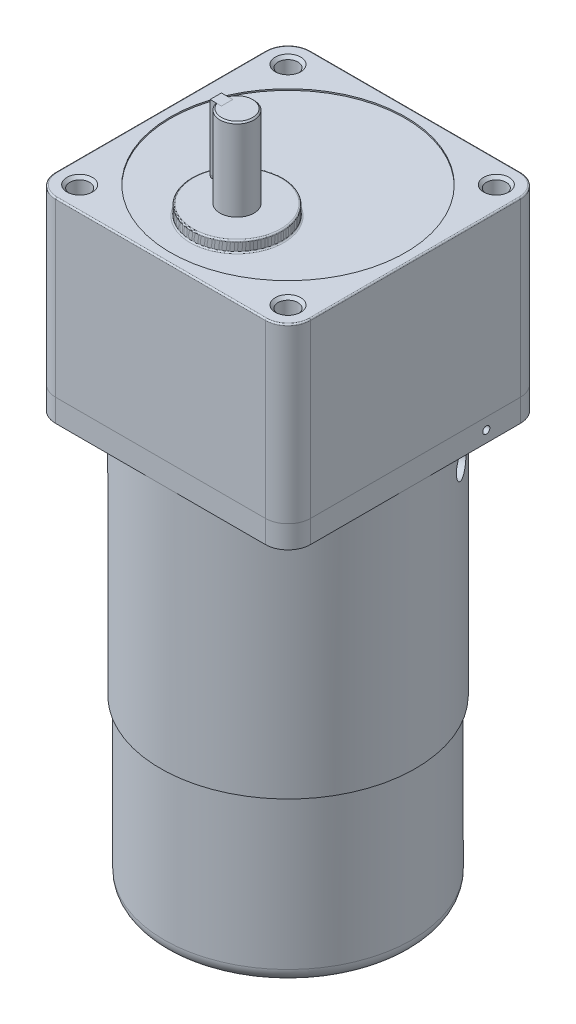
ISO-10303-21;
HEADER;
FILE_DESCRIPTION(('STEP AP214'),'2;1');
FILE_NAME('part.step','',(''),(''),'','','');
FILE_SCHEMA(('AUTOMOTIVE_DESIGN { 1 0 10303 214 1 1 1 1 }'));
ENDSEC;
DATA;
#1=APPLICATION_CONTEXT('core data for automotive mechanical design processes');
#2=APPLICATION_PROTOCOL_DEFINITION('international standard','automotive_design',2000,#1);
#3=PRODUCT_CONTEXT('',#1,'mechanical');
#4=PRODUCT('Part','Part','',(#3));
#5=PRODUCT_RELATED_PRODUCT_CATEGORY('part','',(#4));
#6=PRODUCT_DEFINITION_FORMATION('','',#4);
#7=PRODUCT_DEFINITION_CONTEXT('part definition',#1,'design');
#8=PRODUCT_DEFINITION('design','',#6,#7);
#9=PRODUCT_DEFINITION_SHAPE('','',#8);
#10=(LENGTH_UNIT() NAMED_UNIT(*) SI_UNIT(.MILLI.,.METRE.));
#11=(NAMED_UNIT(*) PLANE_ANGLE_UNIT() SI_UNIT($,.RADIAN.));
#12=(NAMED_UNIT(*) SI_UNIT($,.STERADIAN.) SOLID_ANGLE_UNIT());
#13=UNCERTAINTY_MEASURE_WITH_UNIT(LENGTH_MEASURE(1.E-05),#10,'distance_accuracy_value','');
#14=(GEOMETRIC_REPRESENTATION_CONTEXT(3) GLOBAL_UNCERTAINTY_ASSIGNED_CONTEXT((#13)) GLOBAL_UNIT_ASSIGNED_CONTEXT((#10,
#11,#12)) REPRESENTATION_CONTEXT('',''));
#15=CARTESIAN_POINT('',(0.,0.,0.));
#16=DIRECTION('',(0.,0.,1.));
#17=DIRECTION('',(1.,0.,0.));
#18=AXIS2_PLACEMENT_3D('',#15,#16,#17);
#19=CARTESIAN_POINT('',(-33.691,139.408691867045,18.0000000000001));
#20=DIRECTION('',(1.,0.,0.));
#21=DIRECTION('',(0.,0.,-1.));
#22=AXIS2_PLACEMENT_3D('',#19,#20,#21);
#23=CYLINDRICAL_SURFACE('',#22,2.);
#24=CARTESIAN_POINT('',(-29.691,139.408691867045,18.0000000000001));
#25=DIRECTION('',(-1.,0.,0.));
#26=DIRECTION('',(0.,0.,1.));
#27=AXIS2_PLACEMENT_3D('',#24,#25,#26);
#28=CIRCLE('',#27,2.);
#29=CARTESIAN_POINT('',(-29.691,139.408691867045,16.0000000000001));
#30=VERTEX_POINT('',#29);
#31=CARTESIAN_POINT('',(-29.691,139.408691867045,20.0000000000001));
#32=VERTEX_POINT('',#31);
#33=EDGE_CURVE('P0_E106',#30,#32,#28,.T.);
#34=ORIENTED_EDGE('',*,*,#33,.T.);
#35=DIRECTION('',(1.,0.,0.));
#36=VECTOR('',#35,1.);
#37=CARTESIAN_POINT('',(-33.691,139.408691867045,20.0000000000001));
#38=LINE('',#37,#36);
#39=CARTESIAN_POINT('',(-33.691,139.408691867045,20.0000000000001));
#40=VERTEX_POINT('',#39);
#41=EDGE_CURVE('P0_E12',#40,#32,#38,.T.);
#42=ORIENTED_EDGE('',*,*,#41,.F.);
#43=CARTESIAN_POINT('',(-33.691,139.408691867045,18.0000000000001));
#44=DIRECTION('',(-1.,0.,0.));
#45=DIRECTION('',(0.,0.,1.));
#46=AXIS2_PLACEMENT_3D('',#43,#44,#45);
#47=CIRCLE('',#46,2.);
#48=CARTESIAN_POINT('',(-33.691,139.408691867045,16.0000000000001));
#49=VERTEX_POINT('',#48);
#50=EDGE_CURVE('P0_E94',#49,#40,#47,.T.);
#51=ORIENTED_EDGE('',*,*,#50,.F.);
#52=DIRECTION('',(1.,0.,0.));
#53=VECTOR('',#52,1.);
#54=CARTESIAN_POINT('',(-33.691,139.408691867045,16.0000000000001));
#55=LINE('',#54,#53);
#56=EDGE_CURVE('P0_E102',#49,#30,#55,.T.);
#57=ORIENTED_EDGE('',*,*,#56,.T.);
#58=EDGE_LOOP('',(#34,#42,#51,#57));
#59=FACE_BOUND('',#58,.T.);
#60=ADVANCED_FACE('P0_F43',(#59),#23,.T.);
#61=CARTESIAN_POINT('',(-33.691,162.408691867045,20.0000000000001));
#62=DIRECTION('',(0.,0.,-1.));
#63=DIRECTION('',(-1.,0.,0.));
#64=AXIS2_PLACEMENT_3D('',#61,#62,#63);
#65=PLANE('',#64);
#66=DIRECTION('',(0.,1.,0.));
#67=VECTOR('',#66,1.);
#68=CARTESIAN_POINT('',(-29.691,162.408691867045,20.0000000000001));
#69=LINE('',#68,#67);
#70=CARTESIAN_POINT('',(-29.691,162.408691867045,20.0000000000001));
#71=VERTEX_POINT('',#70);
#72=EDGE_CURVE('P0_E98',#32,#71,#69,.T.);
#73=ORIENTED_EDGE('',*,*,#72,.T.);
#74=DIRECTION('',(1.,0.,0.));
#75=VECTOR('',#74,1.);
#76=CARTESIAN_POINT('',(-33.691,162.408691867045,20.0000000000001));
#77=LINE('',#76,#75);
#78=CARTESIAN_POINT('',(-33.691,162.408691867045,20.0000000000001));
#79=VERTEX_POINT('',#78);
#80=EDGE_CURVE('P0_E51',#79,#71,#77,.T.);
#81=ORIENTED_EDGE('',*,*,#80,.F.);
#82=DIRECTION('',(0.,1.,0.));
#83=VECTOR('',#82,1.);
#84=CARTESIAN_POINT('',(-33.691,162.408691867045,20.0000000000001));
#85=LINE('',#84,#83);
#86=EDGE_CURVE('P0_E89',#40,#79,#85,.T.);
#87=ORIENTED_EDGE('',*,*,#86,.F.);
#88=ORIENTED_EDGE('',*,*,#41,.T.);
#89=EDGE_LOOP('',(#73,#81,#87,#88));
#90=FACE_BOUND('',#89,.T.);
#91=ADVANCED_FACE('P0_F97',(#90),#65,.F.);
#92=CARTESIAN_POINT('',(-33.691,162.408691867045,16.0000000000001));
#93=DIRECTION('',(0.,-1.,0.));
#94=DIRECTION('',(0.,0.,-1.));
#95=AXIS2_PLACEMENT_3D('',#92,#93,#94);
#96=PLANE('',#95);
#97=DIRECTION('',(0.,0.,-1.));
#98=VECTOR('',#97,1.);
#99=CARTESIAN_POINT('',(-29.691,162.408691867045,16.0000000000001));
#100=LINE('',#99,#98);
#101=CARTESIAN_POINT('',(-29.691,162.408691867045,16.0000000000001));
#102=VERTEX_POINT('',#101);
#103=EDGE_CURVE('P0_E76',#71,#102,#100,.T.);
#104=ORIENTED_EDGE('',*,*,#103,.T.);
#105=DIRECTION('',(1.,0.,0.));
#106=VECTOR('',#105,1.);
#107=CARTESIAN_POINT('',(-33.691,162.408691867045,16.0000000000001));
#108=LINE('',#107,#106);
#109=CARTESIAN_POINT('',(-33.691,162.408691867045,16.0000000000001));
#110=VERTEX_POINT('',#109);
#111=EDGE_CURVE('P0_E99',#110,#102,#108,.T.);
#112=ORIENTED_EDGE('',*,*,#111,.F.);
#113=DIRECTION('',(0.,0.,-1.));
#114=VECTOR('',#113,1.);
#115=CARTESIAN_POINT('',(-33.691,162.408691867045,16.0000000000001));
#116=LINE('',#115,#114);
#117=EDGE_CURVE('P0_E92',#79,#110,#116,.T.);
#118=ORIENTED_EDGE('',*,*,#117,.F.);
#119=ORIENTED_EDGE('',*,*,#80,.T.);
#120=EDGE_LOOP('',(#104,#112,#118,#119));
#121=FACE_BOUND('',#120,.T.);
#122=ADVANCED_FACE('P0_F100',(#121),#96,.F.);
#123=CARTESIAN_POINT('',(-33.691,139.408691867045,16.0000000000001));
#124=DIRECTION('',(0.,0.,1.));
#125=DIRECTION('',(1.,0.,0.));
#126=AXIS2_PLACEMENT_3D('',#123,#124,#125);
#127=PLANE('',#126);
#128=DIRECTION('',(0.,-1.,0.));
#129=VECTOR('',#128,1.);
#130=CARTESIAN_POINT('',(-29.691,139.408691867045,16.0000000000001));
#131=LINE('',#130,#129);
#132=EDGE_CURVE('P0_E82',#102,#30,#131,.T.);
#133=ORIENTED_EDGE('',*,*,#132,.T.);
#134=ORIENTED_EDGE('',*,*,#56,.F.);
#135=DIRECTION('',(0.,-1.,0.));
#136=VECTOR('',#135,1.);
#137=CARTESIAN_POINT('',(-33.691,139.408691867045,16.0000000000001));
#138=LINE('',#137,#136);
#139=EDGE_CURVE('P0_E59',#110,#49,#138,.T.);
#140=ORIENTED_EDGE('',*,*,#139,.F.);
#141=ORIENTED_EDGE('',*,*,#111,.T.);
#142=EDGE_LOOP('',(#133,#134,#140,#141));
#143=FACE_BOUND('',#142,.T.);
#144=ADVANCED_FACE('P0_F113',(#143),#127,.F.);
#145=CARTESIAN_POINT('',(-33.691,139.408691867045,18.0000000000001));
#146=DIRECTION('',(-1.,0.,0.));
#147=DIRECTION('',(0.,0.,1.));
#148=AXIS2_PLACEMENT_3D('',#145,#146,#147);
#149=PLANE('',#148);
#150=ORIENTED_EDGE('',*,*,#50,.T.);
#151=ORIENTED_EDGE('',*,*,#86,.T.);
#152=ORIENTED_EDGE('',*,*,#117,.T.);
#153=ORIENTED_EDGE('',*,*,#139,.T.);
#154=EDGE_LOOP('',(#150,#151,#152,#153));
#155=FACE_BOUND('',#154,.T.);
#156=ADVANCED_FACE('P0_F90',(#155),#149,.T.);
#157=CARTESIAN_POINT('',(-29.691,139.408691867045,18.0000000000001));
#158=DIRECTION('',(-1.,0.,0.));
#159=DIRECTION('',(0.,0.,1.));
#160=AXIS2_PLACEMENT_3D('',#157,#158,#159);
#161=PLANE('',#160);
#162=ORIENTED_EDGE('',*,*,#33,.F.);
#163=ORIENTED_EDGE('',*,*,#132,.F.);
#164=ORIENTED_EDGE('',*,*,#103,.F.);
#165=ORIENTED_EDGE('',*,*,#72,.F.);
#166=EDGE_LOOP('',(#162,#163,#164,#165));
#167=FACE_BOUND('',#166,.T.);
#168=ADVANCED_FACE('P0_F116',(#167),#161,.F.);
#169=CLOSED_SHELL('',(#60,#91,#122,#144,#156,#168));
#170=MANIFOLD_SOLID_BREP('P0_B2',#169);
#171=CARTESIAN_POINT('',(-26.1827694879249,162.408691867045,18.0000000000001));
#172=DIRECTION('',(0.,-1.,0.));
#173=DIRECTION('',(1.,0.,0.));
#174=AXIS2_PLACEMENT_3D('',#171,#172,#173);
#175=CYLINDRICAL_SURFACE('',#174,6.);
#176=CARTESIAN_POINT('',(-26.1827694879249,133.408691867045,18.0000000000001));
#177=DIRECTION('',(0.,1.,0.));
#178=DIRECTION('',(-1.,0.,0.));
#179=AXIS2_PLACEMENT_3D('',#176,#177,#178);
#180=CIRCLE('',#179,6.);
#181=CARTESIAN_POINT('',(-32.1827694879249,133.408691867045,18.0000000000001));
#182=VERTEX_POINT('',#181);
#183=EDGE_CURVE('P0_E247',#182,#182,#180,.T.);
#184=ORIENTED_EDGE('',*,*,#183,.T.);
#185=EDGE_LOOP('',(#184));
#186=FACE_BOUND('',#185,.T.);
#187=DIRECTION('',(0.,-1.,0.));
#188=VECTOR('',#187,1.);
#189=CARTESIAN_POINT('',(-31.8396237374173,162.408691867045,16.0000000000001));
#190=LINE('',#189,#188);
#191=CARTESIAN_POINT('',(-31.8396237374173,161.908691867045,16.0000000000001));
#192=VERTEX_POINT('',#191);
#193=CARTESIAN_POINT('',(-31.8396237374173,139.408691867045,16.0000000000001));
#194=VERTEX_POINT('',#193);
#195=EDGE_CURVE('P0_E237',#192,#194,#190,.T.);
#196=ORIENTED_EDGE('',*,*,#195,.F.);
#197=CARTESIAN_POINT('',(-26.1827694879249,161.908691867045,18.0000000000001));
#198=DIRECTION('',(0.,1.,0.));
#199=DIRECTION('',(0.,0.,1.));
#200=AXIS2_PLACEMENT_3D('',#197,#198,#199);
#201=CIRCLE('',#200,6.);
#202=CARTESIAN_POINT('',(-31.8396237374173,161.908691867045,20.0000000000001));
#203=VERTEX_POINT('',#202);
#204=EDGE_CURVE('P0_E180',#192,#203,#201,.F.);
#205=ORIENTED_EDGE('',*,*,#204,.T.);
#206=DIRECTION('',(0.,-1.,0.));
#207=VECTOR('',#206,1.);
#208=CARTESIAN_POINT('',(-31.8396237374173,162.408691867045,20.0000000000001));
#209=LINE('',#208,#207);
#210=CARTESIAN_POINT('',(-31.8396237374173,139.408691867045,20.0000000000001));
#211=VERTEX_POINT('',#210);
#212=EDGE_CURVE('P0_E238',#211,#203,#209,.F.);
#213=ORIENTED_EDGE('',*,*,#212,.F.);
#214=CARTESIAN_POINT('',(-31.8396237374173,139.408691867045,16.0000000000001));
#215=CARTESIAN_POINT('',(-31.8396183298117,139.354110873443,15.9999985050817));
#216=CARTESIAN_POINT('',(-31.8404146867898,139.299557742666,16.0022357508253));
#217=CARTESIAN_POINT('',(-31.8435560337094,139.190874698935,16.0111487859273));
#218=CARTESIAN_POINT('',(-31.8459006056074,139.136744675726,16.0178233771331));
#219=CARTESIAN_POINT('',(-31.855151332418,138.975907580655,16.0443786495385));
#220=CARTESIAN_POINT('',(-31.8642753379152,138.870330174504,16.0707915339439));
#221=CARTESIAN_POINT('',(-31.8873309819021,138.665441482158,16.1400831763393));
#222=CARTESIAN_POINT('',(-31.9012599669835,138.566126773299,16.1829528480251));
#223=CARTESIAN_POINT('',(-31.9323452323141,138.376012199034,16.2838535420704));
#224=CARTESIAN_POINT('',(-31.9495034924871,138.28521760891,16.3418938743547));
#225=CARTESIAN_POINT('',(-31.9858590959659,138.111251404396,16.4738972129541));
#226=CARTESIAN_POINT('',(-32.0051070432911,138.02846210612,16.548350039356));
#227=CARTESIAN_POINT('',(-32.0430464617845,137.876279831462,16.7100231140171));
#228=CARTESIAN_POINT('',(-32.061737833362,137.806889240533,16.7972456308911));
#229=CARTESIAN_POINT('',(-32.0970471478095,137.681732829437,16.9847927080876));
#230=CARTESIAN_POINT('',(-32.113598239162,137.626369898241,17.0853998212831));
#231=CARTESIAN_POINT('',(-32.1421616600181,137.533507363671,17.2951415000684));
#232=CARTESIAN_POINT('',(-32.1541753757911,137.496002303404,17.4042734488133));
#233=CARTESIAN_POINT('',(-32.1719509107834,137.441220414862,17.623941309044));
#234=CARTESIAN_POINT('',(-32.1779156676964,137.423285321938,17.7342963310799));
#235=CARTESIAN_POINT('',(-32.1836416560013,137.406059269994,17.9566020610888));
#236=CARTESIAN_POINT('',(-32.183404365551,137.406763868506,18.0685523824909));
#237=CARTESIAN_POINT('',(-32.1768902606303,137.426380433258,18.2862076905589));
#238=CARTESIAN_POINT('',(-32.1708507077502,137.444577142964,18.3919854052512));
#239=CARTESIAN_POINT('',(-32.1537086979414,137.497478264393,18.5988881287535));
#240=CARTESIAN_POINT('',(-32.1426059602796,137.532183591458,18.7000128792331));
#241=CARTESIAN_POINT('',(-32.116282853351,137.617534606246,18.8963052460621));
#242=CARTESIAN_POINT('',(-32.1010102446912,137.66838395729,18.9913770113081));
#243=CARTESIAN_POINT('',(-32.0679372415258,137.784411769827,19.1718491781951));
#244=CARTESIAN_POINT('',(-32.0501361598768,137.849594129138,19.2572469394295));
#245=CARTESIAN_POINT('',(-32.0128949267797,137.996033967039,19.4201946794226));
#246=CARTESIAN_POINT('',(-31.9934170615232,138.077902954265,19.4971872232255));
#247=CARTESIAN_POINT('',(-31.955719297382,138.253574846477,19.6365440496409));
#248=CARTESIAN_POINT('',(-31.93749980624,138.347381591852,19.6989036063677));
#249=CARTESIAN_POINT('',(-31.9041701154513,138.546052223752,19.8080066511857));
#250=CARTESIAN_POINT('',(-31.8891097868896,138.651058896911,19.8545060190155));
#251=CARTESIAN_POINT('',(-31.8643914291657,138.867985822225,19.9289204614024));
#252=CARTESIAN_POINT('',(-31.8547248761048,138.979894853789,19.9568648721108));
#253=CARTESIAN_POINT('',(-31.8455003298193,139.145529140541,19.9833163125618));
#254=CARTESIAN_POINT('',(-31.843302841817,139.197974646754,19.9895701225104));
#255=CARTESIAN_POINT('',(-31.8403635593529,139.303168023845,19.9979092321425));
#256=CARTESIAN_POINT('',(-31.8396198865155,139.355915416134,19.9999999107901));
#257=CARTESIAN_POINT('',(-31.8396237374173,139.408691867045,20.0000000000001));
#258=B_SPLINE_CURVE_WITH_KNOTS('',3,(#214,#215,#216,#217,#218,#219,#220,#221,#222,#223,#224,
#225,#226,#227,#228,#229,#230,#231,#232,#233,#234,#235,#236,#237,#238,#239,#240,#241,#242,#243,
#244,#245,#246,#247,#248,#249,#250,#251,#252,#253,#254,#255,#256,#257),.UNSPECIFIED.,.F.,.F.,(4,
2,2,2,2,2,2,2,2,2,2,2,2,2,2,2,2,2,2,2,2,4),(0.,0.163636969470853,0.327229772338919,
0.653162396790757,0.978915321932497,1.30486862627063,1.64233009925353,1.97985159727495,
2.32618265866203,2.67240782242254,3.00658941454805,3.34069136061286,3.66168836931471,
3.98270317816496,4.30794037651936,4.63326613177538,4.97388108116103,5.31460588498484,
5.66036059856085,6.0055673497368,6.16399790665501,6.32222363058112),.UNSPECIFIED.);
#259=EDGE_CURVE('P0_E259',#194,#211,#258,.T.);
#260=ORIENTED_EDGE('',*,*,#259,.F.);
#261=EDGE_LOOP('',(#196,#205,#213,#260));
#262=FACE_BOUND('',#261,.T.);
#263=ADVANCED_FACE('P0_F167',(#186,#262),#175,.T.);
#264=CARTESIAN_POINT('',(-26.1827694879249,162.408691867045,18.0000000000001));
#265=DIRECTION('',(0.,1.,0.));
#266=DIRECTION('',(-1.,0.,0.));
#267=AXIS2_PLACEMENT_3D('',#264,#265,#266);
#268=PLANE('',#267);
#269=DIRECTION('',(-1.,0.,0.));
#270=VECTOR('',#269,1.);
#271=CARTESIAN_POINT('',(-29.691,162.408691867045,20.0000000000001));
#272=LINE('',#271,#270);
#273=CARTESIAN_POINT('',(-29.691,162.408691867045,20.0000000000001));
#274=VERTEX_POINT('',#273);
#275=CARTESIAN_POINT('',(-31.3062448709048,162.408691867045,20.0000000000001));
#276=VERTEX_POINT('',#275);
#277=EDGE_CURVE('P0_E242',#274,#276,#272,.T.);
#278=ORIENTED_EDGE('',*,*,#277,.T.);
#279=CARTESIAN_POINT('',(-26.1827694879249,162.408691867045,18.0000000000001));
#280=DIRECTION('',(0.,1.,0.));
#281=DIRECTION('',(-1.,0.,0.));
#282=AXIS2_PLACEMENT_3D('',#279,#280,#281);
#283=CIRCLE('',#282,5.50000000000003);
#284=CARTESIAN_POINT('',(-31.3062448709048,162.408691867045,16.0000000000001));
#285=VERTEX_POINT('',#284);
#286=EDGE_CURVE('P0_E266',#276,#285,#283,.T.);
#287=ORIENTED_EDGE('',*,*,#286,.T.);
#288=DIRECTION('',(-1.,0.,0.));
#289=VECTOR('',#288,1.);
#290=CARTESIAN_POINT('',(-29.691,162.408691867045,16.0000000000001));
#291=LINE('',#290,#289);
#292=CARTESIAN_POINT('',(-29.691,162.408691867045,16.0000000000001));
#293=VERTEX_POINT('',#292);
#294=EDGE_CURVE('P0_E239',#293,#285,#291,.T.);
#295=ORIENTED_EDGE('',*,*,#294,.F.);
#296=DIRECTION('',(0.,0.,1.));
#297=VECTOR('',#296,1.);
#298=CARTESIAN_POINT('',(-29.691,162.408691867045,16.0000000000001));
#299=LINE('',#298,#297);
#300=EDGE_CURVE('P0_E223',#293,#274,#299,.T.);
#301=ORIENTED_EDGE('',*,*,#300,.T.);
#302=EDGE_LOOP('',(#278,#287,#295,#301));
#303=FACE_BOUND('',#302,.T.);
#304=ADVANCED_FACE('P0_F276',(#303),#268,.T.);
#305=CARTESIAN_POINT('',(-26.1827694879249,133.408691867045,18.0000000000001));
#306=DIRECTION('',(0.,1.,0.));
#307=DIRECTION('',(-1.,0.,0.));
#308=AXIS2_PLACEMENT_3D('',#305,#306,#307);
#309=PLANE('',#308);
#310=CARTESIAN_POINT('',(-26.1827694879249,133.408691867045,18.0000000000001));
#311=DIRECTION('',(0.,1.,0.));
#312=DIRECTION('',(-1.,0.,0.));
#313=AXIS2_PLACEMENT_3D('',#310,#311,#312);
#314=CIRCLE('',#313,15.5);
#315=CARTESIAN_POINT('',(-41.6827694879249,133.408691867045,18.0000000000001));
#316=VERTEX_POINT('',#315);
#317=EDGE_CURVE('P0_E253',#316,#316,#314,.T.);
#318=ORIENTED_EDGE('',*,*,#317,.T.);
#319=EDGE_LOOP('',(#318));
#320=FACE_BOUND('',#319,.T.);
#321=ORIENTED_EDGE('',*,*,#183,.F.);
#322=EDGE_LOOP('',(#321));
#323=FACE_BOUND('',#322,.T.);
#324=ADVANCED_FACE('P0_F278',(#320,#323),#309,.T.);
#325=CARTESIAN_POINT('',(-26.1827694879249,133.408691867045,18.0000000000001));
#326=DIRECTION('',(0.,-1.,0.));
#327=DIRECTION('',(1.,0.,0.));
#328=AXIS2_PLACEMENT_3D('',#325,#326,#327);
#329=CYLINDRICAL_SURFACE('',#328,16.);
#330=CARTESIAN_POINT('',(-26.1827694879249,132.908691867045,18.0000000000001));
#331=DIRECTION('',(0.,1.,0.));
#332=DIRECTION('',(-1.,0.,0.));
#333=AXIS2_PLACEMENT_3D('',#330,#331,#332);
#334=CIRCLE('',#333,16.);
#335=CARTESIAN_POINT('',(-10.1827694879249,132.908691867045,18.0000000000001));
#336=VERTEX_POINT('',#335);
#337=EDGE_CURVE('P0_E256',#336,#336,#334,.F.);
#338=CARTESIAN_POINT('',(-26.1827694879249,129.608691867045,18.0000000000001));
#339=DIRECTION('',(0.,1.,0.));
#340=DIRECTION('',(-1.,0.,0.));
#341=AXIS2_PLACEMENT_3D('',#338,#339,#340);
#342=CIRCLE('',#341,16.);
#343=CARTESIAN_POINT('',(-10.1827694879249,129.608691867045,18.0000000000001));
#344=VERTEX_POINT('',#343);
#345=EDGE_CURVE('P0_E250',#344,#344,#342,.T.);
#346=CARTESIAN_POINT('',(-10.1827694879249,132.908691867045,18.0000000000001));
#347=CARTESIAN_POINT('',(-10.1827694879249,132.874316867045,18.0000000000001));
#348=CARTESIAN_POINT('',(-10.1827694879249,132.839941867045,18.0000000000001));
#349=CARTESIAN_POINT('',(-10.1827694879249,132.771191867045,18.0000000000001));
#350=CARTESIAN_POINT('',(-10.1827694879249,132.736816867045,18.0000000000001));
#351=CARTESIAN_POINT('',(-10.1827694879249,132.668066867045,18.0000000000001));
#352=CARTESIAN_POINT('',(-10.1827694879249,132.633691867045,18.0000000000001));
#353=CARTESIAN_POINT('',(-10.1827694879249,132.564941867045,18.0000000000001));
#354=CARTESIAN_POINT('',(-10.1827694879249,132.530566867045,18.0000000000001));
#355=CARTESIAN_POINT('',(-10.1827694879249,132.461816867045,18.0000000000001));
#356=CARTESIAN_POINT('',(-10.1827694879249,132.427441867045,18.0000000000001));
#357=CARTESIAN_POINT('',(-10.1827694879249,132.358691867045,18.0000000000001));
#358=CARTESIAN_POINT('',(-10.1827694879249,132.324316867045,18.0000000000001));
#359=CARTESIAN_POINT('',(-10.1827694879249,132.255566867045,18.0000000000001));
#360=CARTESIAN_POINT('',(-10.1827694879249,132.221191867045,18.0000000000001));
#361=CARTESIAN_POINT('',(-10.1827694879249,132.152441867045,18.0000000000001));
#362=CARTESIAN_POINT('',(-10.1827694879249,132.118066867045,18.0000000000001));
#363=CARTESIAN_POINT('',(-10.1827694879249,132.049316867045,18.0000000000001));
#364=CARTESIAN_POINT('',(-10.1827694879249,132.014941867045,18.0000000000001));
#365=CARTESIAN_POINT('',(-10.1827694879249,131.946191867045,18.0000000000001));
#366=CARTESIAN_POINT('',(-10.1827694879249,131.911816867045,18.0000000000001));
#367=CARTESIAN_POINT('',(-10.1827694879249,131.843066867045,18.0000000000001));
#368=CARTESIAN_POINT('',(-10.1827694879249,131.808691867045,18.0000000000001));
#369=CARTESIAN_POINT('',(-10.1827694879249,131.739941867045,18.0000000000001));
#370=CARTESIAN_POINT('',(-10.1827694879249,131.705566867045,18.0000000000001));
#371=CARTESIAN_POINT('',(-10.1827694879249,131.636816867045,18.0000000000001));
#372=CARTESIAN_POINT('',(-10.1827694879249,131.602441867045,18.0000000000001));
#373=CARTESIAN_POINT('',(-10.1827694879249,131.533691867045,18.0000000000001));
#374=CARTESIAN_POINT('',(-10.1827694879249,131.499316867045,18.0000000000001));
#375=CARTESIAN_POINT('',(-10.1827694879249,131.430566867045,18.0000000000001));
#376=CARTESIAN_POINT('',(-10.1827694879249,131.396191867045,18.0000000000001));
#377=CARTESIAN_POINT('',(-10.1827694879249,131.327441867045,18.0000000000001));
#378=CARTESIAN_POINT('',(-10.1827694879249,131.293066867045,18.0000000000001));
#379=CARTESIAN_POINT('',(-10.1827694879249,131.224316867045,18.0000000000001));
#380=CARTESIAN_POINT('',(-10.1827694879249,131.189941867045,18.0000000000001));
#381=CARTESIAN_POINT('',(-10.1827694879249,131.121191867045,18.0000000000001));
#382=CARTESIAN_POINT('',(-10.1827694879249,131.086816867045,18.0000000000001));
#383=CARTESIAN_POINT('',(-10.1827694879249,131.018066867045,18.0000000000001));
#384=CARTESIAN_POINT('',(-10.1827694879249,130.983691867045,18.0000000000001));
#385=CARTESIAN_POINT('',(-10.1827694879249,130.914941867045,18.0000000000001));
#386=CARTESIAN_POINT('',(-10.1827694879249,130.880566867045,18.0000000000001));
#387=CARTESIAN_POINT('',(-10.1827694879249,130.811816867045,18.0000000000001));
#388=CARTESIAN_POINT('',(-10.1827694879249,130.777441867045,18.0000000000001));
#389=CARTESIAN_POINT('',(-10.1827694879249,130.708691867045,18.0000000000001));
#390=CARTESIAN_POINT('',(-10.1827694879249,130.674316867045,18.0000000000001));
#391=CARTESIAN_POINT('',(-10.1827694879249,130.605566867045,18.0000000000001));
#392=CARTESIAN_POINT('',(-10.1827694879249,130.571191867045,18.0000000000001));
#393=CARTESIAN_POINT('',(-10.1827694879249,130.502441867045,18.0000000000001));
#394=CARTESIAN_POINT('',(-10.1827694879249,130.468066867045,18.0000000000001));
#395=CARTESIAN_POINT('',(-10.1827694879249,130.399316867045,18.0000000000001));
#396=CARTESIAN_POINT('',(-10.1827694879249,130.364941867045,18.0000000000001));
#397=CARTESIAN_POINT('',(-10.1827694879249,130.296191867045,18.0000000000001));
#398=CARTESIAN_POINT('',(-10.1827694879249,130.261816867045,18.0000000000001));
#399=CARTESIAN_POINT('',(-10.1827694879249,130.193066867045,18.0000000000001));
#400=CARTESIAN_POINT('',(-10.1827694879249,130.158691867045,18.0000000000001));
#401=CARTESIAN_POINT('',(-10.1827694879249,130.089941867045,18.0000000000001));
#402=CARTESIAN_POINT('',(-10.1827694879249,130.055566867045,18.0000000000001));
#403=CARTESIAN_POINT('',(-10.1827694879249,129.986816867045,18.0000000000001));
#404=CARTESIAN_POINT('',(-10.1827694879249,129.952441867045,18.0000000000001));
#405=CARTESIAN_POINT('',(-10.1827694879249,129.883691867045,18.0000000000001));
#406=CARTESIAN_POINT('',(-10.1827694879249,129.849316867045,18.0000000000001));
#407=CARTESIAN_POINT('',(-10.1827694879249,129.780566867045,18.0000000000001));
#408=CARTESIAN_POINT('',(-10.1827694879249,129.746191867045,18.0000000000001));
#409=CARTESIAN_POINT('',(-10.1827694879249,129.677441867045,18.0000000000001));
#410=CARTESIAN_POINT('',(-10.1827694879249,129.643066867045,18.0000000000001));
#411=CARTESIAN_POINT('',(-10.1827694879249,129.608691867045,18.0000000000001));
#412=B_SPLINE_CURVE_WITH_KNOTS('',3,(#346,#347,#348,#349,#350,#351,#352,#353,#354,#355,#356,
#357,#358,#359,#360,#361,#362,#363,#364,#365,#366,#367,#368,#369,#370,#371,#372,#373,#374,#375,
#376,#377,#378,#379,#380,#381,#382,#383,#384,#385,#386,#387,#388,#389,#390,#391,#392,#393,#394,
#395,#396,#397,#398,#399,#400,#401,#402,#403,#404,#405,#406,#407,#408,#409,#410,#411),
.UNSPECIFIED.,.F.,.F.,(4,2,2,2,2,2,2,2,2,2,2,2,2,2,2,2,2,2,2,2,2,2,2,2,2,2,2,2,2,2,2,2,4),(0.,
0.103124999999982,0.206249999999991,0.309374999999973,0.412499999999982,0.515624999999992,
0.618749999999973,0.721874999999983,0.824999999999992,0.928124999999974,1.03124999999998,
1.13437499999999,1.23749999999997,1.34062499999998,1.44374999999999,1.54687499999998,
1.64999999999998,1.75312499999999,1.85624999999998,1.95937499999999,2.06249999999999,
2.16562499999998,2.26874999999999,2.371875,2.47499999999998,2.57812499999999,2.68125,
2.78437499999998,2.88749999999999,2.990625,3.09374999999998,3.19687499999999,3.29999999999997),.UNSPECIFIED.);
#413=EDGE_CURVE('P0_BSEAM284',#336,#344,#412,.T.);
#414=ORIENTED_EDGE('',*,*,#337,.T.);
#415=ORIENTED_EDGE('',*,*,#345,.T.);
#416=ORIENTED_EDGE('',*,*,#413,.T.);
#417=ORIENTED_EDGE('',*,*,#413,.F.);
#418=EDGE_LOOP('',(#414,#416,#415,#417));
#419=FACE_BOUND('',#418,.T.);
#420=ADVANCED_FACE('P0_F284',(#419),#329,.T.);
#421=CARTESIAN_POINT('',(-26.1827694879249,129.608691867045,18.0000000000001));
#422=DIRECTION('',(0.,1.,0.));
#423=DIRECTION('',(-1.,0.,0.));
#424=AXIS2_PLACEMENT_3D('',#421,#422,#423);
#425=PLANE('',#424);
#426=ORIENTED_EDGE('',*,*,#345,.F.);
#427=EDGE_LOOP('',(#426));
#428=FACE_BOUND('',#427,.T.);
#429=ADVANCED_FACE('P0_F323',(#428),#425,.F.);
#430=CARTESIAN_POINT('',(-26.1827694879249,132.908691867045,18.0000000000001));
#431=DIRECTION('',(0.,1.,0.));
#432=DIRECTION('',(-1.,0.,0.));
#433=AXIS2_PLACEMENT_3D('',#430,#431,#432);
#434=TOROIDAL_SURFACE('',#433,15.5,0.5);
#435=ORIENTED_EDGE('',*,*,#337,.F.);
#436=EDGE_LOOP('',(#435));
#437=FACE_BOUND('',#436,.T.);
#438=ORIENTED_EDGE('',*,*,#317,.F.);
#439=EDGE_LOOP('',(#438));
#440=FACE_BOUND('',#439,.T.);
#441=ADVANCED_FACE('P0_F274',(#437,#440),#434,.T.);
#442=CARTESIAN_POINT('',(-29.691,139.408691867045,18.0000000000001));
#443=DIRECTION('',(-1.,0.,0.));
#444=DIRECTION('',(0.,0.,1.));
#445=AXIS2_PLACEMENT_3D('',#442,#443,#444);
#446=CYLINDRICAL_SURFACE('',#445,2.);
#447=ORIENTED_EDGE('',*,*,#259,.T.);
#448=DIRECTION('',(-1.,0.,0.));
#449=VECTOR('',#448,1.);
#450=CARTESIAN_POINT('',(-29.691,139.408691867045,20.0000000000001));
#451=LINE('',#450,#449);
#452=CARTESIAN_POINT('',(-29.691,139.408691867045,20.0000000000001));
#453=VERTEX_POINT('',#452);
#454=EDGE_CURVE('P0_E234',#453,#211,#451,.T.);
#455=ORIENTED_EDGE('',*,*,#454,.F.);
#456=CARTESIAN_POINT('',(-29.691,139.408691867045,18.0000000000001));
#457=DIRECTION('',(1.,0.,0.));
#458=DIRECTION('',(0.,0.,-1.));
#459=AXIS2_PLACEMENT_3D('',#456,#457,#458);
#460=CIRCLE('',#459,2.);
#461=CARTESIAN_POINT('',(-29.691,139.408691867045,16.0000000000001));
#462=VERTEX_POINT('',#461);
#463=EDGE_CURVE('P0_E221',#453,#462,#460,.T.);
#464=ORIENTED_EDGE('',*,*,#463,.T.);
#465=DIRECTION('',(-1.,0.,0.));
#466=VECTOR('',#465,1.);
#467=CARTESIAN_POINT('',(-29.691,139.408691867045,16.0000000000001));
#468=LINE('',#467,#466);
#469=EDGE_CURVE('P0_E231',#462,#194,#468,.T.);
#470=ORIENTED_EDGE('',*,*,#469,.T.);
#471=EDGE_LOOP('',(#447,#455,#464,#470));
#472=FACE_BOUND('',#471,.T.);
#473=ADVANCED_FACE('P0_F230',(#472),#446,.F.);
#474=CARTESIAN_POINT('',(-29.691,139.408691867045,16.0000000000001));
#475=DIRECTION('',(0.,0.,1.));
#476=DIRECTION('',(1.,0.,0.));
#477=AXIS2_PLACEMENT_3D('',#474,#475,#476);
#478=PLANE('',#477);
#479=ORIENTED_EDGE('',*,*,#294,.T.);
#480=CARTESIAN_POINT('',(-31.3062448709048,162.408691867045,16.0000000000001));
#481=CARTESIAN_POINT('',(-31.3953907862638,162.325624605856,16.0000000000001));
#482=CARTESIAN_POINT('',(-31.4844119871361,162.242424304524,16.0000000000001));
#483=CARTESIAN_POINT('',(-31.6622049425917,162.075757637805,16.0000000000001));
#484=CARTESIAN_POINT('',(-31.7509766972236,161.992291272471,16.0000000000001));
#485=CARTESIAN_POINT('',(-31.8396237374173,161.908691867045,16.0000000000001));
#486=B_SPLINE_CURVE_WITH_KNOTS('',3,(#480,#481,#482,#483,#484,#485),.UNSPECIFIED.,.F.,.F.,(4,2,
4),(0.,0.365545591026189,0.731091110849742),.UNSPECIFIED.);
#487=EDGE_CURVE('P0_E194',#285,#192,#486,.T.);
#488=ORIENTED_EDGE('',*,*,#487,.T.);
#489=ORIENTED_EDGE('',*,*,#195,.T.);
#490=ORIENTED_EDGE('',*,*,#469,.F.);
#491=DIRECTION('',(0.,1.,0.));
#492=VECTOR('',#491,1.);
#493=CARTESIAN_POINT('',(-29.691,139.408691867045,16.0000000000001));
#494=LINE('',#493,#492);
#495=EDGE_CURVE('P0_E218',#462,#293,#494,.T.);
#496=ORIENTED_EDGE('',*,*,#495,.T.);
#497=EDGE_LOOP('',(#479,#488,#489,#490,#496));
#498=FACE_BOUND('',#497,.T.);
#499=ADVANCED_FACE('P0_F236',(#498),#478,.T.);
#500=CARTESIAN_POINT('',(-29.691,162.408691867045,20.0000000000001));
#501=DIRECTION('',(0.,0.,-1.));
#502=DIRECTION('',(-1.,0.,0.));
#503=AXIS2_PLACEMENT_3D('',#500,#501,#502);
#504=PLANE('',#503);
#505=ORIENTED_EDGE('',*,*,#212,.T.);
#506=CARTESIAN_POINT('',(-31.8396237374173,161.908691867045,20.0000000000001));
#507=CARTESIAN_POINT('',(-31.7509766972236,161.992291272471,20.0000000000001));
#508=CARTESIAN_POINT('',(-31.6622049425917,162.075757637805,20.0000000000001));
#509=CARTESIAN_POINT('',(-31.4844119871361,162.242424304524,20.0000000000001));
#510=CARTESIAN_POINT('',(-31.3953907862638,162.325624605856,20.0000000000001));
#511=CARTESIAN_POINT('',(-31.3062448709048,162.408691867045,20.0000000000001));
#512=B_SPLINE_CURVE_WITH_KNOTS('',3,(#506,#507,#508,#509,#510,#511),.UNSPECIFIED.,.F.,.F.,(4,2,
4),(0.,0.365545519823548,0.731091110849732),.UNSPECIFIED.);
#513=EDGE_CURVE('P0_E41',#203,#276,#512,.T.);
#514=ORIENTED_EDGE('',*,*,#513,.T.);
#515=ORIENTED_EDGE('',*,*,#277,.F.);
#516=DIRECTION('',(0.,-1.,0.));
#517=VECTOR('',#516,1.);
#518=CARTESIAN_POINT('',(-29.691,162.408691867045,20.0000000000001));
#519=LINE('',#518,#517);
#520=EDGE_CURVE('P0_E298',#274,#453,#519,.T.);
#521=ORIENTED_EDGE('',*,*,#520,.T.);
#522=ORIENTED_EDGE('',*,*,#454,.T.);
#523=EDGE_LOOP('',(#505,#514,#515,#521,#522));
#524=FACE_BOUND('',#523,.T.);
#525=ADVANCED_FACE('P0_F297',(#524),#504,.T.);
#526=CARTESIAN_POINT('',(-29.691,139.408691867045,18.0000000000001));
#527=DIRECTION('',(1.,0.,0.));
#528=DIRECTION('',(0.,0.,-1.));
#529=AXIS2_PLACEMENT_3D('',#526,#527,#528);
#530=PLANE('',#529);
#531=ORIENTED_EDGE('',*,*,#463,.F.);
#532=ORIENTED_EDGE('',*,*,#520,.F.);
#533=ORIENTED_EDGE('',*,*,#300,.F.);
#534=ORIENTED_EDGE('',*,*,#495,.F.);
#535=EDGE_LOOP('',(#531,#532,#533,#534));
#536=FACE_BOUND('',#535,.T.);
#537=ADVANCED_FACE('P0_F220',(#536),#530,.F.);
#538=CARTESIAN_POINT('',(-26.1827694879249,162.408691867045,18.0000000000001));
#539=DIRECTION('',(0.,-1.,0.));
#540=DIRECTION('',(0.,0.,-1.));
#541=AXIS2_PLACEMENT_3D('',#538,#539,#540);
#542=CONICAL_SURFACE('',#541,5.50000000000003,0.785398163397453);
#543=ORIENTED_EDGE('',*,*,#513,.F.);
#544=ORIENTED_EDGE('',*,*,#204,.F.);
#545=ORIENTED_EDGE('',*,*,#487,.F.);
#546=ORIENTED_EDGE('',*,*,#286,.F.);
#547=EDGE_LOOP('',(#543,#544,#545,#546));
#548=FACE_BOUND('',#547,.T.);
#549=ADVANCED_FACE('P0_F169',(#548),#542,.T.);
#550=CLOSED_SHELL('',(#263,#304,#324,#420,#429,#441,#473,#499,#525,#537,#549));
#551=MANIFOLD_SOLID_BREP('P0_B6',#550);
#552=CARTESIAN_POINT('',(-26.1827694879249,133.308691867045,18.0000000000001));
#553=DIRECTION('',(0.,-1.,0.));
#554=DIRECTION('',(1.,0.,0.));
#555=AXIS2_PLACEMENT_3D('',#552,#553,#554);
#556=CYLINDRICAL_SURFACE('',#555,7.65);
#557=CARTESIAN_POINT('',(-26.1827694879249,132.508691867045,18.0000000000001));
#558=DIRECTION('',(0.,-1.,0.));
#559=DIRECTION('',(1.,0.,0.));
#560=AXIS2_PLACEMENT_3D('',#557,#558,#559);
#561=CIRCLE('',#560,7.65);
#562=CARTESIAN_POINT('',(-18.5327694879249,132.508691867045,18.0000000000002));
#563=VERTEX_POINT('',#562);
#564=EDGE_CURVE('P1_E11',#563,#563,#561,.T.);
#565=ORIENTED_EDGE('',*,*,#564,.T.);
#566=EDGE_LOOP('',(#565));
#567=FACE_BOUND('',#566,.T.);
#568=CARTESIAN_POINT('',(-26.1827694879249,133.308691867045,18.0000000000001));
#569=DIRECTION('',(0.,-1.,0.));
#570=DIRECTION('',(1.,0.,0.));
#571=AXIS2_PLACEMENT_3D('',#568,#569,#570);
#572=CIRCLE('',#571,7.65);
#573=CARTESIAN_POINT('',(-18.5327694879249,133.308691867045,18.0000000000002));
#574=VERTEX_POINT('',#573);
#575=EDGE_CURVE('P1_E22',#574,#574,#572,.T.);
#576=ORIENTED_EDGE('',*,*,#575,.F.);
#577=EDGE_LOOP('',(#576));
#578=FACE_BOUND('',#577,.T.);
#579=ADVANCED_FACE('P1_F16',(#567,#578),#556,.F.);
#580=CARTESIAN_POINT('',(-26.1827694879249,133.308691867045,18.0000000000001));
#581=DIRECTION('',(0.,1.,0.));
#582=DIRECTION('',(-1.,0.,0.));
#583=AXIS2_PLACEMENT_3D('',#580,#581,#582);
#584=PLANE('',#583);
#585=CARTESIAN_POINT('',(-26.1827694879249,133.308691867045,18.0000000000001));
#586=DIRECTION('',(0.,1.,0.));
#587=DIRECTION('',(-1.,0.,0.));
#588=AXIS2_PLACEMENT_3D('',#585,#586,#587);
#589=CIRCLE('',#588,15.5);
#590=CARTESIAN_POINT('',(-41.6827694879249,133.308691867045,18.0000000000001));
#591=VERTEX_POINT('',#590);
#592=EDGE_CURVE('P1_E287',#591,#591,#589,.T.);
#593=ORIENTED_EDGE('',*,*,#592,.T.);
#594=EDGE_LOOP('',(#593));
#595=FACE_BOUND('',#594,.T.);
#596=ORIENTED_EDGE('',*,*,#575,.T.);
#597=EDGE_LOOP('',(#596));
#598=FACE_BOUND('',#597,.T.);
#599=ADVANCED_FACE('P1_F292',(#595,#598),#584,.T.);
#600=CARTESIAN_POINT('',(-26.1827694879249,132.808691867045,18.0000000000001));
#601=DIRECTION('',(0.,1.,0.));
#602=DIRECTION('',(-1.,0.,0.));
#603=AXIS2_PLACEMENT_3D('',#600,#601,#602);
#604=TOROIDAL_SURFACE('',#603,15.5,0.5);
#605=CARTESIAN_POINT('',(-26.1827694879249,132.808691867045,18.0000000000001));
#606=DIRECTION('',(0.,1.,0.));
#607=DIRECTION('',(-1.,0.,0.));
#608=AXIS2_PLACEMENT_3D('',#605,#606,#607);
#609=CIRCLE('',#608,16.);
#610=CARTESIAN_POINT('',(-42.1827694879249,132.808691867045,18.0000000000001));
#611=VERTEX_POINT('',#610);
#612=EDGE_CURVE('P1_E284',#611,#611,#609,.F.);
#613=ORIENTED_EDGE('',*,*,#612,.F.);
#614=EDGE_LOOP('',(#613));
#615=FACE_BOUND('',#614,.T.);
#616=ORIENTED_EDGE('',*,*,#592,.F.);
#617=EDGE_LOOP('',(#616));
#618=FACE_BOUND('',#617,.T.);
#619=ADVANCED_FACE('P1_F300',(#615,#618),#604,.T.);
#620=CARTESIAN_POINT('',(-26.1827694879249,133.308691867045,18.0000000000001));
#621=DIRECTION('',(0.,-1.,0.));
#622=DIRECTION('',(1.,0.,0.));
#623=AXIS2_PLACEMENT_3D('',#620,#621,#622);
#624=CYLINDRICAL_SURFACE('',#623,16.);
#625=CARTESIAN_POINT('',(-26.1827694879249,130.108691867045,18.0000000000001));
#626=DIRECTION('',(0.,1.,0.));
#627=DIRECTION('',(-1.,0.,0.));
#628=AXIS2_PLACEMENT_3D('',#625,#626,#627);
#629=CIRCLE('',#628,16.);
#630=CARTESIAN_POINT('',(-42.1827694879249,130.108691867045,18.0000000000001));
#631=VERTEX_POINT('',#630);
#632=EDGE_CURVE('P1_E281',#631,#631,#629,.T.);
#633=ORIENTED_EDGE('',*,*,#632,.T.);
#634=EDGE_LOOP('',(#633));
#635=FACE_BOUND('',#634,.T.);
#636=ORIENTED_EDGE('',*,*,#612,.T.);
#637=EDGE_LOOP('',(#636));
#638=FACE_BOUND('',#637,.T.);
#639=ADVANCED_FACE('P1_F306',(#635,#638),#624,.T.);
#640=CARTESIAN_POINT('',(-26.1827694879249,130.108691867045,18.0000000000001));
#641=DIRECTION('',(0.,1.,0.));
#642=DIRECTION('',(-1.,0.,0.));
#643=AXIS2_PLACEMENT_3D('',#640,#641,#642);
#644=TOROIDAL_SURFACE('',#643,16.5,0.5);
#645=CARTESIAN_POINT('',(-26.1827694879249,129.608691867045,18.0000000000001));
#646=DIRECTION('',(0.,1.,0.));
#647=DIRECTION('',(-1.,0.,0.));
#648=AXIS2_PLACEMENT_3D('',#645,#646,#647);
#649=CIRCLE('',#648,16.5);
#650=CARTESIAN_POINT('',(-42.6827694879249,129.608691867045,18.0000000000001));
#651=VERTEX_POINT('',#650);
#652=EDGE_CURVE('P1_E278',#651,#651,#649,.F.);
#653=ORIENTED_EDGE('',*,*,#652,.F.);
#654=EDGE_LOOP('',(#653));
#655=FACE_BOUND('',#654,.T.);
#656=ORIENTED_EDGE('',*,*,#632,.F.);
#657=EDGE_LOOP('',(#656));
#658=FACE_BOUND('',#657,.T.);
#659=ADVANCED_FACE('P1_F312',(#655,#658),#644,.F.);
#660=CARTESIAN_POINT('',(-26.1827694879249,129.608691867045,1.2490009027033E-13));
#661=DIRECTION('',(0.,1.,0.));
#662=DIRECTION('',(-1.,0.,0.));
#663=AXIS2_PLACEMENT_3D('',#660,#661,#662);
#664=PLANE('',#663);
#665=ORIENTED_EDGE('',*,*,#652,.T.);
#666=EDGE_LOOP('',(#665));
#667=FACE_BOUND('',#666,.T.);
#668=CARTESIAN_POINT('',(-26.1827694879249,129.608691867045,1.2490009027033E-13));
#669=DIRECTION('',(0.,1.,0.));
#670=DIRECTION('',(-1.,0.,0.));
#671=AXIS2_PLACEMENT_3D('',#668,#669,#670);
#672=CIRCLE('',#671,41.5);
#673=CARTESIAN_POINT('',(-67.6827694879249,129.608691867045,0.));
#674=VERTEX_POINT('',#673);
#675=EDGE_CURVE('P1_E275',#674,#674,#672,.T.);
#676=ORIENTED_EDGE('',*,*,#675,.T.);
#677=EDGE_LOOP('',(#676));
#678=FACE_BOUND('',#677,.T.);
#679=ADVANCED_FACE('P1_F316',(#667,#678),#664,.T.);
#680=CARTESIAN_POINT('',(-26.1827694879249,129.608691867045,1.2490009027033E-13));
#681=DIRECTION('',(0.,1.,0.));
#682=DIRECTION('',(-1.,0.,0.));
#683=AXIS2_PLACEMENT_3D('',#680,#681,#682);
#684=CYLINDRICAL_SURFACE('',#683,41.5);
#685=ORIENTED_EDGE('',*,*,#675,.F.);
#686=EDGE_LOOP('',(#685));
#687=FACE_BOUND('',#686,.T.);
#688=CARTESIAN_POINT('',(-26.1827694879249,130.108691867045,1.2490009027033E-13));
#689=DIRECTION('',(0.,1.,0.));
#690=DIRECTION('',(-1.,0.,0.));
#691=AXIS2_PLACEMENT_3D('',#688,#689,#690);
#692=CIRCLE('',#691,41.5);
#693=CARTESIAN_POINT('',(-67.6827694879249,130.108691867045,0.));
#694=VERTEX_POINT('',#693);
#695=EDGE_CURVE('P1_E244',#694,#694,#692,.T.);
#696=ORIENTED_EDGE('',*,*,#695,.T.);
#697=EDGE_LOOP('',(#696));
#698=FACE_BOUND('',#697,.T.);
#699=ADVANCED_FACE('P1_F320',(#687,#698),#684,.F.);
#700=CARTESIAN_POINT('',(-62.9523221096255,133.308691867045,36.7695526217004));
#701=DIRECTION('',(0.,-1.,0.));
#702=DIRECTION('',(1.,0.,0.));
#703=AXIS2_PLACEMENT_3D('',#700,#701,#702);
#704=CYLINDRICAL_SURFACE('',#703,3.5);
#705=CARTESIAN_POINT('',(-62.9523221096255,129.108691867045,36.7695526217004));
#706=DIRECTION('',(0.,-1.,0.));
#707=DIRECTION('',(1.,0.,0.));
#708=AXIS2_PLACEMENT_3D('',#705,#706,#707);
#709=CIRCLE('',#708,3.5);
#710=CARTESIAN_POINT('',(-59.4523221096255,129.108691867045,36.7695526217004));
#711=VERTEX_POINT('',#710);
#712=EDGE_CURVE('P1_E268',#711,#711,#709,.F.);
#713=ORIENTED_EDGE('',*,*,#712,.T.);
#714=EDGE_LOOP('',(#713));
#715=FACE_BOUND('',#714,.T.);
#716=CARTESIAN_POINT('',(-62.9523221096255,70.1086918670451,36.7695526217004));
#717=DIRECTION('',(0.,-1.,0.));
#718=DIRECTION('',(1.,0.,0.));
#719=AXIS2_PLACEMENT_3D('',#716,#717,#718);
#720=CIRCLE('',#719,3.5);
#721=CARTESIAN_POINT('',(-59.4523221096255,70.1086918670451,36.7695526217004));
#722=VERTEX_POINT('',#721);
#723=EDGE_CURVE('P1_E271',#722,#722,#720,.T.);
#724=ORIENTED_EDGE('',*,*,#723,.T.);
#725=EDGE_LOOP('',(#724));
#726=FACE_BOUND('',#725,.T.);
#727=ADVANCED_FACE('P1_F324',(#715,#726),#704,.F.);
#728=CARTESIAN_POINT('',(-62.9523221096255,130.108691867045,36.7695526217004));
#729=DIRECTION('',(0.,1.,0.));
#730=DIRECTION('',(-1.,0.,0.));
#731=AXIS2_PLACEMENT_3D('',#728,#729,#730);
#732=CONICAL_SURFACE('',#731,4.50000000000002,0.785398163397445);
#733=ORIENTED_EDGE('',*,*,#712,.F.);
#734=EDGE_LOOP('',(#733));
#735=FACE_BOUND('',#734,.T.);
#736=CARTESIAN_POINT('',(-62.9523221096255,130.108691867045,36.7695526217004));
#737=DIRECTION('',(0.,-1.,0.));
#738=DIRECTION('',(1.,0.,0.));
#739=AXIS2_PLACEMENT_3D('',#736,#737,#738);
#740=CIRCLE('',#739,4.50000000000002);
#741=CARTESIAN_POINT('',(-58.4523221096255,130.108691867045,36.7695526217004));
#742=VERTEX_POINT('',#741);
#743=EDGE_CURVE('P1_E241',#742,#742,#740,.T.);
#744=ORIENTED_EDGE('',*,*,#743,.F.);
#745=EDGE_LOOP('',(#744));
#746=FACE_BOUND('',#745,.T.);
#747=ADVANCED_FACE('P1_F328',(#735,#746),#732,.F.);
#748=CARTESIAN_POINT('',(10.586783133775,133.308691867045,36.7695526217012));
#749=DIRECTION('',(0.,-1.,0.));
#750=DIRECTION('',(1.,0.,0.));
#751=AXIS2_PLACEMENT_3D('',#748,#749,#750);
#752=CYLINDRICAL_SURFACE('',#751,3.5);
#753=CARTESIAN_POINT('',(10.586783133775,129.108691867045,36.7695526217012));
#754=DIRECTION('',(0.,-1.,0.));
#755=DIRECTION('',(1.,0.,0.));
#756=AXIS2_PLACEMENT_3D('',#753,#754,#755);
#757=CIRCLE('',#756,3.5);
#758=CARTESIAN_POINT('',(14.086783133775,129.108691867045,36.7695526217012));
#759=VERTEX_POINT('',#758);
#760=EDGE_CURVE('P1_E261',#759,#759,#757,.F.);
#761=ORIENTED_EDGE('',*,*,#760,.T.);
#762=EDGE_LOOP('',(#761));
#763=FACE_BOUND('',#762,.T.);
#764=CARTESIAN_POINT('',(10.586783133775,70.1086918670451,36.7695526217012));
#765=DIRECTION('',(0.,-1.,0.));
#766=DIRECTION('',(1.,0.,0.));
#767=AXIS2_PLACEMENT_3D('',#764,#765,#766);
#768=CIRCLE('',#767,3.5);
#769=CARTESIAN_POINT('',(14.086783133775,70.1086918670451,36.7695526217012));
#770=VERTEX_POINT('',#769);
#771=EDGE_CURVE('P1_E264',#770,#770,#768,.T.);
#772=ORIENTED_EDGE('',*,*,#771,.T.);
#773=EDGE_LOOP('',(#772));
#774=FACE_BOUND('',#773,.T.);
#775=ADVANCED_FACE('P1_F332',(#763,#774),#752,.F.);
#776=CARTESIAN_POINT('',(10.586783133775,130.108691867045,36.7695526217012));
#777=DIRECTION('',(0.,1.,0.));
#778=DIRECTION('',(-1.,0.,0.));
#779=AXIS2_PLACEMENT_3D('',#776,#777,#778);
#780=CONICAL_SURFACE('',#779,4.50000000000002,0.785398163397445);
#781=ORIENTED_EDGE('',*,*,#760,.F.);
#782=EDGE_LOOP('',(#781));
#783=FACE_BOUND('',#782,.T.);
#784=CARTESIAN_POINT('',(10.586783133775,130.108691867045,36.7695526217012));
#785=DIRECTION('',(0.,-1.,0.));
#786=DIRECTION('',(1.,0.,0.));
#787=AXIS2_PLACEMENT_3D('',#784,#785,#786);
#788=CIRCLE('',#787,4.50000000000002);
#789=CARTESIAN_POINT('',(15.086783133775,130.108691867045,36.7695526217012));
#790=VERTEX_POINT('',#789);
#791=EDGE_CURVE('P1_E238',#790,#790,#788,.T.);
#792=ORIENTED_EDGE('',*,*,#791,.F.);
#793=EDGE_LOOP('',(#792));
#794=FACE_BOUND('',#793,.T.);
#795=ADVANCED_FACE('P1_F336',(#783,#794),#780,.F.);
#796=CARTESIAN_POINT('',(-62.952322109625,133.308691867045,-36.7695526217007));
#797=DIRECTION('',(0.,-1.,0.));
#798=DIRECTION('',(1.,0.,0.));
#799=AXIS2_PLACEMENT_3D('',#796,#797,#798);
#800=CYLINDRICAL_SURFACE('',#799,3.5);
#801=CARTESIAN_POINT('',(-62.952322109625,129.108691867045,-36.7695526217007));
#802=DIRECTION('',(0.,-1.,0.));
#803=DIRECTION('',(1.,0.,0.));
#804=AXIS2_PLACEMENT_3D('',#801,#802,#803);
#805=CIRCLE('',#804,3.5);
#806=CARTESIAN_POINT('',(-59.452322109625,129.108691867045,-36.7695526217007));
#807=VERTEX_POINT('',#806);
#808=EDGE_CURVE('P1_E254',#807,#807,#805,.F.);
#809=ORIENTED_EDGE('',*,*,#808,.T.);
#810=EDGE_LOOP('',(#809));
#811=FACE_BOUND('',#810,.T.);
#812=CARTESIAN_POINT('',(-62.952322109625,70.1086918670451,-36.7695526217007));
#813=DIRECTION('',(0.,-1.,0.));
#814=DIRECTION('',(1.,0.,0.));
#815=AXIS2_PLACEMENT_3D('',#812,#813,#814);
#816=CIRCLE('',#815,3.5);
#817=CARTESIAN_POINT('',(-59.452322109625,70.1086918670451,-36.7695526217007));
#818=VERTEX_POINT('',#817);
#819=EDGE_CURVE('P1_E257',#818,#818,#816,.T.);
#820=ORIENTED_EDGE('',*,*,#819,.T.);
#821=EDGE_LOOP('',(#820));
#822=FACE_BOUND('',#821,.T.);
#823=ADVANCED_FACE('P1_F340',(#811,#822),#800,.F.);
#824=CARTESIAN_POINT('',(-62.952322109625,130.108691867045,-36.7695526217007));
#825=DIRECTION('',(0.,1.,0.));
#826=DIRECTION('',(-1.,0.,0.));
#827=AXIS2_PLACEMENT_3D('',#824,#825,#826);
#828=CONICAL_SURFACE('',#827,4.50000000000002,0.785398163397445);
#829=ORIENTED_EDGE('',*,*,#808,.F.);
#830=EDGE_LOOP('',(#829));
#831=FACE_BOUND('',#830,.T.);
#832=CARTESIAN_POINT('',(-62.952322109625,130.108691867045,-36.7695526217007));
#833=DIRECTION('',(0.,-1.,0.));
#834=DIRECTION('',(1.,0.,0.));
#835=AXIS2_PLACEMENT_3D('',#832,#833,#834);
#836=CIRCLE('',#835,4.50000000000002);
#837=CARTESIAN_POINT('',(-58.452322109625,130.108691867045,-36.7695526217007));
#838=VERTEX_POINT('',#837);
#839=EDGE_CURVE('P1_E235',#838,#838,#836,.T.);
#840=ORIENTED_EDGE('',*,*,#839,.F.);
#841=EDGE_LOOP('',(#840));
#842=FACE_BOUND('',#841,.T.);
#843=ADVANCED_FACE('P1_F344',(#831,#842),#828,.F.);
#844=CARTESIAN_POINT('',(10.5867831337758,133.308691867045,-36.7695526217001));
#845=DIRECTION('',(0.,-1.,0.));
#846=DIRECTION('',(1.,0.,0.));
#847=AXIS2_PLACEMENT_3D('',#844,#845,#846);
#848=CYLINDRICAL_SURFACE('',#847,3.5);
#849=CARTESIAN_POINT('',(10.5867831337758,129.108691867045,-36.7695526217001));
#850=DIRECTION('',(0.,-1.,0.));
#851=DIRECTION('',(1.,0.,0.));
#852=AXIS2_PLACEMENT_3D('',#849,#850,#851);
#853=CIRCLE('',#852,3.5);
#854=CARTESIAN_POINT('',(14.0867831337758,129.108691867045,-36.7695526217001));
#855=VERTEX_POINT('',#854);
#856=EDGE_CURVE('P1_E247',#855,#855,#853,.F.);
#857=ORIENTED_EDGE('',*,*,#856,.T.);
#858=EDGE_LOOP('',(#857));
#859=FACE_BOUND('',#858,.T.);
#860=CARTESIAN_POINT('',(10.5867831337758,70.1086918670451,-36.7695526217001));
#861=DIRECTION('',(0.,-1.,0.));
#862=DIRECTION('',(1.,0.,0.));
#863=AXIS2_PLACEMENT_3D('',#860,#861,#862);
#864=CIRCLE('',#863,3.5);
#865=CARTESIAN_POINT('',(14.0867831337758,70.1086918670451,-36.7695526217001));
#866=VERTEX_POINT('',#865);
#867=EDGE_CURVE('P1_E250',#866,#866,#864,.T.);
#868=ORIENTED_EDGE('',*,*,#867,.T.);
#869=EDGE_LOOP('',(#868));
#870=FACE_BOUND('',#869,.T.);
#871=ADVANCED_FACE('P1_F348',(#859,#870),#848,.F.);
#872=CARTESIAN_POINT('',(10.5867831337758,130.108691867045,-36.7695526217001));
#873=DIRECTION('',(0.,1.,0.));
#874=DIRECTION('',(-1.,0.,0.));
#875=AXIS2_PLACEMENT_3D('',#872,#873,#874);
#876=CONICAL_SURFACE('',#875,4.50000000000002,0.785398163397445);
#877=ORIENTED_EDGE('',*,*,#856,.F.);
#878=EDGE_LOOP('',(#877));
#879=FACE_BOUND('',#878,.T.);
#880=CARTESIAN_POINT('',(10.5867831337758,130.108691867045,-36.7695526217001));
#881=DIRECTION('',(0.,-1.,0.));
#882=DIRECTION('',(1.,0.,0.));
#883=AXIS2_PLACEMENT_3D('',#880,#881,#882);
#884=CIRCLE('',#883,4.50000000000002);
#885=CARTESIAN_POINT('',(15.0867831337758,130.108691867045,-36.7695526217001));
#886=VERTEX_POINT('',#885);
#887=EDGE_CURVE('P1_E232',#886,#886,#884,.T.);
#888=ORIENTED_EDGE('',*,*,#887,.F.);
#889=EDGE_LOOP('',(#888));
#890=FACE_BOUND('',#889,.T.);
#891=ADVANCED_FACE('P1_F352',(#879,#890),#876,.F.);
#892=CARTESIAN_POINT('',(-63.1827694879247,130.108691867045,-37.));
#893=DIRECTION('',(0.,-1.,0.));
#894=DIRECTION('',(1.,0.,0.));
#895=AXIS2_PLACEMENT_3D('',#892,#893,#894);
#896=PLANE('',#895);
#897=ORIENTED_EDGE('',*,*,#887,.T.);
#898=EDGE_LOOP('',(#897));
#899=FACE_BOUND('',#898,.T.);
#900=ORIENTED_EDGE('',*,*,#839,.T.);
#901=EDGE_LOOP('',(#900));
#902=FACE_BOUND('',#901,.T.);
#903=ORIENTED_EDGE('',*,*,#791,.T.);
#904=EDGE_LOOP('',(#903));
#905=FACE_BOUND('',#904,.T.);
#906=ORIENTED_EDGE('',*,*,#743,.T.);
#907=EDGE_LOOP('',(#906));
#908=FACE_BOUND('',#907,.T.);
#909=DIRECTION('',(0.,0.,1.));
#910=VECTOR('',#909,1.);
#911=CARTESIAN_POINT('',(18.3172305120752,130.108691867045,-36.9999999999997));
#912=LINE('',#911,#910);
#913=CARTESIAN_POINT('',(18.317230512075,130.108691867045,37.0000000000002));
#914=VERTEX_POINT('',#913);
#915=CARTESIAN_POINT('',(18.3172305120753,130.108691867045,-36.9999999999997));
#916=VERTEX_POINT('',#915);
#917=EDGE_CURVE('P1_E127',#914,#916,#912,.F.);
#918=ORIENTED_EDGE('',*,*,#917,.T.);
#919=CARTESIAN_POINT('',(10.8172305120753,130.108691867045,-36.9999999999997));
#920=DIRECTION('',(0.,-1.,0.));
#921=DIRECTION('',(1.,0.,0.));
#922=AXIS2_PLACEMENT_3D('',#919,#920,#921);
#923=CIRCLE('',#922,7.5);
#924=CARTESIAN_POINT('',(10.8172305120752,130.108691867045,-44.4999999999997));
#925=VERTEX_POINT('',#924);
#926=EDGE_CURVE('P1_E109',#916,#925,#923,.F.);
#927=ORIENTED_EDGE('',*,*,#926,.T.);
#928=DIRECTION('',(1.,0.,0.));
#929=VECTOR('',#928,1.);
#930=CARTESIAN_POINT('',(-63.1827694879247,130.108691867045,-44.5));
#931=LINE('',#930,#929);
#932=CARTESIAN_POINT('',(-63.1827694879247,130.108691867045,-44.5));
#933=VERTEX_POINT('',#932);
#934=EDGE_CURVE('P1_E124',#925,#933,#931,.F.);
#935=ORIENTED_EDGE('',*,*,#934,.T.);
#936=CARTESIAN_POINT('',(-63.1827694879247,130.108691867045,-37.));
#937=DIRECTION('',(0.,-1.,0.));
#938=DIRECTION('',(1.,0.,0.));
#939=AXIS2_PLACEMENT_3D('',#936,#937,#938);
#940=CIRCLE('',#939,7.5);
#941=CARTESIAN_POINT('',(-70.6827694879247,130.108691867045,-37.));
#942=VERTEX_POINT('',#941);
#943=EDGE_CURVE('P1_E140',#933,#942,#940,.F.);
#944=ORIENTED_EDGE('',*,*,#943,.T.);
#945=DIRECTION('',(0.,0.,-1.));
#946=VECTOR('',#945,1.);
#947=CARTESIAN_POINT('',(-70.6827694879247,130.108691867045,-37.));
#948=LINE('',#947,#946);
#949=CARTESIAN_POINT('',(-70.682769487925,130.108691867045,36.9999999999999));
#950=VERTEX_POINT('',#949);
#951=EDGE_CURVE('P1_E147',#942,#950,#948,.F.);
#952=ORIENTED_EDGE('',*,*,#951,.T.);
#953=CARTESIAN_POINT('',(-63.182769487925,130.108691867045,37.));
#954=DIRECTION('',(0.,-1.,0.));
#955=DIRECTION('',(1.,0.,0.));
#956=AXIS2_PLACEMENT_3D('',#953,#954,#955);
#957=CIRCLE('',#956,7.5);
#958=CARTESIAN_POINT('',(-63.182769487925,130.108691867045,44.5));
#959=VERTEX_POINT('',#958);
#960=EDGE_CURVE('P1_E155',#950,#959,#957,.F.);
#961=ORIENTED_EDGE('',*,*,#960,.T.);
#962=DIRECTION('',(-1.,0.,0.));
#963=VECTOR('',#962,1.);
#964=CARTESIAN_POINT('',(-63.1827694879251,130.108691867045,44.5));
#965=LINE('',#964,#963);
#966=CARTESIAN_POINT('',(10.8172305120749,130.108691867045,44.5000000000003));
#967=VERTEX_POINT('',#966);
#968=EDGE_CURVE('P1_E166',#959,#967,#965,.F.);
#969=ORIENTED_EDGE('',*,*,#968,.T.);
#970=CARTESIAN_POINT('',(10.817230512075,130.108691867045,37.0000000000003));
#971=DIRECTION('',(0.,-1.,0.));
#972=DIRECTION('',(1.,0.,0.));
#973=AXIS2_PLACEMENT_3D('',#970,#971,#972);
#974=CIRCLE('',#973,7.5);
#975=EDGE_CURVE('P1_E230',#967,#914,#974,.F.);
#976=ORIENTED_EDGE('',*,*,#975,.T.);
#977=EDGE_LOOP('',(#918,#927,#935,#944,#952,#961,#969,#976));
#978=FACE_BOUND('',#977,.T.);
#979=ORIENTED_EDGE('',*,*,#695,.F.);
#980=EDGE_LOOP('',(#979));
#981=FACE_BOUND('',#980,.T.);
#982=ADVANCED_FACE('P1_F121',(#899,#902,#905,#908,#978,#981),#896,.F.);
#983=CARTESIAN_POINT('',(10.817230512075,129.608691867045,37.0000000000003));
#984=DIRECTION('',(0.,-1.,0.));
#985=DIRECTION('',(1.,0.,0.));
#986=AXIS2_PLACEMENT_3D('',#983,#984,#985);
#987=TOROIDAL_SURFACE('',#986,7.5,0.5);
#988=CARTESIAN_POINT('',(10.8172305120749,129.608691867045,44.5000000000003));
#989=DIRECTION('',(1.,0.,0.));
#990=DIRECTION('',(0.,1.,0.));
#991=AXIS2_PLACEMENT_3D('',#988,#989,#990);
#992=CIRCLE('',#991,0.5);
#993=CARTESIAN_POINT('',(10.8172305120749,129.608691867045,45.0000000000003));
#994=VERTEX_POINT('',#993);
#995=EDGE_CURVE('P1_E163',#967,#994,#992,.T.);
#996=ORIENTED_EDGE('',*,*,#995,.T.);
#997=CARTESIAN_POINT('',(10.817230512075,129.608691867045,37.0000000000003));
#998=DIRECTION('',(0.,-1.,0.));
#999=DIRECTION('',(1.,0.,0.));
#1000=AXIS2_PLACEMENT_3D('',#997,#998,#999);
#1001=CIRCLE('',#1000,8.);
#1002=CARTESIAN_POINT('',(18.817230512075,129.608691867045,37.0000000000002));
#1003=VERTEX_POINT('',#1002);
#1004=EDGE_CURVE('P1_E181',#1003,#994,#1001,.T.);
#1005=ORIENTED_EDGE('',*,*,#1004,.F.);
#1006=CARTESIAN_POINT('',(18.317230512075,129.608691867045,37.0000000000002));
#1007=DIRECTION('',(0.,0.,-1.));
#1008=DIRECTION('',(1.,0.,0.));
#1009=AXIS2_PLACEMENT_3D('',#1006,#1007,#1008);
#1010=CIRCLE('',#1009,0.5);
#1011=EDGE_CURVE('P1_E29',#914,#1003,#1010,.T.);
#1012=ORIENTED_EDGE('',*,*,#1011,.F.);
#1013=ORIENTED_EDGE('',*,*,#975,.F.);
#1014=EDGE_LOOP('',(#996,#1005,#1012,#1013));
#1015=FACE_BOUND('',#1014,.T.);
#1016=ADVANCED_FACE('P1_F359',(#1015),#987,.T.);
#1017=CARTESIAN_POINT('',(18.3172305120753,129.608691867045,-36.9999999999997));
#1018=DIRECTION('',(0.,0.,1.));
#1019=DIRECTION('',(0.,-1.,0.));
#1020=AXIS2_PLACEMENT_3D('',#1017,#1018,#1019);
#1021=CYLINDRICAL_SURFACE('',#1020,0.5);
#1022=ORIENTED_EDGE('',*,*,#1011,.T.);
#1023=DIRECTION('',(0.,0.,1.));
#1024=VECTOR('',#1023,1.);
#1025=CARTESIAN_POINT('',(18.8172305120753,129.608691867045,-36.9999999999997));
#1026=LINE('',#1025,#1024);
#1027=CARTESIAN_POINT('',(18.8172305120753,129.608691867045,-36.9999999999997));
#1028=VERTEX_POINT('',#1027);
#1029=EDGE_CURVE('P1_E191',#1028,#1003,#1026,.T.);
#1030=ORIENTED_EDGE('',*,*,#1029,.F.);
#1031=CARTESIAN_POINT('',(18.3172305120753,129.608691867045,-36.9999999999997));
#1032=DIRECTION('',(0.,0.,-1.));
#1033=DIRECTION('',(1.,0.,0.));
#1034=AXIS2_PLACEMENT_3D('',#1031,#1032,#1033);
#1035=CIRCLE('',#1034,0.5);
#1036=EDGE_CURVE('P1_E128',#916,#1028,#1035,.T.);
#1037=ORIENTED_EDGE('',*,*,#1036,.F.);
#1038=ORIENTED_EDGE('',*,*,#917,.F.);
#1039=EDGE_LOOP('',(#1022,#1030,#1037,#1038));
#1040=FACE_BOUND('',#1039,.T.);
#1041=ADVANCED_FACE('P1_F363',(#1040),#1021,.T.);
#1042=CARTESIAN_POINT('',(-63.182769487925,69.1086918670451,37.));
#1043=DIRECTION('',(0.,1.,0.));
#1044=DIRECTION('',(-1.,0.,0.));
#1045=AXIS2_PLACEMENT_3D('',#1042,#1043,#1044);
#1046=CYLINDRICAL_SURFACE('',#1045,8.);
#1047=DIRECTION('',(0.,1.,0.));
#1048=VECTOR('',#1047,1.);
#1049=CARTESIAN_POINT('',(-63.182769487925,69.1086918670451,45.));
#1050=LINE('',#1049,#1048);
#1051=CARTESIAN_POINT('',(-63.182769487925,69.1086918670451,45.));
#1052=VERTEX_POINT('',#1051);
#1053=CARTESIAN_POINT('',(-63.182769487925,129.608691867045,45.));
#1054=VERTEX_POINT('',#1053);
#1055=EDGE_CURVE('P1_E172',#1052,#1054,#1050,.T.);
#1056=ORIENTED_EDGE('',*,*,#1055,.T.);
#1057=CARTESIAN_POINT('',(-63.182769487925,129.608691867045,37.));
#1058=DIRECTION('',(0.,-1.,0.));
#1059=DIRECTION('',(1.,0.,0.));
#1060=AXIS2_PLACEMENT_3D('',#1057,#1058,#1059);
#1061=CIRCLE('',#1060,8.);
#1062=CARTESIAN_POINT('',(-71.182769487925,129.608691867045,36.9999999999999));
#1063=VERTEX_POINT('',#1062);
#1064=EDGE_CURVE('P1_E158',#1054,#1063,#1061,.T.);
#1065=ORIENTED_EDGE('',*,*,#1064,.T.);
#1066=DIRECTION('',(0.,1.,0.));
#1067=VECTOR('',#1066,1.);
#1068=CARTESIAN_POINT('',(-71.182769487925,69.1086918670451,36.9999999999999));
#1069=LINE('',#1068,#1067);
#1070=CARTESIAN_POINT('',(-71.182769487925,69.1086918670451,36.9999999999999));
#1071=VERTEX_POINT('',#1070);
#1072=EDGE_CURVE('P1_E37',#1071,#1063,#1069,.T.);
#1073=ORIENTED_EDGE('',*,*,#1072,.F.);
#1074=CARTESIAN_POINT('',(-63.182769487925,69.1086918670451,37.));
#1075=DIRECTION('',(0.,-1.,0.));
#1076=DIRECTION('',(-1.,0.,0.));
#1077=AXIS2_PLACEMENT_3D('',#1074,#1075,#1076);
#1078=CIRCLE('',#1077,8.);
#1079=EDGE_CURVE('P1_E224',#1052,#1071,#1078,.T.);
#1080=ORIENTED_EDGE('',*,*,#1079,.F.);
#1081=EDGE_LOOP('',(#1056,#1065,#1073,#1080));
#1082=FACE_BOUND('',#1081,.T.);
#1083=ADVANCED_FACE('P1_F366',(#1082),#1046,.T.);
#1084=CARTESIAN_POINT('',(-71.1827694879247,69.1086918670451,-37.));
#1085=DIRECTION('',(1.,0.,0.));
#1086=DIRECTION('',(0.,1.,0.));
#1087=AXIS2_PLACEMENT_3D('',#1084,#1085,#1086);
#1088=PLANE('',#1087);
#1089=ORIENTED_EDGE('',*,*,#1072,.T.);
#1090=DIRECTION('',(0.,0.,-1.));
#1091=VECTOR('',#1090,1.);
#1092=CARTESIAN_POINT('',(-71.1827694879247,129.608691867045,-37.));
#1093=LINE('',#1092,#1091);
#1094=CARTESIAN_POINT('',(-71.1827694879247,129.608691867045,-37.));
#1095=VERTEX_POINT('',#1094);
#1096=EDGE_CURVE('P1_E150',#1063,#1095,#1093,.T.);
#1097=ORIENTED_EDGE('',*,*,#1096,.T.);
#1098=DIRECTION('',(0.,1.,0.));
#1099=VECTOR('',#1098,1.);
#1100=CARTESIAN_POINT('',(-71.1827694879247,69.1086918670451,-37.));
#1101=LINE('',#1100,#1099);
#1102=CARTESIAN_POINT('',(-71.1827694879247,69.1086918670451,-37.));
#1103=VERTEX_POINT('',#1102);
#1104=EDGE_CURVE('P1_E212',#1103,#1095,#1101,.T.);
#1105=ORIENTED_EDGE('',*,*,#1104,.F.);
#1106=DIRECTION('',(0.,0.,-1.));
#1107=VECTOR('',#1106,1.);
#1108=CARTESIAN_POINT('',(-71.1827694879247,69.1086918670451,-37.));
#1109=LINE('',#1108,#1107);
#1110=EDGE_CURVE('P1_E220',#1071,#1103,#1109,.T.);
#1111=ORIENTED_EDGE('',*,*,#1110,.F.);
#1112=EDGE_LOOP('',(#1089,#1097,#1105,#1111));
#1113=FACE_BOUND('',#1112,.T.);
#1114=ADVANCED_FACE('P1_F370',(#1113),#1088,.F.);
#1115=CARTESIAN_POINT('',(-63.1827694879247,69.1086918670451,-37.));
#1116=DIRECTION('',(0.,1.,0.));
#1117=DIRECTION('',(-1.,0.,0.));
#1118=AXIS2_PLACEMENT_3D('',#1115,#1116,#1117);
#1119=CYLINDRICAL_SURFACE('',#1118,8.);
#1120=ORIENTED_EDGE('',*,*,#1104,.T.);
#1121=CARTESIAN_POINT('',(-63.1827694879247,129.608691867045,-37.));
#1122=DIRECTION('',(0.,-1.,0.));
#1123=DIRECTION('',(1.,0.,0.));
#1124=AXIS2_PLACEMENT_3D('',#1121,#1122,#1123);
#1125=CIRCLE('',#1124,8.);
#1126=CARTESIAN_POINT('',(-63.1827694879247,129.608691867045,-45.));
#1127=VERTEX_POINT('',#1126);
#1128=EDGE_CURVE('P1_E142',#1095,#1127,#1125,.T.);
#1129=ORIENTED_EDGE('',*,*,#1128,.T.);
#1130=DIRECTION('',(0.,1.,0.));
#1131=VECTOR('',#1130,1.);
#1132=CARTESIAN_POINT('',(-63.1827694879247,69.1086918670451,-45.));
#1133=LINE('',#1132,#1131);
#1134=CARTESIAN_POINT('',(-63.1827694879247,69.1086918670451,-45.));
#1135=VERTEX_POINT('',#1134);
#1136=EDGE_CURVE('P1_E205',#1135,#1127,#1133,.T.);
#1137=ORIENTED_EDGE('',*,*,#1136,.F.);
#1138=CARTESIAN_POINT('',(-63.1827694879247,69.1086918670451,-37.));
#1139=DIRECTION('',(0.,-1.,0.));
#1140=DIRECTION('',(1.,0.,0.));
#1141=AXIS2_PLACEMENT_3D('',#1138,#1139,#1140);
#1142=CIRCLE('',#1141,8.);
#1143=EDGE_CURVE('P1_E215',#1103,#1135,#1142,.T.);
#1144=ORIENTED_EDGE('',*,*,#1143,.F.);
#1145=EDGE_LOOP('',(#1120,#1129,#1137,#1144));
#1146=FACE_BOUND('',#1145,.T.);
#1147=ADVANCED_FACE('P1_F373',(#1146),#1119,.T.);
#1148=CARTESIAN_POINT('',(-63.1827694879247,69.1086918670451,-45.));
#1149=DIRECTION('',(0.,0.,1.));
#1150=DIRECTION('',(0.,-1.,0.));
#1151=AXIS2_PLACEMENT_3D('',#1148,#1149,#1150);
#1152=PLANE('',#1151);
#1153=ORIENTED_EDGE('',*,*,#1136,.T.);
#1154=DIRECTION('',(1.,0.,0.));
#1155=VECTOR('',#1154,1.);
#1156=CARTESIAN_POINT('',(-63.1827694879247,129.608691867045,-45.));
#1157=LINE('',#1156,#1155);
#1158=CARTESIAN_POINT('',(10.8172305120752,129.608691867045,-44.9999999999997));
#1159=VERTEX_POINT('',#1158);
#1160=EDGE_CURVE('P1_E132',#1127,#1159,#1157,.T.);
#1161=ORIENTED_EDGE('',*,*,#1160,.T.);
#1162=DIRECTION('',(0.,1.,0.));
#1163=VECTOR('',#1162,1.);
#1164=CARTESIAN_POINT('',(10.8172305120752,69.1086918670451,-44.9999999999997));
#1165=LINE('',#1164,#1163);
#1166=CARTESIAN_POINT('',(10.8172305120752,69.1086918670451,-44.9999999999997));
#1167=VERTEX_POINT('',#1166);
#1168=EDGE_CURVE('P1_E198',#1167,#1159,#1165,.T.);
#1169=ORIENTED_EDGE('',*,*,#1168,.F.);
#1170=DIRECTION('',(1.,0.,0.));
#1171=VECTOR('',#1170,1.);
#1172=CARTESIAN_POINT('',(-63.1827694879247,69.1086918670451,-45.));
#1173=LINE('',#1172,#1171);
#1174=EDGE_CURVE('P1_E208',#1135,#1167,#1173,.T.);
#1175=ORIENTED_EDGE('',*,*,#1174,.F.);
#1176=EDGE_LOOP('',(#1153,#1161,#1169,#1175));
#1177=FACE_BOUND('',#1176,.T.);
#1178=ADVANCED_FACE('P1_F377',(#1177),#1152,.F.);
#1179=CARTESIAN_POINT('',(10.8172305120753,69.1086918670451,-36.9999999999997));
#1180=DIRECTION('',(0.,1.,0.));
#1181=DIRECTION('',(-1.,0.,0.));
#1182=AXIS2_PLACEMENT_3D('',#1179,#1180,#1181);
#1183=CYLINDRICAL_SURFACE('',#1182,8.);
#1184=ORIENTED_EDGE('',*,*,#1168,.T.);
#1185=CARTESIAN_POINT('',(10.8172305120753,129.608691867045,-36.9999999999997));
#1186=DIRECTION('',(0.,-1.,0.));
#1187=DIRECTION('',(1.,0.,0.));
#1188=AXIS2_PLACEMENT_3D('',#1185,#1186,#1187);
#1189=CIRCLE('',#1188,8.);
#1190=EDGE_CURVE('P1_E112',#1159,#1028,#1189,.T.);
#1191=ORIENTED_EDGE('',*,*,#1190,.T.);
#1192=DIRECTION('',(0.,1.,0.));
#1193=VECTOR('',#1192,1.);
#1194=CARTESIAN_POINT('',(18.8172305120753,69.1086918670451,-36.9999999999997));
#1195=LINE('',#1194,#1193);
#1196=CARTESIAN_POINT('',(18.8172305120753,69.1086918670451,-36.9999999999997));
#1197=VERTEX_POINT('',#1196);
#1198=EDGE_CURVE('P1_E188',#1197,#1028,#1195,.T.);
#1199=ORIENTED_EDGE('',*,*,#1198,.F.);
#1200=CARTESIAN_POINT('',(10.8172305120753,69.1086918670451,-36.9999999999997));
#1201=DIRECTION('',(0.,-1.,0.));
#1202=DIRECTION('',(1.,0.,0.));
#1203=AXIS2_PLACEMENT_3D('',#1200,#1201,#1202);
#1204=CIRCLE('',#1203,8.);
#1205=EDGE_CURVE('P1_E201',#1167,#1197,#1204,.T.);
#1206=ORIENTED_EDGE('',*,*,#1205,.F.);
#1207=EDGE_LOOP('',(#1184,#1191,#1199,#1206));
#1208=FACE_BOUND('',#1207,.T.);
#1209=ADVANCED_FACE('P1_F381',(#1208),#1183,.T.);
#1210=CARTESIAN_POINT('',(18.8172305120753,69.1086918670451,-36.9999999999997));
#1211=DIRECTION('',(-1.,0.,0.));
#1212=DIRECTION('',(0.,-1.,0.));
#1213=AXIS2_PLACEMENT_3D('',#1210,#1211,#1212);
#1214=PLANE('',#1213);
#1215=ORIENTED_EDGE('',*,*,#1198,.T.);
#1216=ORIENTED_EDGE('',*,*,#1029,.T.);
#1217=DIRECTION('',(0.,1.,0.));
#1218=VECTOR('',#1217,1.);
#1219=CARTESIAN_POINT('',(18.817230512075,69.1086918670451,37.0000000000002));
#1220=LINE('',#1219,#1218);
#1221=CARTESIAN_POINT('',(18.817230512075,69.1086918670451,37.0000000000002));
#1222=VERTEX_POINT('',#1221);
#1223=EDGE_CURVE('P1_E179',#1222,#1003,#1220,.T.);
#1224=ORIENTED_EDGE('',*,*,#1223,.F.);
#1225=DIRECTION('',(0.,0.,1.));
#1226=VECTOR('',#1225,1.);
#1227=CARTESIAN_POINT('',(18.8172305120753,69.1086918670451,-36.9999999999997));
#1228=LINE('',#1227,#1226);
#1229=EDGE_CURVE('P1_E194',#1197,#1222,#1228,.T.);
#1230=ORIENTED_EDGE('',*,*,#1229,.F.);
#1231=EDGE_LOOP('',(#1215,#1216,#1224,#1230));
#1232=FACE_BOUND('',#1231,.T.);
#1233=ADVANCED_FACE('P1_F385',(#1232),#1214,.F.);
#1234=CARTESIAN_POINT('',(10.817230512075,69.1086918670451,37.0000000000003));
#1235=DIRECTION('',(0.,1.,0.));
#1236=DIRECTION('',(-1.,0.,0.));
#1237=AXIS2_PLACEMENT_3D('',#1234,#1235,#1236);
#1238=CYLINDRICAL_SURFACE('',#1237,8.);
#1239=ORIENTED_EDGE('',*,*,#1223,.T.);
#1240=ORIENTED_EDGE('',*,*,#1004,.T.);
#1241=DIRECTION('',(0.,1.,0.));
#1242=VECTOR('',#1241,1.);
#1243=CARTESIAN_POINT('',(10.8172305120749,69.1086918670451,45.0000000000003));
#1244=LINE('',#1243,#1242);
#1245=CARTESIAN_POINT('',(10.8172305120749,69.1086918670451,45.0000000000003));
#1246=VERTEX_POINT('',#1245);
#1247=EDGE_CURVE('P1_E169',#1246,#994,#1244,.T.);
#1248=ORIENTED_EDGE('',*,*,#1247,.F.);
#1249=CARTESIAN_POINT('',(10.817230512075,69.1086918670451,37.0000000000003));
#1250=DIRECTION('',(0.,-1.,0.));
#1251=DIRECTION('',(1.,0.,0.));
#1252=AXIS2_PLACEMENT_3D('',#1249,#1250,#1251);
#1253=CIRCLE('',#1252,8.);
#1254=EDGE_CURVE('P1_E184',#1222,#1246,#1253,.T.);
#1255=ORIENTED_EDGE('',*,*,#1254,.F.);
#1256=EDGE_LOOP('',(#1239,#1240,#1248,#1255));
#1257=FACE_BOUND('',#1256,.T.);
#1258=ADVANCED_FACE('P1_F389',(#1257),#1238,.T.);
#1259=CARTESIAN_POINT('',(-63.182769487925,69.1086918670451,45.));
#1260=DIRECTION('',(0.,0.,-1.));
#1261=DIRECTION('',(0.,1.,0.));
#1262=AXIS2_PLACEMENT_3D('',#1259,#1260,#1261);
#1263=PLANE('',#1262);
#1264=ORIENTED_EDGE('',*,*,#1247,.T.);
#1265=DIRECTION('',(-1.,0.,0.));
#1266=VECTOR('',#1265,1.);
#1267=CARTESIAN_POINT('',(-63.182769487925,129.608691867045,45.));
#1268=LINE('',#1267,#1266);
#1269=EDGE_CURVE('P1_E160',#994,#1054,#1268,.T.);
#1270=ORIENTED_EDGE('',*,*,#1269,.T.);
#1271=ORIENTED_EDGE('',*,*,#1055,.F.);
#1272=DIRECTION('',(-1.,0.,0.));
#1273=VECTOR('',#1272,1.);
#1274=CARTESIAN_POINT('',(-63.182769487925,69.1086918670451,45.));
#1275=LINE('',#1274,#1273);
#1276=EDGE_CURVE('P1_E175',#1246,#1052,#1275,.T.);
#1277=ORIENTED_EDGE('',*,*,#1276,.F.);
#1278=EDGE_LOOP('',(#1264,#1270,#1271,#1277));
#1279=FACE_BOUND('',#1278,.T.);
#1280=ADVANCED_FACE('P1_F393',(#1279),#1263,.F.);
#1281=CARTESIAN_POINT('',(-63.182769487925,129.608691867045,44.5));
#1282=DIRECTION('',(-1.,0.,0.));
#1283=DIRECTION('',(0.,-1.,0.));
#1284=AXIS2_PLACEMENT_3D('',#1281,#1282,#1283);
#1285=CYLINDRICAL_SURFACE('',#1284,0.5);
#1286=CARTESIAN_POINT('',(-63.182769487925,129.608691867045,44.5));
#1287=DIRECTION('',(1.,0.,0.));
#1288=DIRECTION('',(0.,0.,1.));
#1289=AXIS2_PLACEMENT_3D('',#1286,#1287,#1288);
#1290=CIRCLE('',#1289,0.5);
#1291=EDGE_CURVE('P1_E153',#959,#1054,#1290,.T.);
#1292=ORIENTED_EDGE('',*,*,#1291,.T.);
#1293=ORIENTED_EDGE('',*,*,#1269,.F.);
#1294=ORIENTED_EDGE('',*,*,#995,.F.);
#1295=ORIENTED_EDGE('',*,*,#968,.F.);
#1296=EDGE_LOOP('',(#1292,#1293,#1294,#1295));
#1297=FACE_BOUND('',#1296,.T.);
#1298=ADVANCED_FACE('P1_F397',(#1297),#1285,.T.);
#1299=CARTESIAN_POINT('',(-63.182769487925,129.608691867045,37.));
#1300=DIRECTION('',(0.,-1.,0.));
#1301=DIRECTION('',(1.,0.,0.));
#1302=AXIS2_PLACEMENT_3D('',#1299,#1300,#1301);
#1303=TOROIDAL_SURFACE('',#1302,7.5,0.5);
#1304=ORIENTED_EDGE('',*,*,#1291,.F.);
#1305=ORIENTED_EDGE('',*,*,#960,.F.);
#1306=CARTESIAN_POINT('',(-70.682769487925,129.608691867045,36.9999999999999));
#1307=DIRECTION('',(0.,0.,-1.));
#1308=DIRECTION('',(0.,1.,0.));
#1309=AXIS2_PLACEMENT_3D('',#1306,#1307,#1308);
#1310=CIRCLE('',#1309,0.5);
#1311=EDGE_CURVE('P1_E145',#1063,#950,#1310,.T.);
#1312=ORIENTED_EDGE('',*,*,#1311,.F.);
#1313=ORIENTED_EDGE('',*,*,#1064,.F.);
#1314=EDGE_LOOP('',(#1304,#1305,#1312,#1313));
#1315=FACE_BOUND('',#1314,.T.);
#1316=ADVANCED_FACE('P1_F401',(#1315),#1303,.T.);
#1317=CARTESIAN_POINT('',(-70.6827694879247,129.608691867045,-37.));
#1318=DIRECTION('',(0.,0.,-1.));
#1319=DIRECTION('',(0.,1.,0.));
#1320=AXIS2_PLACEMENT_3D('',#1317,#1318,#1319);
#1321=CYLINDRICAL_SURFACE('',#1320,0.5);
#1322=ORIENTED_EDGE('',*,*,#1311,.T.);
#1323=ORIENTED_EDGE('',*,*,#951,.F.);
#1324=CARTESIAN_POINT('',(-70.6827694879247,129.608691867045,-37.));
#1325=DIRECTION('',(0.,0.,-1.));
#1326=DIRECTION('',(0.,1.,0.));
#1327=AXIS2_PLACEMENT_3D('',#1324,#1325,#1326);
#1328=CIRCLE('',#1327,0.5);
#1329=EDGE_CURVE('P1_E134',#1095,#942,#1328,.T.);
#1330=ORIENTED_EDGE('',*,*,#1329,.F.);
#1331=ORIENTED_EDGE('',*,*,#1096,.F.);
#1332=EDGE_LOOP('',(#1322,#1323,#1330,#1331));
#1333=FACE_BOUND('',#1332,.T.);
#1334=ADVANCED_FACE('P1_F405',(#1333),#1321,.T.);
#1335=CARTESIAN_POINT('',(-63.1827694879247,129.608691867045,-37.));
#1336=DIRECTION('',(0.,-1.,0.));
#1337=DIRECTION('',(1.,0.,0.));
#1338=AXIS2_PLACEMENT_3D('',#1335,#1336,#1337);
#1339=TOROIDAL_SURFACE('',#1338,7.5,0.5);
#1340=ORIENTED_EDGE('',*,*,#1329,.T.);
#1341=ORIENTED_EDGE('',*,*,#943,.F.);
#1342=CARTESIAN_POINT('',(-63.1827694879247,129.608691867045,-44.5));
#1343=DIRECTION('',(1.,0.,0.));
#1344=DIRECTION('',(0.,1.,0.));
#1345=AXIS2_PLACEMENT_3D('',#1342,#1343,#1344);
#1346=CIRCLE('',#1345,0.5);
#1347=EDGE_CURVE('P1_E131',#1127,#933,#1346,.T.);
#1348=ORIENTED_EDGE('',*,*,#1347,.F.);
#1349=ORIENTED_EDGE('',*,*,#1128,.F.);
#1350=EDGE_LOOP('',(#1340,#1341,#1348,#1349));
#1351=FACE_BOUND('',#1350,.T.);
#1352=ADVANCED_FACE('P1_F409',(#1351),#1339,.T.);
#1353=CARTESIAN_POINT('',(-63.1827694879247,129.608691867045,-44.5));
#1354=DIRECTION('',(1.,0.,0.));
#1355=DIRECTION('',(0.,1.,0.));
#1356=AXIS2_PLACEMENT_3D('',#1353,#1354,#1355);
#1357=CYLINDRICAL_SURFACE('',#1356,0.5);
#1358=ORIENTED_EDGE('',*,*,#1347,.T.);
#1359=ORIENTED_EDGE('',*,*,#934,.F.);
#1360=CARTESIAN_POINT('',(10.8172305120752,129.608691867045,-44.4999999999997));
#1361=DIRECTION('',(1.,0.,0.));
#1362=DIRECTION('',(0.,1.,0.));
#1363=AXIS2_PLACEMENT_3D('',#1360,#1361,#1362);
#1364=CIRCLE('',#1363,0.5);
#1365=EDGE_CURVE('P1_E106',#1159,#925,#1364,.T.);
#1366=ORIENTED_EDGE('',*,*,#1365,.F.);
#1367=ORIENTED_EDGE('',*,*,#1160,.F.);
#1368=EDGE_LOOP('',(#1358,#1359,#1366,#1367));
#1369=FACE_BOUND('',#1368,.T.);
#1370=ADVANCED_FACE('P1_F130',(#1369),#1357,.T.);
#1371=CARTESIAN_POINT('',(10.8172305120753,129.608691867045,-36.9999999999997));
#1372=DIRECTION('',(0.,-1.,0.));
#1373=DIRECTION('',(1.,0.,0.));
#1374=AXIS2_PLACEMENT_3D('',#1371,#1372,#1373);
#1375=TOROIDAL_SURFACE('',#1374,7.5,0.5);
#1376=ORIENTED_EDGE('',*,*,#1365,.T.);
#1377=ORIENTED_EDGE('',*,*,#926,.F.);
#1378=ORIENTED_EDGE('',*,*,#1036,.T.);
#1379=ORIENTED_EDGE('',*,*,#1190,.F.);
#1380=EDGE_LOOP('',(#1376,#1377,#1378,#1379));
#1381=FACE_BOUND('',#1380,.T.);
#1382=ADVANCED_FACE('P1_F108',(#1381),#1375,.T.);
#1383=OPEN_SHELL('',(#579,#599,#619,#639,#659,#679,#699,#727,#747,#775,#795,#823,#843,#871,#891,
#982,#1016,#1041,#1083,#1114,#1147,#1178,#1209,#1233,#1258,#1280,#1298,#1316,#1334,#1352,#1370,#1382));
#1384=SHELL_BASED_SURFACE_MODEL('P1_B1',(#1383));
#1385=CARTESIAN_POINT('',(6.81817158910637,126.108691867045,-19.8289658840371));
#1386=DIRECTION('',(0.,-1.,0.));
#1387=DIRECTION('',(1.,0.,0.));
#1388=AXIS2_PLACEMENT_3D('',#1385,#1386,#1387);
#1389=CYLINDRICAL_SURFACE('',#1388,2.99999999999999);
#1390=DIRECTION('',(0.,-1.,0.));
#1391=VECTOR('',#1390,1.);
#1392=CARTESIAN_POINT('',(8.24480234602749,126.108691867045,-17.1898894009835));
#1393=LINE('',#1392,#1391);
#1394=CARTESIAN_POINT('',(8.24480234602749,125.108691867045,-17.1898894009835));
#1395=VERTEX_POINT('',#1394);
#1396=CARTESIAN_POINT('',(8.24480234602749,78.1086918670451,-17.1898894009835));
#1397=VERTEX_POINT('',#1396);
#1398=EDGE_CURVE('P2_E25',#1395,#1397,#1393,.T.);
#1399=ORIENTED_EDGE('',*,*,#1398,.F.);
#1400=CARTESIAN_POINT('',(6.81817158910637,125.108691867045,-19.8289658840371));
#1401=DIRECTION('',(0.,-1.,0.));
#1402=DIRECTION('',(1.,0.,0.));
#1403=AXIS2_PLACEMENT_3D('',#1400,#1401,#1402);
#1404=CIRCLE('',#1403,2.99999999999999);
#1405=CARTESIAN_POINT('',(5.10381250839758,125.108691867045,-17.3670615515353));
#1406=VERTEX_POINT('',#1405);
#1407=EDGE_CURVE('P2_E42',#1395,#1406,#1404,.T.);
#1408=ORIENTED_EDGE('',*,*,#1407,.T.);
#1409=DIRECTION('',(0.,1.,0.));
#1410=VECTOR('',#1409,1.);
#1411=CARTESIAN_POINT('',(5.10381250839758,121.108691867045,-17.3670615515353));
#1412=LINE('',#1411,#1410);
#1413=CARTESIAN_POINT('',(5.10381250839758,121.108691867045,-17.3670615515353));
#1414=VERTEX_POINT('',#1413);
#1415=EDGE_CURVE('P2_E47',#1414,#1406,#1412,.T.);
#1416=ORIENTED_EDGE('',*,*,#1415,.F.);
#1417=CARTESIAN_POINT('',(6.81817158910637,121.108691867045,-19.8289658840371));
#1418=DIRECTION('',(0.,-1.,0.));
#1419=DIRECTION('',(1.,0.,0.));
#1420=AXIS2_PLACEMENT_3D('',#1417,#1418,#1419);
#1421=CIRCLE('',#1420,2.99999999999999);
#1422=CARTESIAN_POINT('',(5.15776793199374,121.108691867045,-22.3275774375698));
#1423=VERTEX_POINT('',#1422);
#1424=EDGE_CURVE('P2_E53',#1423,#1414,#1421,.F.);
#1425=ORIENTED_EDGE('',*,*,#1424,.F.);
#1426=DIRECTION('',(0.,-1.,0.));
#1427=VECTOR('',#1426,1.);
#1428=CARTESIAN_POINT('',(5.15776793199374,126.108691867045,-22.3275774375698));
#1429=LINE('',#1428,#1427);
#1430=CARTESIAN_POINT('',(5.15776793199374,78.1086918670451,-22.3275774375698));
#1431=VERTEX_POINT('',#1430);
#1432=EDGE_CURVE('P2_E21',#1423,#1431,#1429,.T.);
#1433=ORIENTED_EDGE('',*,*,#1432,.T.);
#1434=CARTESIAN_POINT('',(6.81817158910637,78.1086918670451,-19.8289658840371));
#1435=DIRECTION('',(0.,-1.,0.));
#1436=DIRECTION('',(1.,0.,0.));
#1437=AXIS2_PLACEMENT_3D('',#1434,#1435,#1436);
#1438=CIRCLE('',#1437,2.99999999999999);
#1439=EDGE_CURVE('P2_E11',#1397,#1431,#1438,.T.);
#1440=ORIENTED_EDGE('',*,*,#1439,.F.);
#1441=EDGE_LOOP('',(#1399,#1408,#1416,#1425,#1433,#1440));
#1442=FACE_BOUND('',#1441,.T.);
#1443=ADVANCED_FACE('P2_F16',(#1442),#1389,.T.);
#1444=OPEN_SHELL('',(#1443));
#1445=SHELL_BASED_SURFACE_MODEL('P2_B1',(#1444));
#1446=CARTESIAN_POINT('',(-26.1827694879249,126.108691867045,1.2490009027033E-13));
#1447=DIRECTION('',(0.,-1.,0.));
#1448=DIRECTION('',(1.,0.,0.));
#1449=AXIS2_PLACEMENT_3D('',#1446,#1447,#1448);
#1450=CYLINDRICAL_SURFACE('',#1449,42.4);
#1451=DIRECTION('',(0.,1.,0.));
#1452=VECTOR('',#1451,1.);
#1453=CARTESIAN_POINT('',(-66.141362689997,121.108691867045,-14.1799446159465));
#1454=LINE('',#1453,#1452);
#1455=CARTESIAN_POINT('',(-66.141362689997,121.108691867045,-14.1799446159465));
#1456=VERTEX_POINT('',#1455);
#1457=CARTESIAN_POINT('',(-66.141362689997,125.108691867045,-14.1799446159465));
#1458=VERTEX_POINT('',#1457);
#1459=EDGE_CURVE('P3_E26',#1456,#1458,#1454,.T.);
#1460=ORIENTED_EDGE('',*,*,#1459,.T.);
#1461=CARTESIAN_POINT('',(-26.1827694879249,125.108691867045,1.2490009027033E-13));
#1462=DIRECTION('',(0.,-1.,0.));
#1463=DIRECTION('',(1.,0.,0.));
#1464=AXIS2_PLACEMENT_3D('',#1461,#1462,#1463);
#1465=CIRCLE('',#1464,42.4);
#1466=CARTESIAN_POINT('',(-66.5700589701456,125.108691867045,12.9084022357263));
#1467=VERTEX_POINT('',#1466);
#1468=EDGE_CURVE('P3_E99',#1458,#1467,#1465,.F.);
#1469=ORIENTED_EDGE('',*,*,#1468,.T.);
#1470=DIRECTION('',(0.,-1.,0.));
#1471=VECTOR('',#1470,1.);
#1472=CARTESIAN_POINT('',(-66.5700589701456,126.108691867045,12.9084022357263));
#1473=LINE('',#1472,#1471);
#1474=CARTESIAN_POINT('',(-66.5700589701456,78.1086918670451,12.9084022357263));
#1475=VERTEX_POINT('',#1474);
#1476=EDGE_CURVE('P3_E94',#1467,#1475,#1473,.T.);
#1477=ORIENTED_EDGE('',*,*,#1476,.T.);
#1478=CARTESIAN_POINT('',(-26.1827694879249,78.1086918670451,1.2490009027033E-13));
#1479=DIRECTION('',(0.,-1.,0.));
#1480=DIRECTION('',(1.,0.,0.));
#1481=AXIS2_PLACEMENT_3D('',#1478,#1479,#1480);
#1482=CIRCLE('',#1481,42.4);
#1483=CARTESIAN_POINT('',(-67.3456650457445,78.1086918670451,-10.1674003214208));
#1484=VERTEX_POINT('',#1483);
#1485=EDGE_CURVE('P3_E83',#1475,#1484,#1482,.T.);
#1486=ORIENTED_EDGE('',*,*,#1485,.T.);
#1487=DIRECTION('',(0.,-1.,0.));
#1488=VECTOR('',#1487,1.);
#1489=CARTESIAN_POINT('',(-67.3456650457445,107.108691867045,-10.1674003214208));
#1490=LINE('',#1489,#1488);
#1491=CARTESIAN_POINT('',(-67.3456650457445,107.108691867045,-10.1674003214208));
#1492=VERTEX_POINT('',#1491);
#1493=EDGE_CURVE('P3_E68',#1492,#1484,#1490,.T.);
#1494=ORIENTED_EDGE('',*,*,#1493,.F.);
#1495=CARTESIAN_POINT('',(-26.1827694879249,107.108691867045,1.2490009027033E-13));
#1496=DIRECTION('',(0.,1.,0.));
#1497=DIRECTION('',(1.,0.,0.));
#1498=AXIS2_PLACEMENT_3D('',#1495,#1496,#1497);
#1499=CIRCLE('',#1498,42.4);
#1500=CARTESIAN_POINT('',(-62.1548977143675,107.108691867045,-22.4447319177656));
#1501=VERTEX_POINT('',#1500);
#1502=EDGE_CURVE('P3_E77',#1501,#1492,#1499,.T.);
#1503=ORIENTED_EDGE('',*,*,#1502,.F.);
#1504=DIRECTION('',(0.,-1.,0.));
#1505=VECTOR('',#1504,1.);
#1506=CARTESIAN_POINT('',(-62.1548977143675,107.108691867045,-22.4447319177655));
#1507=LINE('',#1506,#1505);
#1508=CARTESIAN_POINT('',(-62.1548977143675,78.1086918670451,-22.4447319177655));
#1509=VERTEX_POINT('',#1508);
#1510=EDGE_CURVE('P3_E65',#1501,#1509,#1507,.T.);
#1511=ORIENTED_EDGE('',*,*,#1510,.T.);
#1512=CARTESIAN_POINT('',(-43.6909427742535,78.1086918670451,-38.6163678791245));
#1513=VERTEX_POINT('',#1512);
#1514=EDGE_CURVE('P3_E74',#1509,#1513,#1482,.T.);
#1515=ORIENTED_EDGE('',*,*,#1514,.T.);
#1516=DIRECTION('',(0.,-1.,0.));
#1517=VECTOR('',#1516,1.);
#1518=CARTESIAN_POINT('',(-43.6909427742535,126.108691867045,-38.6163678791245));
#1519=LINE('',#1518,#1517);
#1520=CARTESIAN_POINT('',(-43.6909427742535,125.108691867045,-38.6163678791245));
#1521=VERTEX_POINT('',#1520);
#1522=EDGE_CURVE('P3_E81',#1521,#1513,#1519,.T.);
#1523=ORIENTED_EDGE('',*,*,#1522,.F.);
#1524=CARTESIAN_POINT('',(-26.1827694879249,125.108691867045,1.2490009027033E-13));
#1525=DIRECTION('',(0.,-1.,0.));
#1526=DIRECTION('',(1.,0.,0.));
#1527=AXIS2_PLACEMENT_3D('',#1524,#1525,#1526);
#1528=CIRCLE('',#1527,42.4);
#1529=CARTESIAN_POINT('',(-64.1942726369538,125.108691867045,-18.7852502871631));
#1530=VERTEX_POINT('',#1529);
#1531=EDGE_CURVE('P3_E88',#1521,#1530,#1528,.F.);
#1532=ORIENTED_EDGE('',*,*,#1531,.T.);
#1533=DIRECTION('',(0.,1.,0.));
#1534=VECTOR('',#1533,1.);
#1535=CARTESIAN_POINT('',(-64.1942726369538,121.108691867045,-18.7852502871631));
#1536=LINE('',#1535,#1534);
#1537=CARTESIAN_POINT('',(-64.1942726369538,121.108691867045,-18.7852502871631));
#1538=VERTEX_POINT('',#1537);
#1539=EDGE_CURVE('P3_E22',#1538,#1530,#1536,.T.);
#1540=ORIENTED_EDGE('',*,*,#1539,.F.);
#1541=CARTESIAN_POINT('',(-26.1827694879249,121.108691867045,1.2490009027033E-13));
#1542=DIRECTION('',(0.,-1.,0.));
#1543=DIRECTION('',(1.,0.,0.));
#1544=AXIS2_PLACEMENT_3D('',#1541,#1542,#1543);
#1545=CIRCLE('',#1544,42.4);
#1546=EDGE_CURVE('P3_E11',#1456,#1538,#1545,.T.);
#1547=ORIENTED_EDGE('',*,*,#1546,.F.);
#1548=EDGE_LOOP('',(#1460,#1469,#1477,#1486,#1494,#1503,#1511,#1515,#1523,#1532,#1540,#1547));
#1549=FACE_BOUND('',#1548,.T.);
#1550=ADVANCED_FACE('P3_F16',(#1549),#1450,.F.);
#1551=CARTESIAN_POINT('',(-42.8439161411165,107.108691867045,-7.04421274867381));
#1552=DIRECTION('',(0.,-1.,0.));
#1553=DIRECTION('',(1.,0.,0.));
#1554=AXIS2_PLACEMENT_3D('',#1551,#1552,#1553);
#1555=CYLINDRICAL_SURFACE('',#1554,24.7);
#1556=CARTESIAN_POINT('',(-42.8439161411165,78.1086918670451,-7.04421274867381));
#1557=DIRECTION('',(0.,-1.,0.));
#1558=DIRECTION('',(1.,0.,0.));
#1559=AXIS2_PLACEMENT_3D('',#1556,#1557,#1558);
#1560=CIRCLE('',#1559,24.7);
#1561=EDGE_CURVE('P3_E62',#1484,#1509,#1560,.T.);
#1562=ORIENTED_EDGE('',*,*,#1561,.T.);
#1563=ORIENTED_EDGE('',*,*,#1510,.F.);
#1564=CARTESIAN_POINT('',(-42.8439161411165,107.108691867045,-7.04421274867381));
#1565=DIRECTION('',(0.,-1.,0.));
#1566=DIRECTION('',(1.,0.,0.));
#1567=AXIS2_PLACEMENT_3D('',#1564,#1565,#1566);
#1568=CIRCLE('',#1567,24.7);
#1569=EDGE_CURVE('P3_E78',#1492,#1501,#1568,.T.);
#1570=ORIENTED_EDGE('',*,*,#1569,.F.);
#1571=ORIENTED_EDGE('',*,*,#1493,.T.);
#1572=EDGE_LOOP('',(#1562,#1563,#1570,#1571));
#1573=FACE_BOUND('',#1572,.T.);
#1574=ADVANCED_FACE('P3_F64',(#1573),#1555,.F.);
#1575=OPEN_SHELL('',(#1550,#1574));
#1576=SHELL_BASED_SURFACE_MODEL('P3_B1',(#1575));
#1577=CARTESIAN_POINT('',(-26.1827694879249,126.108691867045,1.2490009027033E-13));
#1578=DIRECTION('',(0.,-1.,0.));
#1579=DIRECTION('',(1.,0.,0.));
#1580=AXIS2_PLACEMENT_3D('',#1577,#1578,#1579);
#1581=CYLINDRICAL_SURFACE('',#1580,42.4);
#1582=DIRECTION('',(0.,1.,0.));
#1583=VECTOR('',#1582,1.);
#1584=CARTESIAN_POINT('',(-23.682769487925,119.108691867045,42.3262330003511));
#1585=LINE('',#1584,#1583);
#1586=CARTESIAN_POINT('',(-23.682769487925,119.108691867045,42.3262330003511));
#1587=VERTEX_POINT('',#1586);
#1588=CARTESIAN_POINT('',(-23.682769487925,125.108691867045,42.3262330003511));
#1589=VERTEX_POINT('',#1588);
#1590=EDGE_CURVE('P4_E25',#1587,#1589,#1585,.T.);
#1591=ORIENTED_EDGE('',*,*,#1590,.T.);
#1592=CARTESIAN_POINT('',(-26.1827694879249,125.108691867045,1.2490009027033E-13));
#1593=DIRECTION('',(0.,-1.,0.));
#1594=DIRECTION('',(1.,0.,0.));
#1595=AXIS2_PLACEMENT_3D('',#1592,#1593,#1594);
#1596=CIRCLE('',#1595,42.4);
#1597=CARTESIAN_POINT('',(2.52279626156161,125.108691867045,31.204975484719));
#1598=VERTEX_POINT('',#1597);
#1599=EDGE_CURVE('P4_E48',#1589,#1598,#1596,.F.);
#1600=ORIENTED_EDGE('',*,*,#1599,.T.);
#1601=DIRECTION('',(0.,-1.,0.));
#1602=VECTOR('',#1601,1.);
#1603=CARTESIAN_POINT('',(2.52279626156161,126.108691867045,31.204975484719));
#1604=LINE('',#1603,#1602);
#1605=CARTESIAN_POINT('',(2.52279626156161,78.1086918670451,31.204975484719));
#1606=VERTEX_POINT('',#1605);
#1607=EDGE_CURVE('P4_E53',#1598,#1606,#1604,.T.);
#1608=ORIENTED_EDGE('',*,*,#1607,.T.);
#1609=CARTESIAN_POINT('',(-26.1827694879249,78.1086918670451,1.2490009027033E-13));
#1610=DIRECTION('',(0.,-1.,0.));
#1611=DIRECTION('',(1.,0.,0.));
#1612=AXIS2_PLACEMENT_3D('',#1609,#1610,#1611);
#1613=CIRCLE('',#1612,42.4);
#1614=CARTESIAN_POINT('',(-55.4893869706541,78.1086918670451,30.641184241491));
#1615=VERTEX_POINT('',#1614);
#1616=EDGE_CURVE('P4_E59',#1606,#1615,#1613,.T.);
#1617=ORIENTED_EDGE('',*,*,#1616,.T.);
#1618=DIRECTION('',(0.,-1.,0.));
#1619=VECTOR('',#1618,1.);
#1620=CARTESIAN_POINT('',(-55.4893869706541,126.108691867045,30.641184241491));
#1621=LINE('',#1620,#1619);
#1622=CARTESIAN_POINT('',(-55.4893869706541,125.108691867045,30.641184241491));
#1623=VERTEX_POINT('',#1622);
#1624=EDGE_CURVE('P4_E64',#1623,#1615,#1621,.T.);
#1625=ORIENTED_EDGE('',*,*,#1624,.F.);
#1626=CARTESIAN_POINT('',(-26.1827694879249,125.108691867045,1.2490009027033E-13));
#1627=DIRECTION('',(0.,-1.,0.));
#1628=DIRECTION('',(1.,0.,0.));
#1629=AXIS2_PLACEMENT_3D('',#1626,#1627,#1628);
#1630=CIRCLE('',#1629,42.4);
#1631=CARTESIAN_POINT('',(-28.682769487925,125.108691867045,42.3262330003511));
#1632=VERTEX_POINT('',#1631);
#1633=EDGE_CURVE('P4_E68',#1623,#1632,#1630,.F.);
#1634=ORIENTED_EDGE('',*,*,#1633,.T.);
#1635=DIRECTION('',(0.,1.,0.));
#1636=VECTOR('',#1635,1.);
#1637=CARTESIAN_POINT('',(-28.682769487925,119.108691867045,42.3262330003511));
#1638=LINE('',#1637,#1636);
#1639=CARTESIAN_POINT('',(-28.682769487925,119.108691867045,42.3262330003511));
#1640=VERTEX_POINT('',#1639);
#1641=EDGE_CURVE('P4_E21',#1640,#1632,#1638,.T.);
#1642=ORIENTED_EDGE('',*,*,#1641,.F.);
#1643=CARTESIAN_POINT('',(-26.1827694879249,119.108691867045,1.2490009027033E-13));
#1644=DIRECTION('',(0.,-1.,0.));
#1645=DIRECTION('',(1.,0.,0.));
#1646=AXIS2_PLACEMENT_3D('',#1643,#1644,#1645);
#1647=CIRCLE('',#1646,42.4);
#1648=EDGE_CURVE('P4_E11',#1587,#1640,#1647,.T.);
#1649=ORIENTED_EDGE('',*,*,#1648,.F.);
#1650=EDGE_LOOP('',(#1591,#1600,#1608,#1617,#1625,#1634,#1642,#1649));
#1651=FACE_BOUND('',#1650,.T.);
#1652=ADVANCED_FACE('P4_F16',(#1651),#1581,.F.);
#1653=OPEN_SHELL('',(#1652));
#1654=SHELL_BASED_SURFACE_MODEL('P4_B1',(#1653));
#1655=CARTESIAN_POINT('',(-26.1827694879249,126.808691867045,18.0000000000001));
#1656=DIRECTION('',(0.,-1.,0.));
#1657=DIRECTION('',(1.,0.,0.));
#1658=AXIS2_PLACEMENT_3D('',#1655,#1656,#1657);
#1659=CYLINDRICAL_SURFACE('',#1658,16.);
#1660=CARTESIAN_POINT('',(-26.1827694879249,118.808691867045,18.0000000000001));
#1661=DIRECTION('',(0.,-1.,0.));
#1662=DIRECTION('',(1.,0.,0.));
#1663=AXIS2_PLACEMENT_3D('',#1660,#1661,#1662);
#1664=CIRCLE('',#1663,16.);
#1665=CARTESIAN_POINT('',(-10.1827694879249,118.808691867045,18.0000000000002));
#1666=VERTEX_POINT('',#1665);
#1667=EDGE_CURVE('P5_E18',#1666,#1666,#1664,.T.);
#1668=ORIENTED_EDGE('',*,*,#1667,.T.);
#1669=EDGE_LOOP('',(#1668));
#1670=FACE_BOUND('',#1669,.T.);
#1671=CARTESIAN_POINT('',(-26.1827694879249,126.808691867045,18.0000000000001));
#1672=DIRECTION('',(0.,-1.,0.));
#1673=DIRECTION('',(1.,0.,0.));
#1674=AXIS2_PLACEMENT_3D('',#1671,#1672,#1673);
#1675=CIRCLE('',#1674,16.);
#1676=CARTESIAN_POINT('',(-10.1827694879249,126.808691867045,18.0000000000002));
#1677=VERTEX_POINT('',#1676);
#1678=EDGE_CURVE('P5_E10',#1677,#1677,#1675,.T.);
#1679=ORIENTED_EDGE('',*,*,#1678,.F.);
#1680=EDGE_LOOP('',(#1679));
#1681=FACE_BOUND('',#1680,.T.);
#1682=ADVANCED_FACE('P5_F14',(#1670,#1681),#1659,.F.);
#1683=OPEN_SHELL('',(#1682));
#1684=SHELL_BASED_SURFACE_MODEL('P5_B1',(#1683));
#1685=CARTESIAN_POINT('',(-26.1827694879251,-73.4075305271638,1.2490009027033E-13));
#1686=DIRECTION('',(0.,-1.,0.));
#1687=DIRECTION('',(0.,0.,-1.));
#1688=AXIS2_PLACEMENT_3D('',#1685,#1686,#1687);
#1689=CYLINDRICAL_SURFACE('',#1688,42.25);
#1690=CARTESIAN_POINT('',(-26.1827694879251,44.1086918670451,1.2490009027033E-13));
#1691=DIRECTION('',(0.,-1.,0.));
#1692=DIRECTION('',(0.,0.,-1.));
#1693=AXIS2_PLACEMENT_3D('',#1690,#1691,#1692);
#1694=CIRCLE('',#1693,42.25);
#1695=CARTESIAN_POINT('',(-26.1827694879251,44.1086918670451,-42.2499999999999));
#1696=VERTEX_POINT('',#1695);
#1697=EDGE_CURVE('P6_E18',#1696,#1696,#1694,.T.);
#1698=ORIENTED_EDGE('',*,*,#1697,.F.);
#1699=EDGE_LOOP('',(#1698));
#1700=FACE_BOUND('',#1699,.T.);
#1701=CARTESIAN_POINT('',(-26.1827694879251,-11.3913081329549,1.2490009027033E-13));
#1702=DIRECTION('',(0.,-1.,0.));
#1703=DIRECTION('',(0.,0.,-1.));
#1704=AXIS2_PLACEMENT_3D('',#1701,#1702,#1703);
#1705=CIRCLE('',#1704,42.25);
#1706=CARTESIAN_POINT('',(-26.1827694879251,-11.3913081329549,-42.2499999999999));
#1707=VERTEX_POINT('',#1706);
#1708=EDGE_CURVE('P6_E10',#1707,#1707,#1705,.T.);
#1709=ORIENTED_EDGE('',*,*,#1708,.T.);
#1710=EDGE_LOOP('',(#1709));
#1711=FACE_BOUND('',#1710,.T.);
#1712=ADVANCED_FACE('P6_F14',(#1700,#1711),#1689,.F.);
#1713=OPEN_SHELL('',(#1712));
#1714=SHELL_BASED_SURFACE_MODEL('P6_B1',(#1713));
#1715=CARTESIAN_POINT('',(10.5867831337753,61.1086918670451,-36.7695526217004));
#1716=DIRECTION('',(0.,1.,0.));
#1717=DIRECTION('',(0.,0.,1.));
#1718=AXIS2_PLACEMENT_3D('',#1715,#1716,#1717);
#1719=CYLINDRICAL_SURFACE('',#1718,3.5);
#1720=CARTESIAN_POINT('',(10.5867831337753,61.1086918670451,-36.7695526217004));
#1721=DIRECTION('',(0.,1.,0.));
#1722=DIRECTION('',(0.,0.,1.));
#1723=AXIS2_PLACEMENT_3D('',#1720,#1721,#1722);
#1724=CIRCLE('',#1723,3.5);
#1725=CARTESIAN_POINT('',(10.5867831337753,61.1086918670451,-33.2695526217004));
#1726=VERTEX_POINT('',#1725);
#1727=EDGE_CURVE('P7_E23',#1726,#1726,#1724,.T.);
#1728=ORIENTED_EDGE('',*,*,#1727,.F.);
#1729=EDGE_LOOP('',(#1728));
#1730=FACE_BOUND('',#1729,.T.);
#1731=CARTESIAN_POINT('',(10.5867831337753,69.1086918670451,-36.7695526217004));
#1732=DIRECTION('',(0.,1.,0.));
#1733=DIRECTION('',(0.,0.,1.));
#1734=AXIS2_PLACEMENT_3D('',#1731,#1732,#1733);
#1735=CIRCLE('',#1734,3.5);
#1736=CARTESIAN_POINT('',(10.5867831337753,69.1086918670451,-33.2695526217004));
#1737=VERTEX_POINT('',#1736);
#1738=EDGE_CURVE('P7_E11',#1737,#1737,#1735,.T.);
#1739=ORIENTED_EDGE('',*,*,#1738,.T.);
#1740=EDGE_LOOP('',(#1739));
#1741=FACE_BOUND('',#1740,.T.);
#1742=ADVANCED_FACE('P7_F16',(#1730,#1741),#1719,.F.);
#1743=CARTESIAN_POINT('',(-26.1827694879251,61.1086918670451,1.2490009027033E-13));
#1744=DIRECTION('',(0.,1.,0.));
#1745=DIRECTION('',(0.,0.,1.));
#1746=AXIS2_PLACEMENT_3D('',#1743,#1744,#1745);
#1747=PLANE('',#1746);
#1748=ORIENTED_EDGE('',*,*,#1727,.T.);
#1749=EDGE_LOOP('',(#1748));
#1750=FACE_BOUND('',#1749,.T.);
#1751=CARTESIAN_POINT('',(-26.1827694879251,61.1086918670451,1.2490009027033E-13));
#1752=DIRECTION('',(0.,-1.,0.));
#1753=DIRECTION('',(0.,0.,1.));
#1754=AXIS2_PLACEMENT_3D('',#1751,#1752,#1753);
#1755=CIRCLE('',#1754,45.);
#1756=CARTESIAN_POINT('',(-26.1827694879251,61.1086918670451,-44.9999999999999));
#1757=VERTEX_POINT('',#1756);
#1758=CARTESIAN_POINT('',(18.8172305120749,61.1086918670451,1.2490009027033E-13));
#1759=VERTEX_POINT('',#1758);
#1760=EDGE_CURVE('P7_E106',#1757,#1759,#1755,.T.);
#1761=ORIENTED_EDGE('',*,*,#1760,.F.);
#1762=DIRECTION('',(-1.,0.,0.));
#1763=VECTOR('',#1762,1.);
#1764=CARTESIAN_POINT('',(-26.1827694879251,61.1086918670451,-44.9999999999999));
#1765=LINE('',#1764,#1763);
#1766=CARTESIAN_POINT('',(10.8172305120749,61.1086918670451,-44.9999999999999));
#1767=VERTEX_POINT('',#1766);
#1768=EDGE_CURVE('P7_E121',#1767,#1757,#1765,.T.);
#1769=ORIENTED_EDGE('',*,*,#1768,.F.);
#1770=CARTESIAN_POINT('',(10.8172305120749,61.1086918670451,-36.9999999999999));
#1771=DIRECTION('',(0.,1.,0.));
#1772=DIRECTION('',(0.,0.,1.));
#1773=AXIS2_PLACEMENT_3D('',#1770,#1771,#1772);
#1774=CIRCLE('',#1773,8.);
#1775=CARTESIAN_POINT('',(18.8172305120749,61.1086918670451,-36.9999999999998));
#1776=VERTEX_POINT('',#1775);
#1777=EDGE_CURVE('P7_E152',#1776,#1767,#1774,.T.);
#1778=ORIENTED_EDGE('',*,*,#1777,.F.);
#1779=DIRECTION('',(0.,0.,-1.));
#1780=VECTOR('',#1779,1.);
#1781=CARTESIAN_POINT('',(18.8172305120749,61.1086918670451,1.2490009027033E-13));
#1782=LINE('',#1781,#1780);
#1783=EDGE_CURVE('P7_E124',#1759,#1776,#1782,.T.);
#1784=ORIENTED_EDGE('',*,*,#1783,.F.);
#1785=EDGE_LOOP('',(#1761,#1769,#1778,#1784));
#1786=FACE_BOUND('',#1785,.T.);
#1787=ADVANCED_FACE('P7_F118',(#1750,#1786),#1747,.F.);
#1788=CARTESIAN_POINT('',(10.5867831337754,61.1086918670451,36.7695526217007));
#1789=DIRECTION('',(0.,1.,0.));
#1790=DIRECTION('',(0.,0.,1.));
#1791=AXIS2_PLACEMENT_3D('',#1788,#1789,#1790);
#1792=CYLINDRICAL_SURFACE('',#1791,3.5);
#1793=CARTESIAN_POINT('',(10.5867831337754,61.1086918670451,36.7695526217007));
#1794=DIRECTION('',(0.,1.,0.));
#1795=DIRECTION('',(-1.,0.,0.));
#1796=AXIS2_PLACEMENT_3D('',#1793,#1794,#1795);
#1797=CIRCLE('',#1796,3.5);
#1798=CARTESIAN_POINT('',(7.08678313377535,61.1086918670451,36.7695526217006));
#1799=VERTEX_POINT('',#1798);
#1800=EDGE_CURVE('P7_E232',#1799,#1799,#1797,.T.);
#1801=ORIENTED_EDGE('',*,*,#1800,.F.);
#1802=EDGE_LOOP('',(#1801));
#1803=FACE_BOUND('',#1802,.T.);
#1804=CARTESIAN_POINT('',(10.5867831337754,69.1086918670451,36.7695526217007));
#1805=DIRECTION('',(0.,1.,0.));
#1806=DIRECTION('',(-1.,0.,0.));
#1807=AXIS2_PLACEMENT_3D('',#1804,#1805,#1806);
#1808=CIRCLE('',#1807,3.5);
#1809=CARTESIAN_POINT('',(7.08678313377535,69.1086918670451,36.7695526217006));
#1810=VERTEX_POINT('',#1809);
#1811=EDGE_CURVE('P7_E235',#1810,#1810,#1808,.T.);
#1812=ORIENTED_EDGE('',*,*,#1811,.T.);
#1813=EDGE_LOOP('',(#1812));
#1814=FACE_BOUND('',#1813,.T.);
#1815=ADVANCED_FACE('P7_F249',(#1803,#1814),#1792,.F.);
#1816=CARTESIAN_POINT('',(-26.1827694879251,61.1086918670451,1.2490009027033E-13));
#1817=DIRECTION('',(0.,1.,0.));
#1818=DIRECTION('',(-1.,0.,0.));
#1819=AXIS2_PLACEMENT_3D('',#1816,#1817,#1818);
#1820=PLANE('',#1819);
#1821=ORIENTED_EDGE('',*,*,#1800,.T.);
#1822=EDGE_LOOP('',(#1821));
#1823=FACE_BOUND('',#1822,.T.);
#1824=CARTESIAN_POINT('',(-26.1827694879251,61.1086918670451,1.2490009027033E-13));
#1825=DIRECTION('',(0.,-1.,0.));
#1826=DIRECTION('',(-1.,0.,0.));
#1827=AXIS2_PLACEMENT_3D('',#1824,#1825,#1826);
#1828=CIRCLE('',#1827,45.);
#1829=CARTESIAN_POINT('',(-26.1827694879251,61.1086918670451,45.0000000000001));
#1830=VERTEX_POINT('',#1829);
#1831=EDGE_CURVE('P7_E125',#1759,#1830,#1828,.T.);
#1832=ORIENTED_EDGE('',*,*,#1831,.F.);
#1833=DIRECTION('',(0.,0.,-1.));
#1834=VECTOR('',#1833,1.);
#1835=CARTESIAN_POINT('',(18.817230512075,61.1086918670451,2.75077947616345E-13));
#1836=LINE('',#1835,#1834);
#1837=CARTESIAN_POINT('',(18.8172305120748,61.1086918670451,37.0000000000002));
#1838=VERTEX_POINT('',#1837);
#1839=EDGE_CURVE('P7_E164',#1838,#1759,#1836,.T.);
#1840=ORIENTED_EDGE('',*,*,#1839,.F.);
#1841=CARTESIAN_POINT('',(10.8172305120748,61.1086918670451,37.0000000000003));
#1842=DIRECTION('',(0.,1.,0.));
#1843=DIRECTION('',(-1.,0.,0.));
#1844=AXIS2_PLACEMENT_3D('',#1841,#1842,#1843);
#1845=CIRCLE('',#1844,8.);
#1846=CARTESIAN_POINT('',(10.8172305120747,61.1086918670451,45.0000000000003));
#1847=VERTEX_POINT('',#1846);
#1848=EDGE_CURVE('P7_E207',#1847,#1838,#1845,.T.);
#1849=ORIENTED_EDGE('',*,*,#1848,.F.);
#1850=DIRECTION('',(1.,0.,0.));
#1851=VECTOR('',#1850,1.);
#1852=CARTESIAN_POINT('',(-26.1827694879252,61.1086918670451,45.0000000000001));
#1853=LINE('',#1852,#1851);
#1854=EDGE_CURVE('P7_E215',#1830,#1847,#1853,.T.);
#1855=ORIENTED_EDGE('',*,*,#1854,.F.);
#1856=EDGE_LOOP('',(#1832,#1840,#1849,#1855));
#1857=FACE_BOUND('',#1856,.T.);
#1858=ADVANCED_FACE('P7_F254',(#1823,#1857),#1820,.F.);
#1859=CARTESIAN_POINT('',(-62.9523221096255,61.1086918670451,36.7695526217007));
#1860=DIRECTION('',(0.,1.,0.));
#1861=DIRECTION('',(0.,0.,1.));
#1862=AXIS2_PLACEMENT_3D('',#1859,#1860,#1861);
#1863=CYLINDRICAL_SURFACE('',#1862,3.5);
#1864=CARTESIAN_POINT('',(-62.9523221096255,61.1086918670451,36.7695526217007));
#1865=DIRECTION('',(0.,1.,0.));
#1866=DIRECTION('',(0.,0.,-1.));
#1867=AXIS2_PLACEMENT_3D('',#1864,#1865,#1866);
#1868=CIRCLE('',#1867,3.5);
#1869=CARTESIAN_POINT('',(-62.9523221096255,61.1086918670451,33.2695526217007));
#1870=VERTEX_POINT('',#1869);
#1871=EDGE_CURVE('P7_E225',#1870,#1870,#1868,.T.);
#1872=ORIENTED_EDGE('',*,*,#1871,.F.);
#1873=EDGE_LOOP('',(#1872));
#1874=FACE_BOUND('',#1873,.T.);
#1875=CARTESIAN_POINT('',(-62.9523221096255,69.1086918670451,36.7695526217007));
#1876=DIRECTION('',(0.,1.,0.));
#1877=DIRECTION('',(0.,0.,-1.));
#1878=AXIS2_PLACEMENT_3D('',#1875,#1876,#1877);
#1879=CIRCLE('',#1878,3.5);
#1880=CARTESIAN_POINT('',(-62.9523221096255,69.1086918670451,33.2695526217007));
#1881=VERTEX_POINT('',#1880);
#1882=EDGE_CURVE('P7_E228',#1881,#1881,#1879,.T.);
#1883=ORIENTED_EDGE('',*,*,#1882,.T.);
#1884=EDGE_LOOP('',(#1883));
#1885=FACE_BOUND('',#1884,.T.);
#1886=ADVANCED_FACE('P7_F258',(#1874,#1885),#1863,.F.);
#1887=CARTESIAN_POINT('',(-26.1827694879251,61.1086918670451,1.2490009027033E-13));
#1888=DIRECTION('',(0.,1.,0.));
#1889=DIRECTION('',(0.,0.,-1.));
#1890=AXIS2_PLACEMENT_3D('',#1887,#1888,#1889);
#1891=PLANE('',#1890);
#1892=ORIENTED_EDGE('',*,*,#1871,.T.);
#1893=EDGE_LOOP('',(#1892));
#1894=FACE_BOUND('',#1893,.T.);
#1895=CARTESIAN_POINT('',(-26.1827694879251,61.1086918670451,1.2490009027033E-13));
#1896=DIRECTION('',(0.,-1.,0.));
#1897=DIRECTION('',(0.,0.,-1.));
#1898=AXIS2_PLACEMENT_3D('',#1895,#1896,#1897);
#1899=CIRCLE('',#1898,45.);
#1900=CARTESIAN_POINT('',(-71.1827694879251,61.1086918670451,1.2490009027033E-13));
#1901=VERTEX_POINT('',#1900);
#1902=EDGE_CURVE('P7_E109',#1830,#1901,#1899,.T.);
#1903=ORIENTED_EDGE('',*,*,#1902,.F.);
#1904=DIRECTION('',(1.,0.,0.));
#1905=VECTOR('',#1904,1.);
#1906=CARTESIAN_POINT('',(-26.1827694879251,61.1086918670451,45.0000000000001));
#1907=LINE('',#1906,#1905);
#1908=CARTESIAN_POINT('',(-63.182769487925,61.1086918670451,45.0000000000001));
#1909=VERTEX_POINT('',#1908);
#1910=EDGE_CURVE('P7_E213',#1909,#1830,#1907,.T.);
#1911=ORIENTED_EDGE('',*,*,#1910,.F.);
#1912=CARTESIAN_POINT('',(-63.1827694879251,61.1086918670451,37.0000000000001));
#1913=DIRECTION('',(0.,1.,0.));
#1914=DIRECTION('',(0.,0.,-1.));
#1915=AXIS2_PLACEMENT_3D('',#1912,#1913,#1914);
#1916=CIRCLE('',#1915,8.);
#1917=CARTESIAN_POINT('',(-71.1827694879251,61.1086918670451,37.0000000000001));
#1918=VERTEX_POINT('',#1917);
#1919=EDGE_CURVE('P7_E222',#1918,#1909,#1916,.T.);
#1920=ORIENTED_EDGE('',*,*,#1919,.F.);
#1921=DIRECTION('',(0.,0.,1.));
#1922=VECTOR('',#1921,1.);
#1923=CARTESIAN_POINT('',(-71.182769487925,61.1086918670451,1.2490009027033E-13));
#1924=LINE('',#1923,#1922);
#1925=EDGE_CURVE('P7_E369',#1901,#1918,#1924,.T.);
#1926=ORIENTED_EDGE('',*,*,#1925,.F.);
#1927=EDGE_LOOP('',(#1903,#1911,#1920,#1926));
#1928=FACE_BOUND('',#1927,.T.);
#1929=ADVANCED_FACE('P7_F262',(#1894,#1928),#1891,.F.);
#1930=CARTESIAN_POINT('',(-63.1827694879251,61.1086918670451,37.0000000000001));
#1931=DIRECTION('',(0.,1.,0.));
#1932=DIRECTION('',(0.,0.,1.));
#1933=AXIS2_PLACEMENT_3D('',#1930,#1931,#1932);
#1934=CYLINDRICAL_SURFACE('',#1933,8.);
#1935=CARTESIAN_POINT('',(-63.1827694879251,69.1086918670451,37.0000000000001));
#1936=DIRECTION('',(0.,1.,0.));
#1937=DIRECTION('',(0.,0.,-1.));
#1938=AXIS2_PLACEMENT_3D('',#1935,#1936,#1937);
#1939=CIRCLE('',#1938,8.);
#1940=CARTESIAN_POINT('',(-71.1827694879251,69.1086918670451,37.0000000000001));
#1941=VERTEX_POINT('',#1940);
#1942=CARTESIAN_POINT('',(-63.182769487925,69.1086918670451,45.0000000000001));
#1943=VERTEX_POINT('',#1942);
#1944=EDGE_CURVE('P7_E218',#1941,#1943,#1939,.T.);
#1945=ORIENTED_EDGE('',*,*,#1944,.F.);
#1946=DIRECTION('',(0.,1.,0.));
#1947=VECTOR('',#1946,1.);
#1948=CARTESIAN_POINT('',(-71.1827694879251,61.1086918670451,37.0000000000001));
#1949=LINE('',#1948,#1947);
#1950=EDGE_CURVE('P7_E371',#1918,#1941,#1949,.T.);
#1951=ORIENTED_EDGE('',*,*,#1950,.F.);
#1952=ORIENTED_EDGE('',*,*,#1919,.T.);
#1953=DIRECTION('',(0.,1.,0.));
#1954=VECTOR('',#1953,1.);
#1955=CARTESIAN_POINT('',(-63.182769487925,61.1086918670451,45.0000000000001));
#1956=LINE('',#1955,#1954);
#1957=EDGE_CURVE('P7_E30',#1909,#1943,#1956,.T.);
#1958=ORIENTED_EDGE('',*,*,#1957,.T.);
#1959=EDGE_LOOP('',(#1945,#1951,#1952,#1958));
#1960=FACE_BOUND('',#1959,.T.);
#1961=ADVANCED_FACE('P7_F266',(#1960),#1934,.T.);
#1962=CARTESIAN_POINT('',(-26.1827694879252,61.1086918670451,45.0000000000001));
#1963=DIRECTION('',(0.,0.,1.));
#1964=DIRECTION('',(1.,0.,0.));
#1965=AXIS2_PLACEMENT_3D('',#1962,#1963,#1964);
#1966=PLANE('',#1965);
#1967=DIRECTION('',(1.,0.,0.));
#1968=VECTOR('',#1967,1.);
#1969=CARTESIAN_POINT('',(-26.1827694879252,69.1086918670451,45.0000000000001));
#1970=LINE('',#1969,#1968);
#1971=CARTESIAN_POINT('',(10.8172305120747,69.1086918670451,45.0000000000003));
#1972=VERTEX_POINT('',#1971);
#1973=EDGE_CURVE('P7_E35',#1943,#1972,#1970,.T.);
#1974=ORIENTED_EDGE('',*,*,#1973,.F.);
#1975=ORIENTED_EDGE('',*,*,#1957,.F.);
#1976=ORIENTED_EDGE('',*,*,#1910,.T.);
#1977=ORIENTED_EDGE('',*,*,#1854,.T.);
#1978=DIRECTION('',(0.,1.,0.));
#1979=VECTOR('',#1978,1.);
#1980=CARTESIAN_POINT('',(10.8172305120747,61.1086918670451,45.0000000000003));
#1981=LINE('',#1980,#1979);
#1982=EDGE_CURVE('P7_E205',#1847,#1972,#1981,.T.);
#1983=ORIENTED_EDGE('',*,*,#1982,.T.);
#1984=EDGE_LOOP('',(#1974,#1975,#1976,#1977,#1983));
#1985=FACE_BOUND('',#1984,.T.);
#1986=ADVANCED_FACE('P7_F269',(#1985),#1966,.T.);
#1987=CARTESIAN_POINT('',(10.8172305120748,61.1086918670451,37.0000000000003));
#1988=DIRECTION('',(0.,1.,0.));
#1989=DIRECTION('',(0.,0.,1.));
#1990=AXIS2_PLACEMENT_3D('',#1987,#1988,#1989);
#1991=CYLINDRICAL_SURFACE('',#1990,8.);
#1992=CARTESIAN_POINT('',(10.8172305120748,69.1086918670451,37.0000000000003));
#1993=DIRECTION('',(0.,1.,0.));
#1994=DIRECTION('',(-1.,0.,0.));
#1995=AXIS2_PLACEMENT_3D('',#1992,#1993,#1994);
#1996=CIRCLE('',#1995,8.);
#1997=CARTESIAN_POINT('',(18.8172305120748,69.1086918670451,37.0000000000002));
#1998=VERTEX_POINT('',#1997);
#1999=EDGE_CURVE('P7_E201',#1972,#1998,#1996,.T.);
#2000=ORIENTED_EDGE('',*,*,#1999,.F.);
#2001=ORIENTED_EDGE('',*,*,#1982,.F.);
#2002=ORIENTED_EDGE('',*,*,#1848,.T.);
#2003=DIRECTION('',(0.,1.,0.));
#2004=VECTOR('',#2003,1.);
#2005=CARTESIAN_POINT('',(18.8172305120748,61.1086918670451,37.0000000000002));
#2006=LINE('',#2005,#2004);
#2007=EDGE_CURVE('P7_E161',#1838,#1998,#2006,.T.);
#2008=ORIENTED_EDGE('',*,*,#2007,.T.);
#2009=EDGE_LOOP('',(#2000,#2001,#2002,#2008));
#2010=FACE_BOUND('',#2009,.T.);
#2011=ADVANCED_FACE('P7_F189',(#2010),#1991,.T.);
#2012=CARTESIAN_POINT('',(18.8172305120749,65.1086918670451,-24.9999999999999));
#2013=DIRECTION('',(1.,0.,0.));
#2014=DIRECTION('',(0.,0.,-1.));
#2015=AXIS2_PLACEMENT_3D('',#2012,#2013,#2014);
#2016=CYLINDRICAL_SURFACE('',#2015,1.24999999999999);
#2017=CARTESIAN_POINT('',(18.8172305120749,65.1086918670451,-24.9999999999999));
#2018=DIRECTION('',(1.,0.,0.));
#2019=DIRECTION('',(0.,0.,-1.));
#2020=AXIS2_PLACEMENT_3D('',#2017,#2018,#2019);
#2021=CIRCLE('',#2020,1.24999999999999);
#2022=CARTESIAN_POINT('',(18.8172305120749,65.1086918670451,-26.2499999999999));
#2023=VERTEX_POINT('',#2022);
#2024=EDGE_CURVE('P7_E154',#2023,#2023,#2021,.T.);
#2025=ORIENTED_EDGE('',*,*,#2024,.T.);
#2026=EDGE_LOOP('',(#2025));
#2027=FACE_BOUND('',#2026,.T.);
#2028=DIRECTION('',(1.,0.,0.));
#2029=VECTOR('',#2028,1.);
#2030=CARTESIAN_POINT('',(18.8172305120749,65.1086918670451,-26.2499999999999));
#2031=LINE('',#2030,#2029);
#2032=CARTESIAN_POINT('',(7.36864627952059,65.1086918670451,-26.2499999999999));
#2033=VERTEX_POINT('',#2032);
#2034=CARTESIAN_POINT('',(7.87508569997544,65.1086918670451,-26.2499999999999));
#2035=VERTEX_POINT('',#2034);
#2036=EDGE_CURVE('P7_E168',#2033,#2035,#2031,.T.);
#2037=ORIENTED_EDGE('',*,*,#2036,.F.);
#2038=CARTESIAN_POINT('',(9.18243233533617,65.1086918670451,-23.7499999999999));
#2039=CARTESIAN_POINT('',(9.18243364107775,65.0778354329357,-23.7499976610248));
#2040=CARTESIAN_POINT('',(9.18166445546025,65.0469955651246,-23.7511434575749));
#2041=CARTESIAN_POINT('',(9.1786056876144,64.9855712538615,-23.7556973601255));
#2042=CARTESIAN_POINT('',(9.17631670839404,64.9549867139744,-23.7591045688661));
#2043=CARTESIAN_POINT('',(9.16723544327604,64.8642664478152,-23.7726160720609));
#2044=CARTESIAN_POINT('',(9.15822827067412,64.8047995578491,-23.7860111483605));
#2045=CARTESIAN_POINT('',(9.13476849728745,64.6895414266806,-23.8208300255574));
#2046=CARTESIAN_POINT('',(9.12032210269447,64.6337460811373,-23.8422446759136));
#2047=CARTESIAN_POINT('',(9.08661745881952,64.5269008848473,-23.8920749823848));
#2048=CARTESIAN_POINT('',(9.06735440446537,64.4758558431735,-23.9204976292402));
#2049=CARTESIAN_POINT('',(9.02346840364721,64.3765137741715,-23.9850457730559));
#2050=CARTESIAN_POINT('',(8.9985941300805,64.3285627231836,-24.0215298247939));
#2051=CARTESIAN_POINT('',(8.94509388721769,64.2395131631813,-24.0996983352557));
#2052=CARTESIAN_POINT('',(8.91646654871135,64.1984171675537,-24.1413846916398));
#2053=CARTESIAN_POINT('',(8.85136870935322,64.1172607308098,-24.2357781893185));
#2054=CARTESIAN_POINT('',(8.81437709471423,64.0784279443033,-24.2891798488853));
#2055=CARTESIAN_POINT('',(8.73737889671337,64.0103190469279,-24.3997497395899));
#2056=CARTESIAN_POINT('',(8.69737052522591,63.9810486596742,-24.4569202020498));
#2057=CARTESIAN_POINT('',(8.60785697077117,63.9275389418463,-24.5841284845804));
#2058=CARTESIAN_POINT('',(8.55793128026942,63.9051300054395,-24.6546416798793));
#2059=CARTESIAN_POINT('',(8.45628460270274,63.8730781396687,-24.7972502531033));
#2060=CARTESIAN_POINT('',(8.4045626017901,63.8634425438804,-24.8693465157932));
#2061=CARTESIAN_POINT('',(8.29278660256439,63.8561902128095,-25.0241163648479));
#2062=CARTESIAN_POINT('',(8.23261555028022,63.8605268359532,-25.1068022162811));
#2063=CARTESIAN_POINT('',(8.1128038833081,63.8854492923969,-25.2702182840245));
#2064=CARTESIAN_POINT('',(8.05316390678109,63.9060525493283,-25.3509463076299));
#2065=CARTESIAN_POINT('',(7.93344038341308,63.9649318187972,-25.5118547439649));
#2066=CARTESIAN_POINT('',(7.87346505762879,64.003984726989,-25.5918353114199));
#2067=CARTESIAN_POINT('',(7.75852140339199,64.1002682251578,-25.744083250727));
#2068=CARTESIAN_POINT('',(7.7035432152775,64.157461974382,-25.8163658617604));
#2069=CARTESIAN_POINT('',(7.61862764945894,64.2681866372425,-25.9273743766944));
#2070=CARTESIAN_POINT('',(7.58639626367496,64.3167517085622,-25.969324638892));
#2071=CARTESIAN_POINT('',(7.52700437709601,64.4217923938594,-26.0463721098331));
#2072=CARTESIAN_POINT('',(7.49983711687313,64.4782572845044,-26.0814784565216));
#2073=CARTESIAN_POINT('',(7.4557423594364,64.5890772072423,-26.1383170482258));
#2074=CARTESIAN_POINT('',(7.43788398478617,64.6424320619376,-26.1612739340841));
#2075=CARTESIAN_POINT('',(7.40785580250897,64.7532204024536,-26.1998185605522));
#2076=CARTESIAN_POINT('',(7.39567650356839,64.8106468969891,-26.2154185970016));
#2077=CARTESIAN_POINT('',(7.38077034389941,64.9084346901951,-26.2344980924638));
#2078=CARTESIAN_POINT('',(7.37624501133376,64.9480889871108,-26.2402855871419));
#2079=CARTESIAN_POINT('',(7.37017408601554,65.0280485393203,-26.248047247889));
#2080=CARTESIAN_POINT('',(7.36863268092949,65.0683546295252,-26.2500160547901));
#2081=CARTESIAN_POINT('',(7.36864627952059,65.1086918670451,-26.2499999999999));
#2082=B_SPLINE_CURVE_WITH_KNOTS('',3,(#2038,#2039,#2040,#2041,#2042,#2043,#2044,#2045,#2046,
#2047,#2048,#2049,#2050,#2051,#2052,#2053,#2054,#2055,#2056,#2057,#2058,#2059,#2060,#2061,#2062,
#2063,#2064,#2065,#2066,#2067,#2068,#2069,#2070,#2071,#2072,#2073,#2074,#2075,#2076,#2077,#2078,
#2079,#2080,#2081),.UNSPECIFIED.,.F.,.F.,(4,2,2,2,2,2,2,2,2,2,2,2,2,2,2,2,2,2,2,2,2,4),(0.,
0.0925063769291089,0.184976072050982,0.3688372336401,0.552489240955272,0.736325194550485,
0.93113596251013,1.12601800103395,1.35221700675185,1.57855115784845,1.84528200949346,
2.11216593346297,2.41789274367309,2.72394747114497,3.04422717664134,3.36386057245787,
3.57852100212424,3.79289282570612,3.97444881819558,4.15570028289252,4.2764094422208,
4.397287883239),.UNSPECIFIED.);
#2083=CARTESIAN_POINT('',(9.18243233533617,65.1086918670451,-23.7499999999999));
#2084=VERTEX_POINT('',#2083);
#2085=EDGE_CURVE('P7_E171',#2084,#2033,#2082,.T.);
#2086=ORIENTED_EDGE('',*,*,#2085,.F.);
#2087=DIRECTION('',(1.,0.,0.));
#2088=VECTOR('',#2087,1.);
#2089=CARTESIAN_POINT('',(18.8172305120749,65.1086918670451,-23.7499999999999));
#2090=LINE('',#2089,#2088);
#2091=CARTESIAN_POINT('',(9.66325539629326,65.1086918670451,-23.7499999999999));
#2092=VERTEX_POINT('',#2091);
#2093=EDGE_CURVE('P7_E179',#2092,#2084,#2090,.F.);
#2094=ORIENTED_EDGE('',*,*,#2093,.F.);
#2095=CARTESIAN_POINT('',(7.87508569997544,65.1086918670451,-26.2499999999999));
#2096=CARTESIAN_POINT('',(7.87508320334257,65.1387831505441,-26.2500028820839));
#2097=CARTESIAN_POINT('',(7.87592389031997,65.1688574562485,-26.2489125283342));
#2098=CARTESIAN_POINT('',(7.87925999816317,65.228742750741,-26.2445834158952));
#2099=CARTESIAN_POINT('',(7.88175452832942,65.258553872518,-26.2413458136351));
#2100=CARTESIAN_POINT('',(7.89162607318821,65.3468788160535,-26.2285281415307));
#2101=CARTESIAN_POINT('',(7.90139205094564,65.4047158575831,-26.21584197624));
#2102=CARTESIAN_POINT('',(7.92664602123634,65.5167103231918,-26.1829752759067));
#2103=CARTESIAN_POINT('',(7.94212390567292,65.5708740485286,-26.1628079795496));
#2104=CARTESIAN_POINT('',(7.97796473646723,65.6746462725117,-26.1159932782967));
#2105=CARTESIAN_POINT('',(7.99833453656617,65.7242482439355,-26.089336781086));
#2106=CARTESIAN_POINT('',(8.04475127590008,65.8217230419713,-26.0284151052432));
#2107=CARTESIAN_POINT('',(8.07111178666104,65.8691787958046,-25.9937259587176));
#2108=CARTESIAN_POINT('',(8.12741283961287,65.9575764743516,-25.9193666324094));
#2109=CARTESIAN_POINT('',(8.15735454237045,65.9985162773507,-25.8796948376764));
#2110=CARTESIAN_POINT('',(8.22622007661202,66.0812948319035,-25.7880851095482));
#2111=CARTESIAN_POINT('',(8.26574264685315,66.1216756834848,-25.7352808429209));
#2112=CARTESIAN_POINT('',(8.34747898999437,66.192909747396,-25.6255075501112));
#2113=CARTESIAN_POINT('',(8.38969460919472,66.2237563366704,-25.5685356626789));
#2114=CARTESIAN_POINT('',(8.48436192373,66.2811716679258,-25.4400774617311));
#2115=CARTESIAN_POINT('',(8.5371881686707,66.3056912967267,-25.3679473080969));
#2116=CARTESIAN_POINT('',(8.64393180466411,66.3412810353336,-25.2212039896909));
#2117=CARTESIAN_POINT('',(8.69784988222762,66.3523423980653,-25.1465892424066));
#2118=CARTESIAN_POINT('',(8.8124059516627,66.3614893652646,-24.9869666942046));
#2119=CARTESIAN_POINT('',(8.87303112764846,66.3577563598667,-24.9018382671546));
#2120=CARTESIAN_POINT('',(8.99251113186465,66.3327823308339,-24.7327789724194));
#2121=CARTESIAN_POINT('',(9.05136463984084,66.3115285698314,-24.6488490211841));
#2122=CARTESIAN_POINT('',(9.16517779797,66.2511469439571,-24.4853527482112));
#2123=CARTESIAN_POINT('',(9.22015300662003,66.2120958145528,-24.4057693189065));
#2124=CARTESIAN_POINT('',(9.32419359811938,66.1157841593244,-24.2541538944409));
#2125=CARTESIAN_POINT('',(9.37327299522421,66.0585680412,-24.1821040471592));
#2126=CARTESIAN_POINT('',(9.44849077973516,65.9475225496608,-24.0710672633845));
#2127=CARTESIAN_POINT('',(9.4769503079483,65.898445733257,-24.0288692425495));
#2128=CARTESIAN_POINT('',(9.52888164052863,65.7925658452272,-23.9516206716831));
#2129=CARTESIAN_POINT('',(9.55235559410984,65.7357661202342,-23.9165670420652));
#2130=CARTESIAN_POINT('',(9.59339286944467,65.6150638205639,-23.8551376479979));
#2131=CARTESIAN_POINT('',(9.61091002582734,65.5511106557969,-23.828829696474));
#2132=CARTESIAN_POINT('',(9.6387405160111,65.4183379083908,-23.7869726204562));
#2133=CARTESIAN_POINT('',(9.6490688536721,65.3495287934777,-23.7714010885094));
#2134=CARTESIAN_POINT('',(9.65805960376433,65.2513854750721,-23.7578405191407));
#2135=CARTESIAN_POINT('',(9.66000642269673,65.2229460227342,-23.7549031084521));
#2136=CARTESIAN_POINT('',(9.6626033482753,65.1659075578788,-23.750984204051));
#2137=CARTESIAN_POINT('',(9.66325497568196,65.1373087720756,-23.750000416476));
#2138=CARTESIAN_POINT('',(9.66325539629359,65.1086918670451,-23.7499999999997));
#2139=B_SPLINE_CURVE_WITH_KNOTS('',3,(#2095,#2096,#2097,#2098,#2099,#2100,#2101,#2102,#2103,
#2104,#2105,#2106,#2107,#2108,#2109,#2110,#2111,#2112,#2113,#2114,#2115,#2116,#2117,#2118,#2119,
#2120,#2121,#2122,#2123,#2124,#2125,#2126,#2127,#2128,#2129,#2130,#2131,#2132,#2133,#2134,#2135,
#2136,#2137,#2138),.UNSPECIFIED.,.F.,.F.,(4,2,2,2,2,2,2,2,2,2,2,2,2,2,2,2,2,2,2,2,2,4),(0.,
0.0902098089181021,0.180371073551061,0.35941752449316,0.538148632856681,0.717131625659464,
0.909701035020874,1.1023330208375,1.33349261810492,1.56481243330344,1.84183236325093,
2.11903224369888,2.43130089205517,2.74379675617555,3.05495782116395,3.36536397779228,
3.57665165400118,3.78784806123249,4.00064581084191,4.21299808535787,4.29888980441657,
4.38468061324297),.UNSPECIFIED.);
#2140=EDGE_CURVE('P7_E194',#2035,#2092,#2139,.T.);
#2141=ORIENTED_EDGE('',*,*,#2140,.F.);
#2142=EDGE_LOOP('',(#2037,#2086,#2094,#2141));
#2143=FACE_BOUND('',#2142,.T.);
#2144=ADVANCED_FACE('P7_F183',(#2027,#2143),#2016,.F.);
#2145=CARTESIAN_POINT('',(18.8172305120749,61.1086918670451,1.2490009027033E-13));
#2146=DIRECTION('',(1.,0.,0.));
#2147=DIRECTION('',(0.,0.,-1.));
#2148=AXIS2_PLACEMENT_3D('',#2145,#2146,#2147);
#2149=PLANE('',#2148);
#2150=ORIENTED_EDGE('',*,*,#2024,.F.);
#2151=EDGE_LOOP('',(#2150));
#2152=FACE_BOUND('',#2151,.T.);
#2153=DIRECTION('',(0.,0.,-1.));
#2154=VECTOR('',#2153,1.);
#2155=CARTESIAN_POINT('',(18.8172305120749,69.1086918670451,1.2490009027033E-13));
#2156=LINE('',#2155,#2154);
#2157=CARTESIAN_POINT('',(18.8172305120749,69.1086918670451,-36.9999999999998));
#2158=VERTEX_POINT('',#2157);
#2159=EDGE_CURVE('P7_E157',#1998,#2158,#2156,.T.);
#2160=ORIENTED_EDGE('',*,*,#2159,.F.);
#2161=ORIENTED_EDGE('',*,*,#2007,.F.);
#2162=ORIENTED_EDGE('',*,*,#1839,.T.);
#2163=ORIENTED_EDGE('',*,*,#1783,.T.);
#2164=DIRECTION('',(0.,1.,0.));
#2165=VECTOR('',#2164,1.);
#2166=CARTESIAN_POINT('',(18.8172305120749,61.1086918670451,-36.9999999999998));
#2167=LINE('',#2166,#2165);
#2168=EDGE_CURVE('P7_E144',#1776,#2158,#2167,.T.);
#2169=ORIENTED_EDGE('',*,*,#2168,.T.);
#2170=EDGE_LOOP('',(#2160,#2161,#2162,#2163,#2169));
#2171=FACE_BOUND('',#2170,.T.);
#2172=ADVANCED_FACE('P7_F188',(#2152,#2171),#2149,.T.);
#2173=CARTESIAN_POINT('',(10.8172305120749,61.1086918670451,-36.9999999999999));
#2174=DIRECTION('',(0.,1.,0.));
#2175=DIRECTION('',(0.,0.,1.));
#2176=AXIS2_PLACEMENT_3D('',#2173,#2174,#2175);
#2177=CYLINDRICAL_SURFACE('',#2176,8.);
#2178=CARTESIAN_POINT('',(10.8172305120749,69.1086918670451,-36.9999999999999));
#2179=DIRECTION('',(0.,1.,0.));
#2180=DIRECTION('',(0.,0.,1.));
#2181=AXIS2_PLACEMENT_3D('',#2178,#2179,#2180);
#2182=CIRCLE('',#2181,8.);
#2183=CARTESIAN_POINT('',(10.8172305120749,69.1086918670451,-44.9999999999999));
#2184=VERTEX_POINT('',#2183);
#2185=EDGE_CURVE('P7_E140',#2158,#2184,#2182,.T.);
#2186=ORIENTED_EDGE('',*,*,#2185,.F.);
#2187=ORIENTED_EDGE('',*,*,#2168,.F.);
#2188=ORIENTED_EDGE('',*,*,#1777,.T.);
#2189=DIRECTION('',(0.,1.,0.));
#2190=VECTOR('',#2189,1.);
#2191=CARTESIAN_POINT('',(10.8172305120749,61.1086918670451,-44.9999999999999));
#2192=LINE('',#2191,#2190);
#2193=EDGE_CURVE('P7_E139',#1767,#2184,#2192,.T.);
#2194=ORIENTED_EDGE('',*,*,#2193,.T.);
#2195=EDGE_LOOP('',(#2186,#2187,#2188,#2194));
#2196=FACE_BOUND('',#2195,.T.);
#2197=ADVANCED_FACE('P7_F284',(#2196),#2177,.T.);
#2198=CARTESIAN_POINT('',(-26.1827694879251,61.1086918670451,-44.9999999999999));
#2199=DIRECTION('',(0.,0.,-1.));
#2200=DIRECTION('',(-1.,0.,0.));
#2201=AXIS2_PLACEMENT_3D('',#2198,#2199,#2200);
#2202=PLANE('',#2201);
#2203=DIRECTION('',(-1.,0.,0.));
#2204=VECTOR('',#2203,1.);
#2205=CARTESIAN_POINT('',(-26.1827694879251,69.1086918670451,-44.9999999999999));
#2206=LINE('',#2205,#2204);
#2207=CARTESIAN_POINT('',(-63.1827694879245,69.1086918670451,-45.0000000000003));
#2208=VERTEX_POINT('',#2207);
#2209=EDGE_CURVE('P7_E146',#2184,#2208,#2206,.T.);
#2210=ORIENTED_EDGE('',*,*,#2209,.F.);
#2211=ORIENTED_EDGE('',*,*,#2193,.F.);
#2212=ORIENTED_EDGE('',*,*,#1768,.T.);
#2213=DIRECTION('',(-1.,0.,0.));
#2214=VECTOR('',#2213,1.);
#2215=CARTESIAN_POINT('',(-26.1827694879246,61.1086918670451,-44.9999999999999));
#2216=LINE('',#2215,#2214);
#2217=CARTESIAN_POINT('',(-63.1827694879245,61.1086918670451,-45.0000000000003));
#2218=VERTEX_POINT('',#2217);
#2219=EDGE_CURVE('P7_E128',#1757,#2218,#2216,.T.);
#2220=ORIENTED_EDGE('',*,*,#2219,.T.);
#2221=DIRECTION('',(0.,1.,0.));
#2222=VECTOR('',#2221,1.);
#2223=CARTESIAN_POINT('',(-63.1827694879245,61.1086918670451,-45.0000000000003));
#2224=LINE('',#2223,#2222);
#2225=EDGE_CURVE('P7_E378',#2218,#2208,#2224,.T.);
#2226=ORIENTED_EDGE('',*,*,#2225,.T.);
#2227=EDGE_LOOP('',(#2210,#2211,#2212,#2220,#2226));
#2228=FACE_BOUND('',#2227,.T.);
#2229=ADVANCED_FACE('P7_F137',(#2228),#2202,.T.);
#2230=CARTESIAN_POINT('',(-63.1827694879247,61.1086918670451,-37.0000000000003));
#2231=DIRECTION('',(0.,1.,0.));
#2232=DIRECTION('',(0.,0.,1.));
#2233=AXIS2_PLACEMENT_3D('',#2230,#2231,#2232);
#2234=CYLINDRICAL_SURFACE('',#2233,8.);
#2235=CARTESIAN_POINT('',(-63.1827694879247,69.1086918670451,-37.0000000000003));
#2236=DIRECTION('',(0.,1.,0.));
#2237=DIRECTION('',(1.,0.,0.));
#2238=AXIS2_PLACEMENT_3D('',#2235,#2236,#2237);
#2239=CIRCLE('',#2238,8.);
#2240=CARTESIAN_POINT('',(-71.1827694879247,69.1086918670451,-37.0000000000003));
#2241=VERTEX_POINT('',#2240);
#2242=EDGE_CURVE('P7_E374',#2208,#2241,#2239,.T.);
#2243=ORIENTED_EDGE('',*,*,#2242,.F.);
#2244=ORIENTED_EDGE('',*,*,#2225,.F.);
#2245=CARTESIAN_POINT('',(-63.1827694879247,61.1086918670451,-37.0000000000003));
#2246=DIRECTION('',(0.,1.,0.));
#2247=DIRECTION('',(1.,0.,0.));
#2248=AXIS2_PLACEMENT_3D('',#2245,#2246,#2247);
#2249=CIRCLE('',#2248,8.);
#2250=CARTESIAN_POINT('',(-71.1827694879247,61.1086918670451,-37.0000000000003));
#2251=VERTEX_POINT('',#2250);
#2252=EDGE_CURVE('P7_E131',#2218,#2251,#2249,.T.);
#2253=ORIENTED_EDGE('',*,*,#2252,.T.);
#2254=DIRECTION('',(0.,1.,0.));
#2255=VECTOR('',#2254,1.);
#2256=CARTESIAN_POINT('',(-71.1827694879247,61.1086918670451,-37.0000000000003));
#2257=LINE('',#2256,#2255);
#2258=EDGE_CURVE('P7_E366',#2251,#2241,#2257,.T.);
#2259=ORIENTED_EDGE('',*,*,#2258,.T.);
#2260=EDGE_LOOP('',(#2243,#2244,#2253,#2259));
#2261=FACE_BOUND('',#2260,.T.);
#2262=ADVANCED_FACE('P7_F290',(#2261),#2234,.T.);
#2263=CARTESIAN_POINT('',(-71.182769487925,61.1086918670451,1.2490009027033E-13));
#2264=DIRECTION('',(-1.,0.,0.));
#2265=DIRECTION('',(0.,0.,1.));
#2266=AXIS2_PLACEMENT_3D('',#2263,#2264,#2265);
#2267=PLANE('',#2266);
#2268=DIRECTION('',(0.,0.,1.));
#2269=VECTOR('',#2268,1.);
#2270=CARTESIAN_POINT('',(-71.182769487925,69.1086918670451,1.2490009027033E-13));
#2271=LINE('',#2270,#2269);
#2272=EDGE_CURVE('P7_E363',#2241,#1941,#2271,.T.);
#2273=ORIENTED_EDGE('',*,*,#2272,.F.);
#2274=ORIENTED_EDGE('',*,*,#2258,.F.);
#2275=DIRECTION('',(0.,0.,1.));
#2276=VECTOR('',#2275,1.);
#2277=CARTESIAN_POINT('',(-71.1827694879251,61.1086918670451,-3.39511269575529E-13));
#2278=LINE('',#2277,#2276);
#2279=EDGE_CURVE('P7_E357',#2251,#1901,#2278,.T.);
#2280=ORIENTED_EDGE('',*,*,#2279,.T.);
#2281=ORIENTED_EDGE('',*,*,#1925,.T.);
#2282=ORIENTED_EDGE('',*,*,#1950,.T.);
#2283=EDGE_LOOP('',(#2273,#2274,#2280,#2281,#2282));
#2284=FACE_BOUND('',#2283,.T.);
#2285=ADVANCED_FACE('P7_F296',(#2284),#2267,.T.);
#2286=CARTESIAN_POINT('',(-62.9523221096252,61.1086918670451,-36.7695526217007));
#2287=DIRECTION('',(0.,1.,0.));
#2288=DIRECTION('',(0.,0.,1.));
#2289=AXIS2_PLACEMENT_3D('',#2286,#2287,#2288);
#2290=CYLINDRICAL_SURFACE('',#2289,3.5);
#2291=CARTESIAN_POINT('',(-62.9523221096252,61.1086918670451,-36.7695526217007));
#2292=DIRECTION('',(0.,1.,0.));
#2293=DIRECTION('',(1.,0.,0.));
#2294=AXIS2_PLACEMENT_3D('',#2291,#2292,#2293);
#2295=CIRCLE('',#2294,3.5);
#2296=CARTESIAN_POINT('',(-59.4523221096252,61.1086918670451,-36.7695526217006));
#2297=VERTEX_POINT('',#2296);
#2298=EDGE_CURVE('P7_E354',#2297,#2297,#2295,.T.);
#2299=ORIENTED_EDGE('',*,*,#2298,.F.);
#2300=EDGE_LOOP('',(#2299));
#2301=FACE_BOUND('',#2300,.T.);
#2302=CARTESIAN_POINT('',(-62.9523221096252,69.1086918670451,-36.7695526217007));
#2303=DIRECTION('',(0.,1.,0.));
#2304=DIRECTION('',(1.,0.,0.));
#2305=AXIS2_PLACEMENT_3D('',#2302,#2303,#2304);
#2306=CIRCLE('',#2305,3.5);
#2307=CARTESIAN_POINT('',(-59.4523221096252,69.1086918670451,-36.7695526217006));
#2308=VERTEX_POINT('',#2307);
#2309=EDGE_CURVE('P7_E135',#2308,#2308,#2306,.T.);
#2310=ORIENTED_EDGE('',*,*,#2309,.T.);
#2311=EDGE_LOOP('',(#2310));
#2312=FACE_BOUND('',#2311,.T.);
#2313=ADVANCED_FACE('P7_F300',(#2301,#2312),#2290,.F.);
#2314=CARTESIAN_POINT('',(-26.1827694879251,61.1086918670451,1.2490009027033E-13));
#2315=DIRECTION('',(0.,1.,0.));
#2316=DIRECTION('',(1.,0.,0.));
#2317=AXIS2_PLACEMENT_3D('',#2314,#2315,#2316);
#2318=PLANE('',#2317);
#2319=ORIENTED_EDGE('',*,*,#2298,.T.);
#2320=EDGE_LOOP('',(#2319));
#2321=FACE_BOUND('',#2320,.T.);
#2322=CARTESIAN_POINT('',(-26.1827694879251,61.1086918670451,1.2490009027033E-13));
#2323=DIRECTION('',(0.,-1.,0.));
#2324=DIRECTION('',(1.,0.,0.));
#2325=AXIS2_PLACEMENT_3D('',#2322,#2323,#2324);
#2326=CIRCLE('',#2325,45.);
#2327=EDGE_CURVE('P7_E103',#1901,#1757,#2326,.T.);
#2328=ORIENTED_EDGE('',*,*,#2327,.F.);
#2329=ORIENTED_EDGE('',*,*,#2279,.F.);
#2330=ORIENTED_EDGE('',*,*,#2252,.F.);
#2331=ORIENTED_EDGE('',*,*,#2219,.F.);
#2332=EDGE_LOOP('',(#2328,#2329,#2330,#2331));
#2333=FACE_BOUND('',#2332,.T.);
#2334=ADVANCED_FACE('P7_F129',(#2321,#2333),#2318,.F.);
#2335=CARTESIAN_POINT('',(-26.1827694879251,-83.8913081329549,1.2490009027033E-13));
#2336=DIRECTION('',(0.,-1.,0.));
#2337=DIRECTION('',(0.,0.,-1.));
#2338=AXIS2_PLACEMENT_3D('',#2335,#2336,#2337);
#2339=PLANE('',#2338);
#2340=CARTESIAN_POINT('',(-26.1827694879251,-83.8913081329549,1.2490009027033E-13));
#2341=DIRECTION('',(0.,-1.,0.));
#2342=DIRECTION('',(0.,0.,-1.));
#2343=AXIS2_PLACEMENT_3D('',#2340,#2341,#2342);
#2344=CIRCLE('',#2343,38.75);
#2345=CARTESIAN_POINT('',(-26.1827694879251,-83.8913081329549,-38.7499999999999));
#2346=VERTEX_POINT('',#2345);
#2347=EDGE_CURVE('P7_E351',#2346,#2346,#2344,.T.);
#2348=ORIENTED_EDGE('',*,*,#2347,.T.);
#2349=EDGE_LOOP('',(#2348));
#2350=FACE_BOUND('',#2349,.T.);
#2351=ADVANCED_FACE('P7_F307',(#2350),#2339,.T.);
#2352=CARTESIAN_POINT('',(-26.1827694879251,-78.8913081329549,1.2490009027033E-13));
#2353=DIRECTION('',(0.,-1.,0.));
#2354=DIRECTION('',(0.,0.,-1.));
#2355=AXIS2_PLACEMENT_3D('',#2352,#2353,#2354);
#2356=TOROIDAL_SURFACE('',#2355,38.75,5.);
#2357=CARTESIAN_POINT('',(-26.1827694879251,-78.8913081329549,1.2490009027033E-13));
#2358=DIRECTION('',(0.,-1.,0.));
#2359=DIRECTION('',(0.,0.,-1.));
#2360=AXIS2_PLACEMENT_3D('',#2357,#2358,#2359);
#2361=CIRCLE('',#2360,43.75);
#2362=CARTESIAN_POINT('',(-26.1827694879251,-78.8913081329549,43.7500000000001));
#2363=VERTEX_POINT('',#2362);
#2364=EDGE_CURVE('P7_E348',#2363,#2363,#2361,.F.);
#2365=ORIENTED_EDGE('',*,*,#2364,.F.);
#2366=EDGE_LOOP('',(#2365));
#2367=FACE_BOUND('',#2366,.T.);
#2368=ORIENTED_EDGE('',*,*,#2347,.F.);
#2369=EDGE_LOOP('',(#2368));
#2370=FACE_BOUND('',#2369,.T.);
#2371=ADVANCED_FACE('P7_F311',(#2367,#2370),#2356,.T.);
#2372=CARTESIAN_POINT('',(-26.1827694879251,-83.8913081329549,1.2490009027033E-13));
#2373=DIRECTION('',(0.,1.,0.));
#2374=DIRECTION('',(0.,0.,1.));
#2375=AXIS2_PLACEMENT_3D('',#2372,#2373,#2374);
#2376=CYLINDRICAL_SURFACE('',#2375,43.75);
#2377=CARTESIAN_POINT('',(-26.1827694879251,-25.8913081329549,1.2490009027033E-13));
#2378=DIRECTION('',(0.,1.,0.));
#2379=DIRECTION('',(0.,0.,1.));
#2380=AXIS2_PLACEMENT_3D('',#2377,#2378,#2379);
#2381=CIRCLE('',#2380,43.75);
#2382=CARTESIAN_POINT('',(-26.1827694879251,-25.8913081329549,43.7500000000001));
#2383=VERTEX_POINT('',#2382);
#2384=EDGE_CURVE('P7_E344',#2383,#2383,#2381,.F.);
#2385=CARTESIAN_POINT('',(-26.1827694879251,-78.8913081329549,43.7500000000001));
#2386=CARTESIAN_POINT('',(-26.1827694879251,-78.3392247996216,43.7500000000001));
#2387=CARTESIAN_POINT('',(-26.1827694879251,-77.7871414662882,43.7500000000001));
#2388=CARTESIAN_POINT('',(-26.1827694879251,-76.6829747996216,43.7500000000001));
#2389=CARTESIAN_POINT('',(-26.1827694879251,-76.1308914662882,43.7500000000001));
#2390=CARTESIAN_POINT('',(-26.1827694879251,-75.0267247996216,43.7500000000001));
#2391=CARTESIAN_POINT('',(-26.1827694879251,-74.4746414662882,43.7500000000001));
#2392=CARTESIAN_POINT('',(-26.1827694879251,-73.3704747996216,43.7500000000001));
#2393=CARTESIAN_POINT('',(-26.1827694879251,-72.8183914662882,43.7500000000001));
#2394=CARTESIAN_POINT('',(-26.1827694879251,-71.7142247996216,43.7500000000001));
#2395=CARTESIAN_POINT('',(-26.1827694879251,-71.1621414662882,43.7500000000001));
#2396=CARTESIAN_POINT('',(-26.1827694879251,-70.0579747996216,43.7500000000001));
#2397=CARTESIAN_POINT('',(-26.1827694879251,-69.5058914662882,43.7500000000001));
#2398=CARTESIAN_POINT('',(-26.1827694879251,-68.4017247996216,43.7500000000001));
#2399=CARTESIAN_POINT('',(-26.1827694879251,-67.8496414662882,43.7500000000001));
#2400=CARTESIAN_POINT('',(-26.1827694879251,-66.7454747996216,43.7500000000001));
#2401=CARTESIAN_POINT('',(-26.1827694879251,-66.1933914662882,43.7500000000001));
#2402=CARTESIAN_POINT('',(-26.1827694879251,-65.0892247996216,43.7500000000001));
#2403=CARTESIAN_POINT('',(-26.1827694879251,-64.5371414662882,43.7500000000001));
#2404=CARTESIAN_POINT('',(-26.1827694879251,-63.4329747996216,43.7500000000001));
#2405=CARTESIAN_POINT('',(-26.1827694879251,-62.8808914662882,43.7500000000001));
#2406=CARTESIAN_POINT('',(-26.1827694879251,-61.7767247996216,43.7500000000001));
#2407=CARTESIAN_POINT('',(-26.1827694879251,-61.2246414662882,43.7500000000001));
#2408=CARTESIAN_POINT('',(-26.1827694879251,-60.1204747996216,43.7500000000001));
#2409=CARTESIAN_POINT('',(-26.1827694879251,-59.5683914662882,43.7500000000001));
#2410=CARTESIAN_POINT('',(-26.1827694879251,-58.4642247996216,43.7500000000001));
#2411=CARTESIAN_POINT('',(-26.1827694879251,-57.9121414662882,43.7500000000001));
#2412=CARTESIAN_POINT('',(-26.1827694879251,-56.8079747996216,43.7500000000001));
#2413=CARTESIAN_POINT('',(-26.1827694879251,-56.2558914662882,43.7500000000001));
#2414=CARTESIAN_POINT('',(-26.1827694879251,-55.1517247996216,43.7500000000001));
#2415=CARTESIAN_POINT('',(-26.1827694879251,-54.5996414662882,43.7500000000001));
#2416=CARTESIAN_POINT('',(-26.1827694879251,-53.4954747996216,43.7500000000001));
#2417=CARTESIAN_POINT('',(-26.1827694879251,-52.9433914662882,43.7500000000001));
#2418=CARTESIAN_POINT('',(-26.1827694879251,-51.8392247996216,43.7500000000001));
#2419=CARTESIAN_POINT('',(-26.1827694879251,-51.2871414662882,43.7500000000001));
#2420=CARTESIAN_POINT('',(-26.1827694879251,-50.1829747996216,43.7500000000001));
#2421=CARTESIAN_POINT('',(-26.1827694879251,-49.6308914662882,43.7500000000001));
#2422=CARTESIAN_POINT('',(-26.1827694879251,-48.5267247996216,43.7500000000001));
#2423=CARTESIAN_POINT('',(-26.1827694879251,-47.9746414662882,43.7500000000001));
#2424=CARTESIAN_POINT('',(-26.1827694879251,-46.8704747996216,43.7500000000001));
#2425=CARTESIAN_POINT('',(-26.1827694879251,-46.3183914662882,43.7500000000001));
#2426=CARTESIAN_POINT('',(-26.1827694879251,-45.2142247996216,43.7500000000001));
#2427=CARTESIAN_POINT('',(-26.1827694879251,-44.6621414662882,43.7500000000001));
#2428=CARTESIAN_POINT('',(-26.1827694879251,-43.5579747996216,43.7500000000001));
#2429=CARTESIAN_POINT('',(-26.1827694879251,-43.0058914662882,43.7500000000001));
#2430=CARTESIAN_POINT('',(-26.1827694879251,-41.9017247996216,43.7500000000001));
#2431=CARTESIAN_POINT('',(-26.1827694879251,-41.3496414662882,43.7500000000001));
#2432=CARTESIAN_POINT('',(-26.1827694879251,-40.2454747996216,43.7500000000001));
#2433=CARTESIAN_POINT('',(-26.1827694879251,-39.6933914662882,43.7500000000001));
#2434=CARTESIAN_POINT('',(-26.1827694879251,-38.5892247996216,43.7500000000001));
#2435=CARTESIAN_POINT('',(-26.1827694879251,-38.0371414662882,43.7500000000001));
#2436=CARTESIAN_POINT('',(-26.1827694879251,-36.9329747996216,43.7500000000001));
#2437=CARTESIAN_POINT('',(-26.1827694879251,-36.3808914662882,43.7500000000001));
#2438=CARTESIAN_POINT('',(-26.1827694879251,-35.2767247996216,43.7500000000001));
#2439=CARTESIAN_POINT('',(-26.1827694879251,-34.7246414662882,43.7500000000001));
#2440=CARTESIAN_POINT('',(-26.1827694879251,-33.6204747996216,43.7500000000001));
#2441=CARTESIAN_POINT('',(-26.1827694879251,-33.0683914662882,43.7500000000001));
#2442=CARTESIAN_POINT('',(-26.1827694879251,-31.9642247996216,43.7500000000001));
#2443=CARTESIAN_POINT('',(-26.1827694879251,-31.4121414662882,43.7500000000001));
#2444=CARTESIAN_POINT('',(-26.1827694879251,-30.3079747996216,43.7500000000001));
#2445=CARTESIAN_POINT('',(-26.1827694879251,-29.7558914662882,43.7500000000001));
#2446=CARTESIAN_POINT('',(-26.1827694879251,-28.6517247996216,43.7500000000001));
#2447=CARTESIAN_POINT('',(-26.1827694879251,-28.0996414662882,43.7500000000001));
#2448=CARTESIAN_POINT('',(-26.1827694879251,-26.9954747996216,43.7500000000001));
#2449=CARTESIAN_POINT('',(-26.1827694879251,-26.4433914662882,43.7500000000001));
#2450=CARTESIAN_POINT('',(-26.1827694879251,-25.8913081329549,43.7500000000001));
#2451=B_SPLINE_CURVE_WITH_KNOTS('',3,(#2385,#2386,#2387,#2388,#2389,#2390,#2391,#2392,#2393,
#2394,#2395,#2396,#2397,#2398,#2399,#2400,#2401,#2402,#2403,#2404,#2405,#2406,#2407,#2408,#2409,
#2410,#2411,#2412,#2413,#2414,#2415,#2416,#2417,#2418,#2419,#2420,#2421,#2422,#2423,#2424,#2425,
#2426,#2427,#2428,#2429,#2430,#2431,#2432,#2433,#2434,#2435,#2436,#2437,#2438,#2439,#2440,#2441,
#2442,#2443,#2444,#2445,#2446,#2447,#2448,#2449,#2450),.UNSPECIFIED.,.F.,.F.,(4,2,2,2,2,2,2,2,2,
2,2,2,2,2,2,2,2,2,2,2,2,2,2,2,2,2,2,2,2,2,2,2,4),(0.,1.65625,3.3125,4.96874999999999,
6.62499999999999,8.28124999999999,9.9375,11.59375,13.25,14.90625,16.5625,18.21875,19.875,
21.53125,23.1875,24.84375,26.5,28.15625,29.8125,31.46875,33.125,34.78125,36.4375,38.09375,39.75,
41.40625,43.0625,44.71875,46.375,48.03125,49.6875,51.34375,53.),.UNSPECIFIED.);
#2452=EDGE_CURVE('P7_BSEAM315',#2363,#2383,#2451,.T.);
#2453=ORIENTED_EDGE('',*,*,#2364,.T.);
#2454=ORIENTED_EDGE('',*,*,#2384,.T.);
#2455=ORIENTED_EDGE('',*,*,#2452,.T.);
#2456=ORIENTED_EDGE('',*,*,#2452,.F.);
#2457=EDGE_LOOP('',(#2453,#2455,#2454,#2456));
#2458=FACE_BOUND('',#2457,.T.);
#2459=ADVANCED_FACE('P7_F315',(#2458),#2376,.T.);
#2460=CARTESIAN_POINT('',(-71.182769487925,-25.8913081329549,1.2490009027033E-13));
#2461=DIRECTION('',(0.,1.,0.));
#2462=DIRECTION('',(0.,0.,1.));
#2463=AXIS2_PLACEMENT_3D('',#2460,#2461,#2462);
#2464=PLANE('',#2463);
#2465=CARTESIAN_POINT('',(-26.1827694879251,-25.8913081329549,1.2490009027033E-13));
#2466=DIRECTION('',(0.,-1.,0.));
#2467=DIRECTION('',(0.,0.,-1.));
#2468=AXIS2_PLACEMENT_3D('',#2465,#2466,#2467);
#2469=CIRCLE('',#2468,45.);
#2470=CARTESIAN_POINT('',(-26.1827694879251,-25.8913081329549,-44.9999999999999));
#2471=VERTEX_POINT('',#2470);
#2472=EDGE_CURVE('P7_E113',#2471,#2471,#2469,.T.);
#2473=ORIENTED_EDGE('',*,*,#2472,.T.);
#2474=EDGE_LOOP('',(#2473));
#2475=FACE_BOUND('',#2474,.T.);
#2476=ORIENTED_EDGE('',*,*,#2384,.F.);
#2477=EDGE_LOOP('',(#2476));
#2478=FACE_BOUND('',#2477,.T.);
#2479=ADVANCED_FACE('P7_F319',(#2475,#2478),#2464,.F.);
#2480=CARTESIAN_POINT('',(8.45824666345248,53.1086918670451,-19.9999999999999));
#2481=DIRECTION('',(0.866025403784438,0.,-0.500000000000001));
#2482=DIRECTION('',(-0.500000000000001,0.,-0.866025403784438));
#2483=AXIS2_PLACEMENT_3D('',#2480,#2481,#2482);
#2484=CYLINDRICAL_SURFACE('',#2483,4.65);
#2485=CARTESIAN_POINT('',(8.16446967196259,53.1086918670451,-25.1997452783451));
#2486=CARTESIAN_POINT('',(8.16447814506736,53.3690482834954,-25.199737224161));
#2487=CARTESIAN_POINT('',(8.17754154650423,53.6295736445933,-25.1819582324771));
#2488=CARTESIAN_POINT('',(8.22927981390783,54.143391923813,-25.1112068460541));
#2489=CARTESIAN_POINT('',(8.2679824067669,54.3966767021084,-25.0581963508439));
#2490=CARTESIAN_POINT('',(8.36933763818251,54.8884991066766,-24.9182525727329));
#2491=CARTESIAN_POINT('',(8.43197516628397,55.1270459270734,-24.8313406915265));
#2492=CARTESIAN_POINT('',(8.57860599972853,55.5828156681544,-24.6256502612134));
#2493=CARTESIAN_POINT('',(8.66259526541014,55.8000426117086,-24.5068777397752));
#2494=CARTESIAN_POINT('',(8.84896105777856,56.2079902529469,-24.2397278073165));
#2495=CARTESIAN_POINT('',(8.95140684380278,56.3986061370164,-24.0912386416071));
#2496=CARTESIAN_POINT('',(9.17054792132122,56.7470171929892,-23.7684858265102));
#2497=CARTESIAN_POINT('',(9.28724388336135,56.9048108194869,-23.5942209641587));
#2498=CARTESIAN_POINT('',(9.53091597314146,57.1834658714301,-23.2237352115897));
#2499=CARTESIAN_POINT('',(9.6579171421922,57.304233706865,-23.0274603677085));
#2500=CARTESIAN_POINT('',(9.91748573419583,57.5048100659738,-22.6183596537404));
#2501=CARTESIAN_POINT('',(10.0500529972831,57.5846197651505,-22.4055342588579));
#2502=CARTESIAN_POINT('',(10.3158207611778,57.7007046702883,-21.9699274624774));
#2503=CARTESIAN_POINT('',(10.4490166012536,57.7371529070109,-21.7471893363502));
#2504=CARTESIAN_POINT('',(10.7124666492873,57.7660159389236,-21.2971715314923));
#2505=CARTESIAN_POINT('',(10.8427209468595,57.7584320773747,-21.0698919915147));
#2506=CARTESIAN_POINT('',(11.0960761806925,57.6995860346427,-20.6183034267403));
#2507=CARTESIAN_POINT('',(11.2192052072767,57.6485099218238,-20.3939858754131));
#2508=CARTESIAN_POINT('',(11.4558295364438,57.5044194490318,-19.9539049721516));
#2509=CARTESIAN_POINT('',(11.569324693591,57.411404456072,-19.738141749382));
#2510=CARTESIAN_POINT('',(11.7844190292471,57.1858746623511,-19.3211750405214));
#2511=CARTESIAN_POINT('',(11.8859929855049,57.0532781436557,-19.120002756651));
#2512=CARTESIAN_POINT('',(12.0750603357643,56.7524085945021,-18.738831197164));
#2513=CARTESIAN_POINT('',(12.1625532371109,56.5841343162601,-18.5588326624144));
#2514=CARTESIAN_POINT('',(12.3224762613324,56.2156409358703,-18.224725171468));
#2515=CARTESIAN_POINT('',(12.3948254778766,56.0152598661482,-18.0707560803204));
#2516=CARTESIAN_POINT('',(12.5228912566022,55.5888007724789,-17.7948038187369));
#2517=CARTESIAN_POINT('',(12.5786077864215,55.3627226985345,-17.6728207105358));
#2518=CARTESIAN_POINT('',(12.6727633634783,54.8911562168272,-17.46484088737));
#2519=CARTESIAN_POINT('',(12.7111976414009,54.6456624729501,-17.3788541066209));
#2520=CARTESIAN_POINT('',(12.7703591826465,54.1422992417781,-17.2458433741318));
#2521=CARTESIAN_POINT('',(12.7910870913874,53.884430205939,-17.1988180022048));
#2522=CARTESIAN_POINT('',(12.8145743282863,53.3650577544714,-17.1454960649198));
#2523=CARTESIAN_POINT('',(12.8174256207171,53.1035798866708,-17.1389910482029));
#2524=CARTESIAN_POINT('',(12.8053779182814,52.5831651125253,-17.1663792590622));
#2525=CARTESIAN_POINT('',(12.7904792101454,52.324228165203,-17.2002718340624));
#2526=CARTESIAN_POINT('',(12.7431348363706,51.8169120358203,-17.3071470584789));
#2527=CARTESIAN_POINT('',(12.7107336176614,51.5685078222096,-17.3800306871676));
#2528=CARTESIAN_POINT('',(12.628739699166,51.0885286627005,-17.5623656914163));
#2529=CARTESIAN_POINT('',(12.5791465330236,50.8569541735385,-17.6718180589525));
#2530=CARTESIAN_POINT('',(12.4630862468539,50.4161781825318,-17.924205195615));
#2531=CARTESIAN_POINT('',(12.3965516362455,50.2070710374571,-18.0672737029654));
#2532=CARTESIAN_POINT('',(12.2475646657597,49.8181243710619,-18.3820471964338));
#2533=CARTESIAN_POINT('',(12.1651118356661,49.6382857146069,-18.5537530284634));
#2534=CARTESIAN_POINT('',(11.9851465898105,49.3121949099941,-18.9212085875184));
#2535=CARTESIAN_POINT('',(11.8875707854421,49.1660908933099,-19.1170587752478));
#2536=CARTESIAN_POINT('',(11.6793819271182,48.9126379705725,-19.5261386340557));
#2537=CARTESIAN_POINT('',(11.5687690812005,48.8052884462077,-19.7393680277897));
#2538=CARTESIAN_POINT('',(11.3370923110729,48.632640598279,-20.176246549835));
#2539=CARTESIAN_POINT('',(11.2160509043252,48.5672541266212,-20.3998727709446));
#2540=CARTESIAN_POINT('',(10.9662627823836,48.4801010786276,-20.8512807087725));
#2541=CARTESIAN_POINT('',(10.8375163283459,48.4583330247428,-21.0790622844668));
#2542=CARTESIAN_POINT('',(10.5765238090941,48.4590578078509,-21.5309565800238));
#2543=CARTESIAN_POINT('',(10.444299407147,48.4813212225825,-21.7550822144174));
#2544=CARTESIAN_POINT('',(10.1796490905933,48.5689942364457,-22.1946017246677));
#2545=CARTESIAN_POINT('',(10.0472231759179,48.6344038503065,-22.4099955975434));
#2546=CARTESIAN_POINT('',(9.78644048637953,48.8064459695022,-22.8262193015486));
#2547=CARTESIAN_POINT('',(9.65808290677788,48.9130702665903,-23.0270520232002));
#2548=CARTESIAN_POINT('',(9.40976739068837,49.1644910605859,-23.4090427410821));
#2549=CARTESIAN_POINT('',(9.28980945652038,49.3092875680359,-23.5902007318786));
#2550=CARTESIAN_POINT('',(9.06200148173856,49.6337996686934,-23.9292313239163));
#2551=CARTESIAN_POINT('',(8.95421496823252,49.8136862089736,-24.086982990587));
#2552=CARTESIAN_POINT('',(8.75548839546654,50.2029263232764,-24.3743460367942));
#2553=CARTESIAN_POINT('',(8.66455236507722,50.4122869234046,-24.5039506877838));
#2554=CARTESIAN_POINT('',(8.50290270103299,50.8552290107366,-24.7322427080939));
#2555=CARTESIAN_POINT('',(8.43225013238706,51.0888808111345,-24.8308368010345));
#2556=CARTESIAN_POINT('',(8.31451053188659,51.5731249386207,-24.9941573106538));
#2557=CARTESIAN_POINT('',(8.26739724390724,51.823698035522,-25.0589214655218));
#2558=CARTESIAN_POINT('',(8.21030400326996,52.2478236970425,-25.137181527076));
#2559=CARTESIAN_POINT('',(8.1931493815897,52.4186762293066,-25.1606157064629));
#2560=CARTESIAN_POINT('',(8.17022942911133,52.7625582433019,-25.1919002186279));
#2561=CARTESIAN_POINT('',(8.16446403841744,52.9355877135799,-25.1997506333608));
#2562=CARTESIAN_POINT('',(8.16446967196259,53.1086918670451,-25.1997452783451));
#2563=B_SPLINE_CURVE_WITH_KNOTS('',3,(#2485,#2486,#2487,#2488,#2489,#2490,#2491,#2492,#2493,
#2494,#2495,#2496,#2497,#2498,#2499,#2500,#2501,#2502,#2503,#2504,#2505,#2506,#2507,#2508,#2509,
#2510,#2511,#2512,#2513,#2514,#2515,#2516,#2517,#2518,#2519,#2520,#2521,#2522,#2523,#2524,#2525,
#2526,#2527,#2528,#2529,#2530,#2531,#2532,#2533,#2534,#2535,#2536,#2537,#2538,#2539,#2540,#2541,
#2542,#2543,#2544,#2545,#2546,#2547,#2548,#2549,#2550,#2551,#2552,#2553,#2554,#2555,#2556,#2557,
#2558,#2559,#2560,#2561,#2562),.UNSPECIFIED.,.T.,.F.,(4,2,2,2,2,2,2,2,2,2,2,2,2,2,2,2,2,2,2,2,2,
2,2,2,2,2,2,2,2,2,2,2,2,2,2,2,2,2,4),(0.,0.78043702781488,1.56171942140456,2.34250939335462,
3.1231517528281,3.90678697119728,4.69045907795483,5.4760960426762,6.26171045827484,
7.04417930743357,7.82662428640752,8.60573853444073,9.38486454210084,10.1656103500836,
10.946383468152,11.7312270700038,12.5160721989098,13.3011337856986,14.086166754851,
14.8671578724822,15.6481363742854,16.4271408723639,17.2061665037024,17.9883455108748,
18.7705476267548,19.5561217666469,20.3416833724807,21.1255893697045,21.9094688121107,
22.6892746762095,23.4690808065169,24.2487317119,25.0283828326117,25.8119315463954,
26.5956673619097,27.3817385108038,28.1669308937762,28.6858257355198,29.2047178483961),.UNSPECIFIED.);
#2564=CARTESIAN_POINT('',(8.16446967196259,53.1086918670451,-25.1997452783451));
#2565=VERTEX_POINT('',#2564);
#2566=EDGE_CURVE('P7_E337',#2565,#2565,#2563,.T.);
#2567=ORIENTED_EDGE('',*,*,#2566,.F.);
#2568=EDGE_LOOP('',(#2567));
#2569=FACE_BOUND('',#2568,.T.);
#2570=CARTESIAN_POINT('',(10.2547526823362,53.1086918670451,-26.4065707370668));
#2571=CARTESIAN_POINT('',(10.2547610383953,52.8482485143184,-26.4065625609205));
#2572=CARTESIAN_POINT('',(10.2677198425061,52.5876340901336,-26.3887063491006));
#2573=CARTESIAN_POINT('',(10.3190538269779,52.0736341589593,-26.3176507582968));
#2574=CARTESIAN_POINT('',(10.3574568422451,51.820256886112,-26.2644126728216));
#2575=CARTESIAN_POINT('',(10.4580587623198,51.3282489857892,-26.1238803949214));
#2576=CARTESIAN_POINT('',(10.5202430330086,51.089609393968,-26.0366071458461));
#2577=CARTESIAN_POINT('',(10.665869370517,50.6336722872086,-25.8300929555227));
#2578=CARTESIAN_POINT('',(10.7493072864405,50.4163706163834,-25.7108582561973));
#2579=CARTESIAN_POINT('',(10.9344985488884,50.0083855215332,-25.4427782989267));
#2580=CARTESIAN_POINT('',(11.0363140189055,49.8177964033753,-25.2938324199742));
#2581=CARTESIAN_POINT('',(11.2542162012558,49.4694589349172,-24.97018385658));
#2582=CARTESIAN_POINT('',(11.3703035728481,49.3117121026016,-24.7954799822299));
#2583=CARTESIAN_POINT('',(11.6128119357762,49.0332093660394,-24.4242342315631));
#2584=CARTESIAN_POINT('',(11.7392555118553,48.9125371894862,-24.2276442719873));
#2585=CARTESIAN_POINT('',(11.9978523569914,48.7121449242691,-23.8180334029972));
#2586=CARTESIAN_POINT('',(12.1300054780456,48.6324237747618,-23.6050129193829));
#2587=CARTESIAN_POINT('',(12.3951921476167,48.5164738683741,-23.1690677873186));
#2588=CARTESIAN_POINT('',(12.5282208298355,48.4800899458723,-22.9461814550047));
#2589=CARTESIAN_POINT('',(12.7915507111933,48.4513670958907,-22.4960074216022));
#2590=CARTESIAN_POINT('',(12.9218519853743,48.4590269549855,-22.2687198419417));
#2591=CARTESIAN_POINT('',(13.175570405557,48.5180484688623,-21.8171474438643));
#2592=CARTESIAN_POINT('',(13.2990119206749,48.5692432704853,-21.5928544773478));
#2593=CARTESIAN_POINT('',(13.5364368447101,48.7136213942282,-21.1529469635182));
#2594=CARTESIAN_POINT('',(13.6504201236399,48.8068052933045,-20.937332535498));
#2595=CARTESIAN_POINT('',(13.8665919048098,49.0326987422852,-20.5208155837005));
#2596=CARTESIAN_POINT('',(13.968757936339,49.1654819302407,-20.3199413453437));
#2597=CARTESIAN_POINT('',(14.1590678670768,49.4667512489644,-19.9394454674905));
#2598=CARTESIAN_POINT('',(14.2472113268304,49.6352384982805,-19.7598244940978));
#2599=CARTESIAN_POINT('',(14.4083764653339,50.0040711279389,-19.4266147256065));
#2600=CARTESIAN_POINT('',(14.4813255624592,50.2045616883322,-19.2731514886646));
#2601=CARTESIAN_POINT('',(14.6105137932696,50.631206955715,-18.9981891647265));
#2602=CARTESIAN_POINT('',(14.6667528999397,50.8573617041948,-18.8766901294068));
#2603=CARTESIAN_POINT('',(14.761809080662,51.3290292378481,-18.6696152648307));
#2604=CARTESIAN_POINT('',(14.8006220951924,51.5745465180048,-18.5840478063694));
#2605=CARTESIAN_POINT('',(14.8603517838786,52.0779132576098,-18.4517617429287));
#2606=CARTESIAN_POINT('',(14.8812690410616,52.3357623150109,-18.4050418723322));
#2607=CARTESIAN_POINT('',(14.904924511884,52.855199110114,-18.3521729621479));
#2608=CARTESIAN_POINT('',(14.9077461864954,53.1167640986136,-18.3458376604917));
#2609=CARTESIAN_POINT('',(14.8954026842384,53.6373261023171,-18.3734588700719));
#2610=CARTESIAN_POINT('',(14.8802377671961,53.8963231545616,-18.407414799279));
#2611=CARTESIAN_POINT('',(14.8321394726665,54.4038034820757,-18.5143358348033));
#2612=CARTESIAN_POINT('',(14.7992461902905,54.6523091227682,-18.5872129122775));
#2613=CARTESIAN_POINT('',(14.7160870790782,55.1324482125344,-18.7694834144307));
#2614=CARTESIAN_POINT('',(14.6658208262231,55.3640812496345,-18.8788777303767));
#2615=CARTESIAN_POINT('',(14.5483175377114,55.8048245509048,-19.1310715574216));
#2616=CARTESIAN_POINT('',(14.4810194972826,56.0138499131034,-19.2739910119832));
#2617=CARTESIAN_POINT('',(14.330477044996,56.4025827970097,-19.5884446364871));
#2618=CARTESIAN_POINT('',(14.24723221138,56.5822895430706,-19.7599795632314));
#2619=CARTESIAN_POINT('',(14.0657747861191,56.9079857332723,-20.1270135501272));
#2620=CARTESIAN_POINT('',(13.9675057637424,57.0538426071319,-20.3226023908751));
#2621=CARTESIAN_POINT('',(13.7580739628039,57.3067858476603,-20.7311758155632));
#2622=CARTESIAN_POINT('',(13.6469113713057,57.413872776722,-20.9441601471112));
#2623=CARTESIAN_POINT('',(13.4143162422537,57.5860123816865,-21.3806404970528));
#2624=CARTESIAN_POINT('',(13.2929036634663,57.651144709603,-21.604115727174));
#2625=CARTESIAN_POINT('',(13.0426095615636,57.7377861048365,-22.0552977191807));
#2626=CARTESIAN_POINT('',(12.9137282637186,57.7592964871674,-22.2830043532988));
#2627=CARTESIAN_POINT('',(12.6526422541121,57.7580641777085,-22.7349641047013));
#2628=CARTESIAN_POINT('',(12.520455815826,57.7355271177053,-22.9592283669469));
#2629=CARTESIAN_POINT('',(12.2561124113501,57.6472713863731,-23.3991074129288));
#2630=CARTESIAN_POINT('',(12.1239554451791,57.5815526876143,-23.6147221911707));
#2631=CARTESIAN_POINT('',(11.8639059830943,57.4088571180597,-24.0314554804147));
#2632=CARTESIAN_POINT('',(11.736012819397,57.3018867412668,-24.2325762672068));
#2633=CARTESIAN_POINT('',(11.4887823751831,57.0497460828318,-24.6151604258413));
#2634=CARTESIAN_POINT('',(11.3694450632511,56.904575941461,-24.7966238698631));
#2635=CARTESIAN_POINT('',(11.1430394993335,56.5793864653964,-25.1361468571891));
#2636=CARTESIAN_POINT('',(11.0360285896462,56.3992139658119,-25.2940979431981));
#2637=CARTESIAN_POINT('',(10.8388673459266,56.0094392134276,-25.5818081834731));
#2638=CARTESIAN_POINT('',(10.7487210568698,55.7998299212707,-25.7115605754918));
#2639=CARTESIAN_POINT('',(10.588614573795,55.3565082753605,-25.9400248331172));
#2640=CARTESIAN_POINT('',(10.5187094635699,55.1227324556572,-26.0386520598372));
#2641=CARTESIAN_POINT('',(10.4023166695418,54.6383183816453,-26.2019391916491));
#2642=CARTESIAN_POINT('',(10.3558026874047,54.3876994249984,-26.2666372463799));
#2643=CARTESIAN_POINT('',(10.2996589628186,53.9645114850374,-26.3445208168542));
#2644=CARTESIAN_POINT('',(10.2828509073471,53.7946440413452,-26.3677625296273));
#2645=CARTESIAN_POINT('',(10.2603950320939,53.4527732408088,-26.3987901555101));
#2646=CARTESIAN_POINT('',(10.2547471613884,53.2807698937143,-26.4065761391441));
#2647=CARTESIAN_POINT('',(10.2547526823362,53.1086918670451,-26.4065707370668));
#2648=B_SPLINE_CURVE_WITH_KNOTS('',3,(#2570,#2571,#2572,#2573,#2574,#2575,#2576,#2577,#2578,
#2579,#2580,#2581,#2582,#2583,#2584,#2585,#2586,#2587,#2588,#2589,#2590,#2591,#2592,#2593,#2594,
#2595,#2596,#2597,#2598,#2599,#2600,#2601,#2602,#2603,#2604,#2605,#2606,#2607,#2608,#2609,#2610,
#2611,#2612,#2613,#2614,#2615,#2616,#2617,#2618,#2619,#2620,#2621,#2622,#2623,#2624,#2625,#2626,
#2627,#2628,#2629,#2630,#2631,#2632,#2633,#2634,#2635,#2636,#2637,#2638,#2639,#2640,#2641,#2642,
#2643,#2644,#2645,#2646,#2647),.UNSPECIFIED.,.T.,.F.,(4,2,2,2,2,2,2,2,2,2,2,2,2,2,2,2,2,2,2,2,2,
2,2,2,2,2,2,2,2,2,2,2,2,2,2,2,2,2,4),(0.,0.780701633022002,1.56225873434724,2.34333566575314,
3.12426016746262,3.907875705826,4.69152745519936,5.47693617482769,6.26232454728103,
7.04489236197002,7.82743861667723,8.60699911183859,9.38657031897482,10.1676003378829,
10.9486548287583,11.7333588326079,12.5180641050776,13.3029520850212,14.0878144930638,
14.8690543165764,15.650282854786,16.4297519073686,17.2092399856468,17.9915605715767,
18.7739018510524,19.5592572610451,20.3446012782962,21.1284498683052,21.912274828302,
22.6924493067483,23.4726242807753,24.2526764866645,25.0327258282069,25.8162687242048,
26.5999993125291,27.3858430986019,28.1708013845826,28.6866226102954,29.2024414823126),.UNSPECIFIED.);
#2649=CARTESIAN_POINT('',(10.2547526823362,53.1086918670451,-26.4065707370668));
#2650=VERTEX_POINT('',#2649);
#2651=EDGE_CURVE('P7_E332',#2650,#2650,#2648,.T.);
#2652=ORIENTED_EDGE('',*,*,#2651,.F.);
#2653=EDGE_LOOP('',(#2652));
#2654=FACE_BOUND('',#2653,.T.);
#2655=ADVANCED_FACE('P7_F323',(#2569,#2654),#2484,.F.);
#2656=CARTESIAN_POINT('',(-26.1827694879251,-73.4075305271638,1.2490009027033E-13));
#2657=DIRECTION('',(0.,-1.,0.));
#2658=DIRECTION('',(0.,0.,-1.));
#2659=AXIS2_PLACEMENT_3D('',#2656,#2657,#2658);
#2660=CYLINDRICAL_SURFACE('',#2659,45.);
#2661=ORIENTED_EDGE('',*,*,#2651,.T.);
#2662=EDGE_LOOP('',(#2661));
#2663=FACE_BOUND('',#2662,.T.);
#2664=ORIENTED_EDGE('',*,*,#2472,.F.);
#2665=EDGE_LOOP('',(#2664));
#2666=FACE_BOUND('',#2665,.T.);
#2667=ORIENTED_EDGE('',*,*,#2327,.T.);
#2668=ORIENTED_EDGE('',*,*,#1760,.T.);
#2669=ORIENTED_EDGE('',*,*,#1831,.T.);
#2670=ORIENTED_EDGE('',*,*,#1902,.T.);
#2671=EDGE_LOOP('',(#2667,#2668,#2669,#2670));
#2672=FACE_BOUND('',#2671,.T.);
#2673=ADVANCED_FACE('P7_F105',(#2663,#2666,#2672),#2660,.T.);
#2674=OPEN_SHELL('',(#1742,#1787,#1815,#1858,#1886,#1929,#1961,#1986,#2011,#2144,#2172,#2197,
#2229,#2262,#2285,#2313,#2334,#2351,#2371,#2459,#2479,#2655,#2673));
#2675=SHELL_BASED_SURFACE_MODEL('P7_B1',(#2674));
#2676=ADVANCED_BREP_SHAPE_REPRESENTATION('',(#18,#170,#551),#14);
#2677=MANIFOLD_SURFACE_SHAPE_REPRESENTATION('',(#18,#1384,#1445,#1576,#1654,#1684,#1714,#2675),#14);
#2678=SHAPE_REPRESENTATION('',(#18),#14);
#2679=SHAPE_DEFINITION_REPRESENTATION(#9,#2678);
#2680=SHAPE_REPRESENTATION_RELATIONSHIP('','',#2678,#2676);
#2681=SHAPE_REPRESENTATION_RELATIONSHIP('','',#2678,#2677);
ENDSEC;
END-ISO-10303-21;
